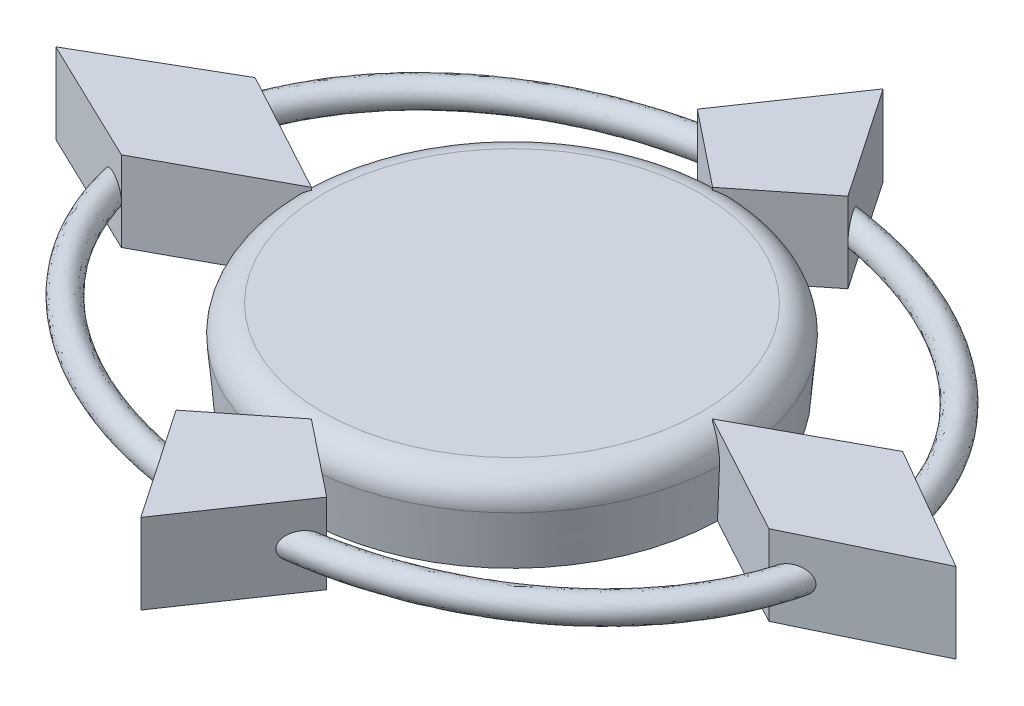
ISO-10303-21;
HEADER;
FILE_DESCRIPTION(('STEP AP214'),'2;1');
FILE_NAME('part.step','',(''),(''),'','','');
FILE_SCHEMA(('AUTOMOTIVE_DESIGN { 1 0 10303 214 1 1 1 1 }'));
ENDSEC;
DATA;
#1=APPLICATION_CONTEXT('core data for automotive mechanical design processes');
#2=APPLICATION_PROTOCOL_DEFINITION('international standard','automotive_design',2000,#1);
#3=PRODUCT_CONTEXT('',#1,'mechanical');
#4=PRODUCT('Part','Part','',(#3));
#5=PRODUCT_RELATED_PRODUCT_CATEGORY('part','',(#4));
#6=PRODUCT_DEFINITION_FORMATION('','',#4);
#7=PRODUCT_DEFINITION_CONTEXT('part definition',#1,'design');
#8=PRODUCT_DEFINITION('design','',#6,#7);
#9=PRODUCT_DEFINITION_SHAPE('','',#8);
#10=(LENGTH_UNIT() NAMED_UNIT(*) SI_UNIT(.MILLI.,.METRE.));
#11=(NAMED_UNIT(*) PLANE_ANGLE_UNIT() SI_UNIT($,.RADIAN.));
#12=(NAMED_UNIT(*) SI_UNIT($,.STERADIAN.) SOLID_ANGLE_UNIT());
#13=UNCERTAINTY_MEASURE_WITH_UNIT(LENGTH_MEASURE(1.E-05),#10,'distance_accuracy_value','');
#14=(GEOMETRIC_REPRESENTATION_CONTEXT(3) GLOBAL_UNCERTAINTY_ASSIGNED_CONTEXT((#13)) GLOBAL_UNIT_ASSIGNED_CONTEXT((#10,
#11,#12)) REPRESENTATION_CONTEXT('',''));
#15=CARTESIAN_POINT('',(0.,0.,0.));
#16=DIRECTION('',(0.,0.,1.));
#17=DIRECTION('',(1.,0.,0.));
#18=AXIS2_PLACEMENT_3D('',#15,#16,#17);
#19=CARTESIAN_POINT('',(37.5,15.,0.));
#20=DIRECTION('',(0.4772671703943,0.,0.878758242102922));
#21=DIRECTION('',(0.878758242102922,0.,-0.4772671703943));
#22=AXIS2_PLACEMENT_3D('',#19,#20,#21);
#23=PLANE('',#22);
#24=CARTESIAN_POINT('',(60.5153647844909,7.37367280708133,-12.5));
#25=CARTESIAN_POINT('',(60.513461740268,7.41578187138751,-12.4989664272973));
#26=CARTESIAN_POINT('',(60.5125102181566,7.4578909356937,-12.4984496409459));
#27=CARTESIAN_POINT('',(60.5125102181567,7.54210906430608,-12.4984496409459));
#28=CARTESIAN_POINT('',(60.5134617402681,7.58421812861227,-12.4989664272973));
#29=CARTESIAN_POINT('',(60.515364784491,7.62632719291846,-12.5000000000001));
#30=B_SPLINE_CURVE_WITH_KNOTS('',3,(#24,#25,#26,#27,#28,#29),.UNSPECIFIED.,.F.,.F.,(4,2,4),(0.,
0.126368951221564,0.252737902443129),.UNSPECIFIED.);
#31=CARTESIAN_POINT('',(60.5153647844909,7.37367280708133,-12.5));
#32=VERTEX_POINT('',#31);
#33=CARTESIAN_POINT('',(60.5153647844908,7.62632719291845,-12.5));
#34=VERTEX_POINT('',#33);
#35=EDGE_CURVE('E484',#32,#34,#30,.T.);
#36=ORIENTED_EDGE('',*,*,#35,.F.);
#37=DIRECTION('',(0.,-1.,0.));
#38=VECTOR('',#37,1.);
#39=CARTESIAN_POINT('',(60.5153647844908,15.,-12.5));
#40=LINE('',#39,#38);
#41=CARTESIAN_POINT('',(60.5153647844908,0.,-12.5));
#42=VERTEX_POINT('',#41);
#43=EDGE_CURVE('E506',#32,#42,#40,.T.);
#44=ORIENTED_EDGE('',*,*,#43,.T.);
#45=DIRECTION('',(-0.878758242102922,0.,0.4772671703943));
#46=VECTOR('',#45,1.);
#47=CARTESIAN_POINT('',(37.5,0.,0.));
#48=LINE('',#47,#46);
#49=CARTESIAN_POINT('',(39.485280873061,0.,-1.07823669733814));
#50=VERTEX_POINT('',#49);
#51=EDGE_CURVE('E824',#42,#50,#48,.T.);
#52=ORIENTED_EDGE('',*,*,#51,.T.);
#53=CARTESIAN_POINT('',(39.4852636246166,-0.0002,-1.07822732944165));
#54=CARTESIAN_POINT('',(39.6227344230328,1.59386364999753,-1.15288984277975));
#55=CARTESIAN_POINT('',(39.7600261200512,3.18794724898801,-1.22745508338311));
#56=CARTESIAN_POINT('',(40.0342513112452,6.37615434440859,-1.37639101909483));
#57=CARTESIAN_POINT('',(40.1711848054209,7.97027784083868,-1.45076171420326));
#58=CARTESIAN_POINT('',(40.3079391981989,9.56442128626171,-1.52503513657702));
#59=B_SPLINE_CURVE_WITH_KNOTS('',3,(#53,#54,#55,#56,#57,#58),.UNSPECIFIED.,.F.,.F.,(4,2,4),(0.,
4.80516425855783,9.61032851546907),.UNSPECIFIED.);
#60=CARTESIAN_POINT('',(40.3079220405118,9.56422128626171,-1.52502581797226));
#61=VERTEX_POINT('',#60);
#62=EDGE_CURVE('E562',#50,#61,#59,.T.);
#63=ORIENTED_EDGE('',*,*,#62,.T.);
#64=CARTESIAN_POINT('',(37.4998,14.5169912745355,0.000108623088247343));
#65=CARTESIAN_POINT('',(37.6247957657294,14.457672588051,-0.067778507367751));
#66=CARTESIAN_POINT('',(37.7477966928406,14.39283389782,-0.13458221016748));
#67=CARTESIAN_POINT('',(37.9889541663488,14.2522214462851,-0.265558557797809));
#68=CARTESIAN_POINT('',(38.1071080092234,14.1764416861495,-0.329729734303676));
#69=CARTESIAN_POINT('',(38.338137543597,14.0137228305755,-0.455205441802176));
#70=CARTESIAN_POINT('',(38.4509847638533,13.9267312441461,-0.516494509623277));
#71=CARTESIAN_POINT('',(38.669772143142,13.7421711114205,-0.63532131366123));
#72=CARTESIAN_POINT('',(38.7757134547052,13.6446043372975,-0.692859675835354));
#73=CARTESIAN_POINT('',(38.9800651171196,13.4389021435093,-0.803846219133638));
#74=CARTESIAN_POINT('',(39.0784463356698,13.3307291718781,-0.857278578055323));
#75=CARTESIAN_POINT('',(39.2661888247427,13.1046805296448,-0.959244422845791));
#76=CARTESIAN_POINT('',(39.3555507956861,12.9868056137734,-1.00777828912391));
#77=CARTESIAN_POINT('',(39.5240566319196,12.742312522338,-1.0992964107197));
#78=CARTESIAN_POINT('',(39.6032203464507,12.6157120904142,-1.14229144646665));
#79=CARTESIAN_POINT('',(39.7505318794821,12.3544725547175,-1.22229861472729));
#80=CARTESIAN_POINT('',(39.818681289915,12.2198346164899,-1.25931161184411));
#81=CARTESIAN_POINT('',(39.9374111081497,11.9561290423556,-1.3237956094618));
#82=CARTESIAN_POINT('',(39.9890240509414,11.8276625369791,-1.35182739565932));
#83=CARTESIAN_POINT('',(40.0817715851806,11.5659284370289,-1.40220001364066));
#84=CARTESIAN_POINT('',(40.1229074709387,11.432661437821,-1.42454154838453));
#85=CARTESIAN_POINT('',(40.1941726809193,11.1624412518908,-1.46324678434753));
#86=CARTESIAN_POINT('',(40.2243078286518,11.0254900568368,-1.4796136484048));
#87=CARTESIAN_POINT('',(40.2732054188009,10.7490379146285,-1.50617068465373));
#88=CARTESIAN_POINT('',(40.2919723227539,10.6095379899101,-1.51636327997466));
#89=CARTESIAN_POINT('',(40.318836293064,10.3189020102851,-1.5309535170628));
#90=CARTESIAN_POINT('',(40.326054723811,10.167659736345,-1.53487395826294));
#91=CARTESIAN_POINT('',(40.3270472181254,9.86536904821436,-1.53541299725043));
#92=CARTESIAN_POINT('',(40.3208434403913,9.71432072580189,-1.5320436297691));
#93=CARTESIAN_POINT('',(40.3079048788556,9.56402128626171,-1.52501649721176));
#94=B_SPLINE_CURVE_WITH_KNOTS('',3,(#64,#65,#66,#67,#68,#69,#70,#71,#72,#73,#74,#75,#76,#77,#78,
#79,#80,#81,#82,#83,#84,#85,#86,#87,#88,#89,#90,#91,#92,#93),.UNSPECIFIED.,.F.,.F.,(4,2,2,2,2,2,
2,2,2,2,2,2,2,2,4),(0.,0.462273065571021,0.924800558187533,1.38957799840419,1.85427767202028,
2.32068652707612,2.78705913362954,3.25250984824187,3.71789322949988,4.14109697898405,
4.56424842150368,4.98717553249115,5.40993655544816,5.86355057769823,6.31641630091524),.UNSPECIFIED.);
#95=CARTESIAN_POINT('',(37.5,14.5168963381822,0.));
#96=VERTEX_POINT('',#95);
#97=EDGE_CURVE('E48',#96,#61,#94,.T.);
#98=ORIENTED_EDGE('',*,*,#97,.F.);
#99=DIRECTION('',(0.,-1.,0.));
#100=VECTOR('',#99,1.);
#101=CARTESIAN_POINT('',(37.5,15.,0.));
#102=LINE('',#101,#100);
#103=CARTESIAN_POINT('',(37.5,15.,0.));
#104=VERTEX_POINT('',#103);
#105=EDGE_CURVE('E519',#104,#96,#102,.T.);
#106=ORIENTED_EDGE('',*,*,#105,.F.);
#107=DIRECTION('',(-0.878758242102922,0.,0.4772671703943));
#108=VECTOR('',#107,1.);
#109=CARTESIAN_POINT('',(37.5,15.,0.));
#110=LINE('',#109,#108);
#111=CARTESIAN_POINT('',(60.5153647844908,15.,-12.5));
#112=VERTEX_POINT('',#111);
#113=EDGE_CURVE('E1180',#112,#104,#110,.T.);
#114=ORIENTED_EDGE('',*,*,#113,.F.);
#115=EDGE_CURVE('E502',#112,#34,#40,.T.);
#116=ORIENTED_EDGE('',*,*,#115,.T.);
#117=EDGE_LOOP('',(#36,#44,#52,#63,#98,#106,#114,#116));
#118=FACE_BOUND('',#117,.T.);
#119=ADVANCED_FACE('F37',(#118),#23,.F.);
#120=CARTESIAN_POINT('',(60.5153647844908,15.,12.5));
#121=DIRECTION('',(0.4772671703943,0.,-0.878758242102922));
#122=DIRECTION('',(-0.878758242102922,0.,-0.4772671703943));
#123=AXIS2_PLACEMENT_3D('',#120,#121,#122);
#124=PLANE('',#123);
#125=CARTESIAN_POINT('',(60.5153647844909,7.62632719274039,12.5));
#126=CARTESIAN_POINT('',(60.5134617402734,7.58421812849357,12.4989664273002));
#127=CARTESIAN_POINT('',(60.5125102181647,7.54210906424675,12.4984496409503));
#128=CARTESIAN_POINT('',(60.5125102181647,7.45789093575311,12.4984496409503));
#129=CARTESIAN_POINT('',(60.5134617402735,7.41578187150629,12.4989664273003));
#130=CARTESIAN_POINT('',(60.515364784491,7.37367280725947,12.5000000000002));
#131=B_SPLINE_CURVE_WITH_KNOTS('',3,(#125,#126,#127,#128,#129,#130),.UNSPECIFIED.,.F.,.F.,(4,2,
4),(0.,0.12636895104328,0.252737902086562),.UNSPECIFIED.);
#132=CARTESIAN_POINT('',(60.5153647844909,7.62632719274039,12.5));
#133=VERTEX_POINT('',#132);
#134=CARTESIAN_POINT('',(60.5153647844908,7.37367280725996,12.5));
#135=VERTEX_POINT('',#134);
#136=EDGE_CURVE('E42',#133,#135,#131,.T.);
#137=ORIENTED_EDGE('',*,*,#136,.F.);
#138=DIRECTION('',(0.,-1.,0.));
#139=VECTOR('',#138,1.);
#140=CARTESIAN_POINT('',(60.5153647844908,15.,12.5));
#141=LINE('',#140,#139);
#142=CARTESIAN_POINT('',(60.5153647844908,15.,12.5));
#143=VERTEX_POINT('',#142);
#144=EDGE_CURVE('E525',#143,#133,#141,.T.);
#145=ORIENTED_EDGE('',*,*,#144,.F.);
#146=DIRECTION('',(0.878758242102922,0.,0.4772671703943));
#147=VECTOR('',#146,1.);
#148=CARTESIAN_POINT('',(60.5153647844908,15.,12.5));
#149=LINE('',#148,#147);
#150=EDGE_CURVE('E1179',#104,#143,#149,.T.);
#151=ORIENTED_EDGE('',*,*,#150,.F.);
#152=ORIENTED_EDGE('',*,*,#105,.T.);
#153=CARTESIAN_POINT('',(40.3079048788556,9.56402128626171,1.52501649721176));
#154=CARTESIAN_POINT('',(40.3188788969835,9.69165486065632,1.53097665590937));
#155=CARTESIAN_POINT('',(40.3250122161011,9.81982441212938,1.53430775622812));
#156=CARTESIAN_POINT('',(40.3276139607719,10.076272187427,1.53572080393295));
#157=CARTESIAN_POINT('',(40.3240837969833,10.2045503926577,1.53380351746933));
#158=CARTESIAN_POINT('',(40.3073976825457,10.4599928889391,1.5247410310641));
#159=CARTESIAN_POINT('',(40.2942641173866,10.5871590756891,1.51760798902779));
#160=CARTESIAN_POINT('',(40.2585476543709,10.839758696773,1.49820982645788));
#161=CARTESIAN_POINT('',(40.2359647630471,10.9651921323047,1.4859447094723));
#162=CARTESIAN_POINT('',(40.1815980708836,11.2134167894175,1.45641731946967));
#163=CARTESIAN_POINT('',(40.1498163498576,11.3362086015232,1.4391561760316));
#164=CARTESIAN_POINT('',(40.0773720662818,11.5783969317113,1.39981056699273));
#165=CARTESIAN_POINT('',(40.0367061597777,11.6977921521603,1.37772428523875));
#166=CARTESIAN_POINT('',(39.9469293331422,11.9323258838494,1.32896510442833));
#167=CARTESIAN_POINT('',(39.8978228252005,12.0474665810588,1.30229460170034));
#168=CARTESIAN_POINT('',(39.7916256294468,12.2728938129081,1.24461726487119));
#169=CARTESIAN_POINT('',(39.7345320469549,12.3831785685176,1.21360885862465));
#170=CARTESIAN_POINT('',(39.5489067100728,12.7113231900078,1.11279287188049));
#171=CARTESIAN_POINT('',(39.4083170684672,12.9205312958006,1.03643646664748));
#172=CARTESIAN_POINT('',(39.1003635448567,13.3119649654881,0.86918215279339));
#173=CARTESIAN_POINT('',(38.9329621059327,13.4941519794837,0.778263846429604));
#174=CARTESIAN_POINT('',(38.6603494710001,13.7500847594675,0.630203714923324));
#175=CARTESIAN_POINT('',(38.5627887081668,13.834618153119,0.577216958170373));
#176=CARTESIAN_POINT('',(38.3622931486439,13.9950680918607,0.468324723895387));
#177=CARTESIAN_POINT('',(38.259357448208,14.070983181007,0.412418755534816));
#178=CARTESIAN_POINT('',(38.0491819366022,14.2137577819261,0.298269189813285));
#179=CARTESIAN_POINT('',(37.9419559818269,14.2806438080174,0.240033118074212));
#180=CARTESIAN_POINT('',(37.7236278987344,14.4055083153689,0.121455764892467));
#181=CARTESIAN_POINT('',(37.6125275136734,14.4634907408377,0.0611154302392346));
#182=CARTESIAN_POINT('',(37.4998,14.5169912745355,-0.000108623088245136));
#183=B_SPLINE_CURVE_WITH_KNOTS('',3,(#153,#154,#155,#156,#157,#158,#159,#160,#161,#162,#163,
#164,#165,#166,#167,#168,#169,#170,#171,#172,#173,#174,#175,#176,#177,#178,#179,#180,#181,#182),
.UNSPECIFIED.,.F.,.F.,(4,2,2,2,2,2,2,2,2,2,2,2,2,2,4),(0.,0.384607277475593,0.769158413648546,
1.1528160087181,1.53647333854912,1.92004399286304,2.30375927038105,2.68727457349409,
3.07092923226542,3.85747288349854,4.64512808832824,5.06340731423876,5.48175709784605,
5.89885033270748,6.31575826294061),.UNSPECIFIED.);
#184=CARTESIAN_POINT('',(40.3079220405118,9.56422128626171,1.52502581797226));
#185=VERTEX_POINT('',#184);
#186=EDGE_CURVE('E548',#185,#96,#183,.T.);
#187=ORIENTED_EDGE('',*,*,#186,.F.);
#188=CARTESIAN_POINT('',(40.3079391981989,9.56442128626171,1.52503513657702));
#189=CARTESIAN_POINT('',(40.1711848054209,7.97027784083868,1.45076171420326));
#190=CARTESIAN_POINT('',(40.0342513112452,6.37615434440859,1.37639101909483));
#191=CARTESIAN_POINT('',(39.7600261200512,3.18794724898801,1.22745508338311));
#192=CARTESIAN_POINT('',(39.6227344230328,1.59386364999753,1.15288984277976));
#193=CARTESIAN_POINT('',(39.4852636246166,-0.000200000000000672,1.07822732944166));
#194=B_SPLINE_CURVE_WITH_KNOTS('',3,(#188,#189,#190,#191,#192,#193),.UNSPECIFIED.,.F.,.F.,(4,2,
4),(0.,4.80516425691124,9.61032851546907),.UNSPECIFIED.);
#195=CARTESIAN_POINT('',(39.485280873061,0.,1.07823669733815));
#196=VERTEX_POINT('',#195);
#197=EDGE_CURVE('E555',#185,#196,#194,.T.);
#198=ORIENTED_EDGE('',*,*,#197,.T.);
#199=DIRECTION('',(0.878758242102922,0.,0.4772671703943));
#200=VECTOR('',#199,1.);
#201=CARTESIAN_POINT('',(60.5153647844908,0.,12.5));
#202=LINE('',#201,#200);
#203=CARTESIAN_POINT('',(60.5153647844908,0.,12.5));
#204=VERTEX_POINT('',#203);
#205=EDGE_CURVE('E1169',#196,#204,#202,.T.);
#206=ORIENTED_EDGE('',*,*,#205,.T.);
#207=EDGE_CURVE('E516',#135,#204,#141,.T.);
#208=ORIENTED_EDGE('',*,*,#207,.F.);
#209=EDGE_LOOP('',(#137,#145,#151,#152,#187,#198,#206,#208));
#210=FACE_BOUND('',#209,.T.);
#211=ADVANCED_FACE('F532',(#210),#124,.F.);
#212=CARTESIAN_POINT('',(84.1167789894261,15.,1.14525369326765));
#213=DIRECTION('',(-0.433539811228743,0.,-0.901134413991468));
#214=DIRECTION('',(-0.901134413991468,0.,0.433539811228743));
#215=AXIS2_PLACEMENT_3D('',#212,#213,#214);
#216=PLANE('',#215);
#217=CARTESIAN_POINT('',(60.5153647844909,7.37367280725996,12.5));
#218=CARTESIAN_POINT('',(60.519040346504,7.31493535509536,12.498231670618));
#219=CARTESIAN_POINT('',(60.5253207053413,7.25641719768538,12.4952101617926));
#220=CARTESIAN_POINT('',(60.5428579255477,7.14036346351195,12.4867729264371));
#221=CARTESIAN_POINT('',(60.5541098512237,7.08282697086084,12.4813595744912));
#222=CARTESIAN_POINT('',(60.5812434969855,6.9696701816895,12.4683054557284));
#223=CARTESIAN_POINT('',(60.5970829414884,6.91403735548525,12.4606850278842));
#224=CARTESIAN_POINT('',(60.6331059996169,6.804538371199,12.4433541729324));
#225=CARTESIAN_POINT('',(60.6532905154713,6.75067258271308,12.4336433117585));
#226=CARTESIAN_POINT('',(60.7196702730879,6.59262807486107,12.4017077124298));
#227=CARTESIAN_POINT('',(60.7718246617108,6.49146823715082,12.3766160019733));
#228=CARTESIAN_POINT('',(60.8891491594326,6.29878624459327,12.3201706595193));
#229=CARTESIAN_POINT('',(60.9543521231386,6.20728932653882,12.288801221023));
#230=CARTESIAN_POINT('',(61.1259468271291,5.99674422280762,12.2062462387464));
#231=CARTESIAN_POINT('',(61.237858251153,5.88322194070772,12.1524051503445));
#232=CARTESIAN_POINT('',(61.4766111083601,5.67759473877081,12.0375400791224));
#233=CARTESIAN_POINT('',(61.6034795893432,5.5855295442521,11.9765030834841));
#234=CARTESIAN_POINT('',(61.9086351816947,5.39666330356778,11.8296913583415));
#235=CARTESIAN_POINT('',(62.0906498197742,5.30728031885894,11.7421232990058));
#236=CARTESIAN_POINT('',(62.4651713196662,5.16246168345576,11.561939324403));
#237=CARTESIAN_POINT('',(62.6576831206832,5.10704216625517,11.4693210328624));
#238=CARTESIAN_POINT('',(63.0507630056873,5.0287790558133,11.2802085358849));
#239=CARTESIAN_POINT('',(63.2514063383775,5.0064048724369,11.183678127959));
#240=CARTESIAN_POINT('',(63.6536916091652,4.99596528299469,10.9901368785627));
#241=CARTESIAN_POINT('',(63.8553342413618,5.00792854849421,10.8931257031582));
#242=CARTESIAN_POINT('',(64.1635074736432,5.05388495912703,10.7448621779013));
#243=CARTESIAN_POINT('',(64.2716237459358,5.07539823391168,10.692846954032));
#244=CARTESIAN_POINT('',(64.485628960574,5.12928235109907,10.5898880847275));
#245=CARTESIAN_POINT('',(64.5915171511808,5.16165679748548,10.5389448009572));
#246=CARTESIAN_POINT('',(64.9039229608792,5.27557615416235,10.3886449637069));
#247=CARTESIAN_POINT('',(65.1059578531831,5.37402498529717,10.2914450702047));
#248=CARTESIAN_POINT('',(65.3556587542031,5.53468400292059,10.171312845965));
#249=CARTESIAN_POINT('',(65.4147523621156,5.57591459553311,10.1428826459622));
#250=CARTESIAN_POINT('',(65.5299622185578,5.66320935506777,10.0874546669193));
#251=CARTESIAN_POINT('',(65.58607996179,5.70927106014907,10.060456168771));
#252=CARTESIAN_POINT('',(65.6947197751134,5.80615759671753,10.0081890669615));
#253=CARTESIAN_POINT('',(65.7472478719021,5.85697408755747,9.98291756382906));
#254=CARTESIAN_POINT('',(65.8482868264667,5.96343546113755,9.93430726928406));
#255=CARTESIAN_POINT('',(65.8967926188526,6.01908625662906,9.91097091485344));
#256=CARTESIAN_POINT('',(66.0195713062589,6.1733595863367,9.85190153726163));
#257=CARTESIAN_POINT('',(66.0897287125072,6.27610783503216,9.81814849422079));
#258=CARTESIAN_POINT('',(66.213748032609,6.49305824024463,9.75848224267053));
#259=CARTESIAN_POINT('',(66.2676316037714,6.60724490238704,9.73255861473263));
#260=CARTESIAN_POINT('',(66.3341237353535,6.78553649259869,9.70056895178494));
#261=CARTESIAN_POINT('',(66.3539519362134,6.84640816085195,9.69102951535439));
#262=CARTESIAN_POINT('',(66.3883784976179,6.96992795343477,9.67446674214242));
#263=CARTESIAN_POINT('',(66.4029798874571,7.03257502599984,9.66744194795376));
#264=CARTESIAN_POINT('',(66.4266826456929,7.15912276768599,9.65603844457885));
#265=CARTESIAN_POINT('',(66.4357856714,7.22302305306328,9.6516589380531));
#266=CARTESIAN_POINT('',(66.4483310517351,7.35149095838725,9.64562329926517));
#267=CARTESIAN_POINT('',(66.4517733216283,7.41605858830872,9.64396720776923));
#268=CARTESIAN_POINT('',(66.4533355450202,7.59477383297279,9.64321561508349));
#269=CARTESIAN_POINT('',(66.4453684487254,7.70905901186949,9.64704862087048));
#270=CARTESIAN_POINT('',(66.4119614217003,7.93434008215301,9.66312089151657));
#271=CARTESIAN_POINT('',(66.3865229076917,8.04533623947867,9.67535947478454));
#272=CARTESIAN_POINT('',(66.3201184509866,8.25971432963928,9.70730695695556));
#273=CARTESIAN_POINT('',(66.2793681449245,8.3631792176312,9.72691211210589));
#274=CARTESIAN_POINT('',(66.184296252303,8.56206307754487,9.77265162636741));
#275=CARTESIAN_POINT('',(66.1299716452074,8.65748025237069,9.79878743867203));
#276=CARTESIAN_POINT('',(66.0033706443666,8.84884633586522,9.85969574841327));
#277=CARTESIAN_POINT('',(65.929784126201,8.94372348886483,9.89509855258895));
#278=CARTESIAN_POINT('',(65.7712741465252,9.12125318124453,9.97135841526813));
#279=CARTESIAN_POINT('',(65.6863248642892,9.20387694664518,10.0122278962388));
#280=CARTESIAN_POINT('',(65.4659904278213,9.39204408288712,10.118231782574));
#281=CARTESIAN_POINT('',(65.325550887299,9.49032295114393,10.185797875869));
#282=CARTESIAN_POINT('',(65.0322780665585,9.66010945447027,10.3268927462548));
#283=CARTESIAN_POINT('',(64.8794416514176,9.73161029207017,10.400423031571));
#284=CARTESIAN_POINT('',(64.6432962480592,9.82014052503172,10.5140336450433));
#285=CARTESIAN_POINT('',(64.5627576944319,9.84666567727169,10.5527811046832));
#286=CARTESIAN_POINT('',(64.4002748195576,9.89325875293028,10.6309523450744));
#287=CARTESIAN_POINT('',(64.3183322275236,9.91333409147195,10.6703752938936));
#288=CARTESIAN_POINT('',(64.0709470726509,9.96414226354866,10.789393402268));
#289=CARTESIAN_POINT('',(63.9038843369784,9.98548029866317,10.8697680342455));
#290=CARTESIAN_POINT('',(63.5324185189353,10.0059479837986,11.0484819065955));
#291=CARTESIAN_POINT('',(63.3277610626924,9.99927007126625,11.1469435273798));
#292=CARTESIAN_POINT('',(62.9213372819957,9.95075743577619,11.3424758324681));
#293=CARTESIAN_POINT('',(62.7195777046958,9.90885104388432,11.439543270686));
#294=CARTESIAN_POINT('',(62.416201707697,9.81707007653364,11.5854988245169));
#295=CARTESIAN_POINT('',(62.311399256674,9.77982998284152,11.6359197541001));
#296=CARTESIAN_POINT('',(62.1053116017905,9.69486735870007,11.7350694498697));
#297=CARTESIAN_POINT('',(62.0040274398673,9.64714175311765,11.7837977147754));
#298=CARTESIAN_POINT('',(61.7076664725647,9.48802605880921,11.9263783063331));
#299=CARTESIAN_POINT('',(61.519114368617,9.36041602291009,12.0170915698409));
#300=CARTESIAN_POINT('',(61.24727009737,9.12400667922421,12.1478770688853));
#301=CARTESIAN_POINT('',(61.1532482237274,9.03017834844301,12.1931114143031));
#302=CARTESIAN_POINT('',(60.9793913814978,8.82742705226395,12.2767547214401));
#303=CARTESIAN_POINT('',(60.8995374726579,8.7185245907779,12.3151727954));
#304=CARTESIAN_POINT('',(60.7710550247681,8.50705771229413,12.3769862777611));
#305=CARTESIAN_POINT('',(60.7194034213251,8.40676104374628,12.4018360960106));
#306=CARTESIAN_POINT('',(60.6317969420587,8.19812866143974,12.4439839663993));
#307=CARTESIAN_POINT('',(60.5958059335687,8.08981213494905,12.4612994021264));
#308=CARTESIAN_POINT('',(60.5549415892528,7.92124995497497,12.4809594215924));
#309=CARTESIAN_POINT('',(60.5434261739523,7.86292002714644,12.4864995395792));
#310=CARTESIAN_POINT('',(60.5255036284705,7.74525288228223,12.495122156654));
#311=CARTESIAN_POINT('',(60.5191008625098,7.68591484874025,12.4982025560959));
#312=CARTESIAN_POINT('',(60.5153647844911,7.62632719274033,12.4999999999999));
#313=B_SPLINE_CURVE_WITH_KNOTS('',3,(#217,#218,#219,#220,#221,#222,#223,#224,#225,#226,#227,
#228,#229,#230,#231,#232,#233,#234,#235,#236,#237,#238,#239,#240,#241,#242,#243,#244,#245,#246,
#247,#248,#249,#250,#251,#252,#253,#254,#255,#256,#257,#258,#259,#260,#261,#262,#263,#264,#265,
#266,#267,#268,#269,#270,#271,#272,#273,#274,#275,#276,#277,#278,#279,#280,#281,#282,#283,#284,
#285,#286,#287,#288,#289,#290,#291,#292,#293,#294,#295,#296,#297,#298,#299,#300,#301,#302,#303,
#304,#305,#306,#307,#308,#309,#310,#311,#312),.UNSPECIFIED.,.F.,.F.,(4,2,2,2,2,2,2,2,2,2,2,2,2,
2,2,2,2,2,2,2,2,2,2,2,2,2,2,2,2,2,2,2,2,2,2,2,2,2,2,2,2,2,2,2,2,2,2,4),(0.,0.176538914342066,
0.352902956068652,0.527690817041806,0.702515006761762,1.05052313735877,1.39941878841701,
1.90139718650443,2.4042976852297,3.06346876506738,3.72295272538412,4.39171746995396,
5.06104079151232,5.42623731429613,5.79155513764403,6.51962291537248,6.75186624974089,
6.98399180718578,7.21571755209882,7.44773081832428,7.83282827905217,8.21741096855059,
8.41134991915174,8.60517628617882,8.79894420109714,8.99271501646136,9.33473835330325,
9.67673395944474,10.0140835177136,10.3515082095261,10.7256465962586,11.1006500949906,
11.6504245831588,12.2003385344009,12.4798190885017,12.758977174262,13.3170751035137,
13.9959885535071,14.6762865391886,15.0421628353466,15.408146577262,16.1368337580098,
16.5565127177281,16.9756263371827,17.3208466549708,17.6652661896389,17.8441575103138,
18.0232013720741),.UNSPECIFIED.);
#314=EDGE_CURVE('E56',#135,#133,#313,.T.);
#315=ORIENTED_EDGE('',*,*,#314,.F.);
#316=ORIENTED_EDGE('',*,*,#207,.T.);
#317=DIRECTION('',(0.901134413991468,0.,-0.433539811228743));
#318=VECTOR('',#317,1.);
#319=CARTESIAN_POINT('',(84.1167789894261,0.,1.14525369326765));
#320=LINE('',#319,#318);
#321=CARTESIAN_POINT('',(84.1167789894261,0.,1.14525369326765));
#322=VERTEX_POINT('',#321);
#323=EDGE_CURVE('E1171',#204,#322,#320,.T.);
#324=ORIENTED_EDGE('',*,*,#323,.T.);
#325=DIRECTION('',(0.,-1.,0.));
#326=VECTOR('',#325,1.);
#327=CARTESIAN_POINT('',(84.1167789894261,15.,1.14525369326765));
#328=LINE('',#327,#326);
#329=CARTESIAN_POINT('',(84.1167789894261,15.,1.14525369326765));
#330=VERTEX_POINT('',#329);
#331=EDGE_CURVE('E505',#330,#322,#328,.T.);
#332=ORIENTED_EDGE('',*,*,#331,.F.);
#333=DIRECTION('',(0.901134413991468,0.,-0.433539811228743));
#334=VECTOR('',#333,1.);
#335=CARTESIAN_POINT('',(84.1167789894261,15.,1.14525369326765));
#336=LINE('',#335,#334);
#337=EDGE_CURVE('E1177',#143,#330,#336,.T.);
#338=ORIENTED_EDGE('',*,*,#337,.F.);
#339=ORIENTED_EDGE('',*,*,#144,.T.);
#340=EDGE_LOOP('',(#315,#316,#324,#332,#338,#339));
#341=FACE_BOUND('',#340,.T.);
#342=ADVANCED_FACE('F540',(#341),#216,.F.);
#343=CARTESIAN_POINT('',(60.5153647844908,15.,-12.5));
#344=DIRECTION('',(-0.500521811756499,0.,0.865723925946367));
#345=DIRECTION('',(0.865723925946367,0.,0.5005218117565));
#346=AXIS2_PLACEMENT_3D('',#343,#344,#345);
#347=PLANE('',#346);
#348=CARTESIAN_POINT('',(60.5153647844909,7.62632719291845,-12.5));
#349=CARTESIAN_POINT('',(60.5190482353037,7.68304479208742,-12.4978703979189));
#350=CARTESIAN_POINT('',(60.5252565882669,7.73951995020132,-12.4942810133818));
#351=CARTESIAN_POINT('',(60.5424537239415,7.85141900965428,-12.4843384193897));
#352=CARTESIAN_POINT('',(60.5534363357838,7.90684417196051,-12.4779887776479));
#353=CARTESIAN_POINT('',(60.5797827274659,8.01564447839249,-12.4627565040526));
#354=CARTESIAN_POINT('',(60.5950987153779,8.06903514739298,-12.4539015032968));
#355=CARTESIAN_POINT('',(60.6298019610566,8.17401755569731,-12.4338376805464));
#356=CARTESIAN_POINT('',(60.6491903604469,8.22560878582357,-12.4226281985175));
#357=CARTESIAN_POINT('',(60.7126787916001,8.37671165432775,-12.3859221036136));
#358=CARTESIAN_POINT('',(60.7622662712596,8.47320113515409,-12.3572529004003));
#359=CARTESIAN_POINT('',(60.8731497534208,8.65692380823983,-12.2931451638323));
#360=CARTESIAN_POINT('',(60.934481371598,8.74412755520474,-12.2576860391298));
#361=CARTESIAN_POINT('',(61.101435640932,8.95297928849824,-12.161160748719));
#362=CARTESIAN_POINT('',(61.2131954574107,9.06808430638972,-12.0965463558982));
#363=CARTESIAN_POINT('',(61.4509932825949,9.27653575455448,-11.9590625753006));
#364=CARTESIAN_POINT('',(61.5770602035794,9.36983691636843,-11.886176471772));
#365=CARTESIAN_POINT('',(61.7997673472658,9.51130321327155,-11.7574174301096));
#366=CARTESIAN_POINT('',(61.8940014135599,9.56463792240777,-11.7029356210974));
#367=CARTESIAN_POINT('',(62.0861319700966,9.66174063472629,-11.5918545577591));
#368=CARTESIAN_POINT('',(62.1840298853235,9.70550486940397,-11.5352544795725));
#369=CARTESIAN_POINT('',(62.382603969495,9.78381091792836,-11.4204480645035));
#370=CARTESIAN_POINT('',(62.4832816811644,9.81834749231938,-11.3622408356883));
#371=CARTESIAN_POINT('',(62.686583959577,9.87839341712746,-11.2447007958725));
#372=CARTESIAN_POINT('',(62.7892083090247,9.90390376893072,-11.185368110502));
#373=CARTESIAN_POINT('',(63.1039691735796,9.96810673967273,-11.0033878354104));
#374=CARTESIAN_POINT('',(63.3184412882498,9.99270302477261,-10.8793899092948));
#375=CARTESIAN_POINT('',(63.6404313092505,10.0015573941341,-10.6932300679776));
#376=CARTESIAN_POINT('',(63.7478340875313,9.99983172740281,-10.6311347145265));
#377=CARTESIAN_POINT('',(63.9622084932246,9.9868475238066,-10.5071932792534));
#378=CARTESIAN_POINT('',(64.0691801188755,9.97558894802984,-10.4453471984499));
#379=CARTESIAN_POINT('',(64.3693518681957,9.92998386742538,-10.2718016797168));
#380=CARTESIAN_POINT('',(64.5614311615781,9.88428070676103,-10.1607502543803));
#381=CARTESIAN_POINT('',(64.8426490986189,9.78968248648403,-9.99816295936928));
#382=CARTESIAN_POINT('',(64.935195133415,9.75383279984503,-9.94465709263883));
#383=CARTESIAN_POINT('',(65.1174210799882,9.67300367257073,-9.83930241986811));
#384=CARTESIAN_POINT('',(65.2070969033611,9.62801182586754,-9.78745597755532));
#385=CARTESIAN_POINT('',(65.423754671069,9.50510945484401,-9.66219440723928));
#386=CARTESIAN_POINT('',(65.5484427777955,9.42166951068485,-9.59010547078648));
#387=CARTESIAN_POINT('',(65.7848340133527,9.23329409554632,-9.45343491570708));
#388=CARTESIAN_POINT('',(65.8965661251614,9.12840811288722,-9.38883654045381));
#389=CARTESIAN_POINT('',(66.0798467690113,8.92153352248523,-9.28287209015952));
#390=CARTESIAN_POINT('',(66.154885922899,8.82368243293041,-9.23948789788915));
#391=CARTESIAN_POINT('',(66.2902940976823,8.61502628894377,-9.16120111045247));
#392=CARTESIAN_POINT('',(66.3506683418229,8.50422586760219,-9.12629549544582));
#393=CARTESIAN_POINT('',(66.4276550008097,8.32942751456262,-9.08178534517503));
#394=CARTESIAN_POINT('',(66.451142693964,8.26938617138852,-9.06820583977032));
#395=CARTESIAN_POINT('',(66.4929896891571,8.14697769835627,-9.04401182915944));
#396=CARTESIAN_POINT('',(66.5113518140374,8.08461187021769,-9.03339569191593));
#397=CARTESIAN_POINT('',(66.5425504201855,7.95809867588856,-9.01535809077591));
#398=CARTESIAN_POINT('',(66.5553905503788,7.8939525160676,-9.00793451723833));
#399=CARTESIAN_POINT('',(66.5752735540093,7.76449701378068,-8.99643907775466));
#400=CARTESIAN_POINT('',(66.5823174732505,7.69918788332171,-8.99236660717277));
#401=CARTESIAN_POINT('',(66.5932307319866,7.52244074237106,-8.98605706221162));
#402=CARTESIAN_POINT('',(66.5914968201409,7.41047027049,-8.9870595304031));
#403=CARTESIAN_POINT('',(66.5709015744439,7.18874465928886,-8.99896675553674));
#404=CARTESIAN_POINT('',(66.5520427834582,7.07898919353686,-9.00987004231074));
#405=CARTESIAN_POINT('',(66.4997335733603,6.86970566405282,-9.04011282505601));
#406=CARTESIAN_POINT('',(66.4669877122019,6.76993945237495,-9.05904497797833));
#407=CARTESIAN_POINT('',(66.3888480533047,6.5773065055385,-9.10422173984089));
#408=CARTESIAN_POINT('',(66.3434518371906,6.48444109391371,-9.13046774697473));
#409=CARTESIAN_POINT('',(66.2365026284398,6.29728416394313,-9.19230086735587));
#410=CARTESIAN_POINT('',(66.173732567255,6.20392662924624,-9.22859163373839));
#411=CARTESIAN_POINT('',(66.0376291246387,6.02799915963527,-9.30728039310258));
#412=CARTESIAN_POINT('',(65.9642805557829,5.94544506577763,-9.34968716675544));
#413=CARTESIAN_POINT('',(65.8271579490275,5.80911244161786,-9.42896516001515));
#414=CARTESIAN_POINT('',(65.765042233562,5.75307518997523,-9.46487761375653));
#415=CARTESIAN_POINT('',(65.6368720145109,5.64755142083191,-9.53897974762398));
#416=CARTESIAN_POINT('',(65.5708208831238,5.59805940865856,-9.57716747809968));
#417=CARTESIAN_POINT('',(65.3675151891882,5.4588947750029,-9.69470949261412));
#418=CARTESIAN_POINT('',(65.2253282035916,5.37874568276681,-9.7769154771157));
#419=CARTESIAN_POINT('',(64.8855832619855,5.22039241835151,-9.9733403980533));
#420=CARTESIAN_POINT('',(64.6849439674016,5.15113296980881,-10.0893408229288));
#421=CARTESIAN_POINT('',(64.2767338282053,5.05090677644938,-10.325349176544));
#422=CARTESIAN_POINT('',(64.0691580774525,5.01996775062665,-10.4453599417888));
#423=CARTESIAN_POINT('',(63.6486521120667,4.99382675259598,-10.6884771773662));
#424=CARTESIAN_POINT('',(63.4356926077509,4.99927519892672,-10.8116005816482));
#425=CARTESIAN_POINT('',(63.0127939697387,5.04638327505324,-11.0561011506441));
#426=CARTESIAN_POINT('',(62.8028550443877,5.08804539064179,-11.1774781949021));
#427=CARTESIAN_POINT('',(62.4072611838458,5.20342994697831,-11.4061923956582));
#428=CARTESIAN_POINT('',(62.2210045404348,5.27433180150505,-11.5138774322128));
#429=CARTESIAN_POINT('',(61.950765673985,5.40534626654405,-11.670117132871));
#430=CARTESIAN_POINT('',(61.8622263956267,5.45311658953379,-11.7213064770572));
#431=CARTESIAN_POINT('',(61.6890415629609,5.5572533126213,-11.8214339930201));
#432=CARTESIAN_POINT('',(61.6043943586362,5.61361602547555,-11.870373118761));
#433=CARTESIAN_POINT('',(61.4115075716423,5.75651845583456,-11.9818913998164));
#434=CARTESIAN_POINT('',(61.3052752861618,5.84674261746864,-12.0433100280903));
#435=CARTESIAN_POINT('',(61.1056400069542,6.04457814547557,-12.1587299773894));
#436=CARTESIAN_POINT('',(61.01222229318,6.15216924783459,-12.2127398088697));
#437=CARTESIAN_POINT('',(60.8633269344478,6.35786384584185,-12.2988242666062));
#438=CARTESIAN_POINT('',(60.8040847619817,6.45230847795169,-12.3330753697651));
#439=CARTESIAN_POINT('',(60.6996102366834,6.65082810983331,-12.3934777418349));
#440=CARTESIAN_POINT('',(60.6543339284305,6.75487152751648,-12.4196544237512));
#441=CARTESIAN_POINT('',(60.5900480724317,6.94427235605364,-12.4568215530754));
#442=CARTESIAN_POINT('',(60.5673174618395,7.02793526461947,-12.4699633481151));
#443=CARTESIAN_POINT('',(60.5414605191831,7.15588203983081,-12.4849126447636));
#444=CARTESIAN_POINT('',(60.5342047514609,7.19908315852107,-12.4891075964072));
#445=CARTESIAN_POINT('',(60.5225866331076,7.28603072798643,-12.4958246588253));
#446=CARTESIAN_POINT('',(60.5182262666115,7.32977753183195,-12.4983456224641));
#447=CARTESIAN_POINT('',(60.5153647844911,7.37367280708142,-12.4999999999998));
#448=B_SPLINE_CURVE_WITH_KNOTS('',3,(#348,#349,#350,#351,#352,#353,#354,#355,#356,#357,#358,
#359,#360,#361,#362,#363,#364,#365,#366,#367,#368,#369,#370,#371,#372,#373,#374,#375,#376,#377,
#378,#379,#380,#381,#382,#383,#384,#385,#386,#387,#388,#389,#390,#391,#392,#393,#394,#395,#396,
#397,#398,#399,#400,#401,#402,#403,#404,#405,#406,#407,#408,#409,#410,#411,#412,#413,#414,#415,
#416,#417,#418,#419,#420,#421,#422,#423,#424,#425,#426,#427,#428,#429,#430,#431,#432,#433,#434,
#435,#436,#437,#438,#439,#440,#441,#442,#443,#444,#445,#446,#447),.UNSPECIFIED.,.F.,.F.,(4,2,2,
2,2,2,2,2,2,2,2,2,2,2,2,2,2,2,2,2,2,2,2,2,2,2,2,2,2,2,2,2,2,2,2,2,2,2,2,2,2,2,2,2,2,2,2,2,2,4),
(0.,0.170522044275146,0.34082433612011,0.509317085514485,0.677857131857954,1.01293673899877,
1.34904909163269,1.86504288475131,2.38209863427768,2.74529753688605,3.10863919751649,
3.47218672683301,3.83569391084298,4.57919161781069,4.95111894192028,5.32304778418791,
5.99954277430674,6.33746343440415,6.67584575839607,7.17339964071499,7.66981808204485,
8.06054589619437,8.45113433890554,8.64853720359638,8.84583113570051,9.04299449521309,
9.2401222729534,9.57417066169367,9.90816945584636,10.2269386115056,10.5457687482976,
10.8991149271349,11.2529735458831,11.5257334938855,11.7982629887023,12.3443021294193,
13.0662502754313,13.7887203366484,14.5241385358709,15.2596072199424,15.9364450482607,
16.2747351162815,16.6128804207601,17.0683772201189,17.52334633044,17.8719896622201,
18.2195242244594,18.481619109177,18.6135208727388,18.7455129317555),.UNSPECIFIED.);
#449=EDGE_CURVE('E64',#34,#32,#448,.T.);
#450=ORIENTED_EDGE('',*,*,#449,.F.);
#451=ORIENTED_EDGE('',*,*,#115,.F.);
#452=DIRECTION('',(-0.865723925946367,0.,-0.5005218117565));
#453=VECTOR('',#452,1.);
#454=CARTESIAN_POINT('',(60.5153647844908,15.,-12.5));
#455=LINE('',#454,#453);
#456=EDGE_CURVE('E1175',#330,#112,#455,.T.);
#457=ORIENTED_EDGE('',*,*,#456,.F.);
#458=ORIENTED_EDGE('',*,*,#331,.T.);
#459=DIRECTION('',(-0.865723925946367,0.,-0.5005218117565));
#460=VECTOR('',#459,1.);
#461=CARTESIAN_POINT('',(60.5153647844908,0.,-12.5));
#462=LINE('',#461,#460);
#463=EDGE_CURVE('E511',#322,#42,#462,.T.);
#464=ORIENTED_EDGE('',*,*,#463,.T.);
#465=ORIENTED_EDGE('',*,*,#43,.F.);
#466=EDGE_LOOP('',(#450,#451,#457,#458,#464,#465));
#467=FACE_BOUND('',#466,.T.);
#468=ADVANCED_FACE('F809',(#467),#347,.F.);
#469=CARTESIAN_POINT('',(0.,15.,-37.5));
#470=DIRECTION('',(-0.623045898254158,0.,-0.782185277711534));
#471=DIRECTION('',(-0.782185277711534,0.,0.623045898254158));
#472=AXIS2_PLACEMENT_3D('',#469,#470,#471);
#473=PLANE('',#472);
#474=CARTESIAN_POINT('',(14.0793349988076,7.62169704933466,-48.714826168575));
#475=CARTESIAN_POINT('',(14.0772872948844,7.5811313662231,-48.7131950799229));
#476=CARTESIAN_POINT('',(14.0762634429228,7.54056568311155,-48.7123795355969));
#477=CARTESIAN_POINT('',(14.0762634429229,7.45943431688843,-48.712379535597));
#478=CARTESIAN_POINT('',(14.0772872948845,7.41886863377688,-48.713195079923));
#479=CARTESIAN_POINT('',(14.0793349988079,7.37830295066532,-48.7148261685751));
#480=B_SPLINE_CURVE_WITH_KNOTS('',3,(#474,#475,#476,#477,#478,#479),.UNSPECIFIED.,.F.,.F.,(4,2,
4),(0.,0.12176038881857,0.243520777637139),.UNSPECIFIED.);
#481=CARTESIAN_POINT('',(14.0793349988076,7.62169704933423,-48.714826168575));
#482=VERTEX_POINT('',#481);
#483=CARTESIAN_POINT('',(14.0793349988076,7.3783029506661,-48.7148261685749));
#484=VERTEX_POINT('',#483);
#485=EDGE_CURVE('E490',#482,#484,#480,.T.);
#486=ORIENTED_EDGE('',*,*,#485,.F.);
#487=DIRECTION('',(0.,-1.,0.));
#488=VECTOR('',#487,1.);
#489=CARTESIAN_POINT('',(14.0793349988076,15.,-48.7148261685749));
#490=LINE('',#489,#488);
#491=CARTESIAN_POINT('',(14.0793349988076,15.,-48.7148261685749));
#492=VERTEX_POINT('',#491);
#493=EDGE_CURVE('E789',#492,#482,#490,.T.);
#494=ORIENTED_EDGE('',*,*,#493,.F.);
#495=DIRECTION('',(0.782185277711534,0.,-0.623045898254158));
#496=VECTOR('',#495,1.);
#497=CARTESIAN_POINT('',(0.,15.,-37.5));
#498=LINE('',#497,#496);
#499=CARTESIAN_POINT('',(0.,15.,-37.5));
#500=VERTEX_POINT('',#499);
#501=EDGE_CURVE('E1114',#500,#492,#498,.T.);
#502=ORIENTED_EDGE('',*,*,#501,.F.);
#503=DIRECTION('',(0.,-1.,0.));
#504=VECTOR('',#503,1.);
#505=CARTESIAN_POINT('',(0.,15.,-37.5));
#506=LINE('',#505,#504);
#507=CARTESIAN_POINT('',(0.,14.5168963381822,-37.5));
#508=VERTEX_POINT('',#507);
#509=EDGE_CURVE('E1107',#500,#508,#506,.T.);
#510=ORIENTED_EDGE('',*,*,#509,.T.);
#511=CARTESIAN_POINT('',(3.38290517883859,9.56402128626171,-40.1946367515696));
#512=CARTESIAN_POINT('',(3.39323842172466,9.66736230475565,-40.2028676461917));
#513=CARTESIAN_POINT('',(3.39988321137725,9.77130543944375,-40.2081605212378));
#514=CARTESIAN_POINT('',(3.40577893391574,9.97950022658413,-40.2128567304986));
#515=CARTESIAN_POINT('',(3.4050322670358,10.0837517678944,-40.2122619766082));
#516=CARTESIAN_POINT('',(3.39616355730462,10.2910649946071,-40.2051976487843));
#517=CARTESIAN_POINT('',(3.38808912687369,10.3941300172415,-40.1987660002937));
#518=CARTESIAN_POINT('',(3.36479614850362,10.5989267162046,-40.1802120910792));
#519=CARTESIAN_POINT('',(3.3495774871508,10.7006583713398,-40.1680897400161));
#520=CARTESIAN_POINT('',(3.31229052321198,10.9019343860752,-40.1383889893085));
#521=CARTESIAN_POINT('',(3.29022946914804,11.0014809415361,-40.1208163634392));
#522=CARTESIAN_POINT('',(3.23963983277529,11.1978580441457,-40.0805194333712));
#523=CARTESIAN_POINT('',(3.21110870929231,11.2946875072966,-40.0577931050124));
#524=CARTESIAN_POINT('',(3.11639156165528,11.5804378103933,-39.9823466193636));
#525=CARTESIAN_POINT('',(3.04109346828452,11.764559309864,-39.9223682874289));
#526=CARTESIAN_POINT('',(2.9004175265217,12.0546926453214,-39.8103135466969));
#527=CARTESIAN_POINT('',(2.84082152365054,12.1654524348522,-39.762842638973));
#528=CARTESIAN_POINT('',(2.71422737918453,12.3798792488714,-39.6620046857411));
#529=CARTESIAN_POINT('',(2.647227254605,12.4835443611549,-39.6086360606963));
#530=CARTESIAN_POINT('',(2.43652002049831,12.7837541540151,-39.4407982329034));
#531=CARTESIAN_POINT('',(2.28320062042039,12.9693244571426,-39.3186724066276));
#532=CARTESIAN_POINT('',(1.89055047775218,13.3825737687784,-39.0059088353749));
#533=CARTESIAN_POINT('',(1.64194186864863,13.5957371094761,-38.8078808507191));
#534=CARTESIAN_POINT('',(1.25228379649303,13.875956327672,-38.4975005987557));
#535=CARTESIAN_POINT('',(1.11946616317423,13.9628419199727,-38.3917053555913));
#536=CARTESIAN_POINT('',(0.849342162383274,14.1243292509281,-38.176539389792));
#537=CARTESIAN_POINT('',(0.712037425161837,14.1989353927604,-38.0671699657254));
#538=CARTESIAN_POINT('',(0.478714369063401,14.3145146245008,-37.8813176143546));
#539=CARTESIAN_POINT('',(0.383616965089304,14.3585885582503,-37.8055682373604));
#540=CARTESIAN_POINT('',(0.192459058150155,14.4415421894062,-37.6533023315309));
#541=CARTESIAN_POINT('',(0.0964037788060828,14.4804415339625,-37.5767899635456));
#542=CARTESIAN_POINT('',(-0.000199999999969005,14.5169719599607,-37.4998406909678));
#543=B_SPLINE_CURVE_WITH_KNOTS('',3,(#511,#512,#513,#514,#515,#516,#517,#518,#519,#520,#521,
#522,#523,#524,#525,#526,#527,#528,#529,#530,#531,#532,#533,#534,#535,#536,#537,#538,#539,#540,
#541,#542),.UNSPECIFIED.,.F.,.F.,(4,2,2,2,2,2,2,2,2,2,2,2,2,2,2,4),(0.,0.312438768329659,
0.624776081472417,0.935098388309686,1.24542562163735,1.55542522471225,1.86554679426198,
2.48597685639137,2.88882316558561,3.29177762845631,4.09835040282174,5.23987372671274,
5.81177649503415,6.38347374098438,6.7713414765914,7.1576917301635),.UNSPECIFIED.);
#544=CARTESIAN_POINT('',(3.38292512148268,9.56422128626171,-40.1946526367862));
#545=VERTEX_POINT('',#544);
#546=EDGE_CURVE('E815',#545,#508,#543,.T.);
#547=ORIENTED_EDGE('',*,*,#546,.F.);
#548=CARTESIAN_POINT('',(3.38294505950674,9.56442128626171,-40.1946685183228));
#549=CARTESIAN_POINT('',(3.30347114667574,8.76721288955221,-40.1313639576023));
#550=CARTESIAN_POINT('',(3.22376987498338,7.97004152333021,-40.0678782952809));
#551=CARTESIAN_POINT('',(3.06389684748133,6.37577640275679,-39.9405322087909));
#552=CARTESIAN_POINT('',(2.98372509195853,5.57868264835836,-39.8766717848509));
#553=CARTESIAN_POINT('',(2.82289523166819,3.98457531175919,-39.7485635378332));
#554=CARTESIAN_POINT('',(2.7422371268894,3.18756172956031,-39.6843157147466));
#555=CARTESIAN_POINT('',(2.58041744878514,1.5936176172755,-39.5554190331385));
#556=CARTESIAN_POINT('',(2.49925587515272,0.796687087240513,-39.4907701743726));
#557=CARTESIAN_POINT('',(2.41783405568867,-0.000200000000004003,-39.4259140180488));
#558=B_SPLINE_CURVE_WITH_KNOTS('',3,(#548,#549,#550,#551,#552,#553,#554,#555,#556,#557),
.UNSPECIFIED.,.F.,.F.,(4,2,2,2,4),(0.,2.4109713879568,4.82194130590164,7.23291127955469,
9.6438827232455),.UNSPECIFIED.);
#559=CARTESIAN_POINT('',(2.41785449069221,0.,-39.425930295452));
#560=VERTEX_POINT('',#559);
#561=EDGE_CURVE('E593',#545,#560,#558,.T.);
#562=ORIENTED_EDGE('',*,*,#561,.T.);
#563=DIRECTION('',(0.782185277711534,0.,-0.623045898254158));
#564=VECTOR('',#563,1.);
#565=CARTESIAN_POINT('',(0.,0.,-37.5));
#566=LINE('',#565,#564);
#567=CARTESIAN_POINT('',(14.0793349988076,0.,-48.7148261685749));
#568=VERTEX_POINT('',#567);
#569=EDGE_CURVE('E1097',#560,#568,#566,.T.);
#570=ORIENTED_EDGE('',*,*,#569,.T.);
#571=EDGE_CURVE('E794',#484,#568,#490,.T.);
#572=ORIENTED_EDGE('',*,*,#571,.F.);
#573=EDGE_LOOP('',(#486,#494,#502,#510,#547,#562,#570,#572));
#574=FACE_BOUND('',#573,.T.);
#575=ADVANCED_FACE('F775',(#574),#473,.F.);
#576=CARTESIAN_POINT('',(-14.0793349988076,15.,-48.7148261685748));
#577=DIRECTION('',(0.623045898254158,0.,-0.782185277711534));
#578=DIRECTION('',(-0.782185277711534,0.,-0.623045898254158));
#579=AXIS2_PLACEMENT_3D('',#576,#577,#578);
#580=PLANE('',#579);
#581=CARTESIAN_POINT('',(-14.0793349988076,7.37830295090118,-48.714826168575));
#582=CARTESIAN_POINT('',(-14.0772872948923,7.41886863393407,-48.7131950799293));
#583=CARTESIAN_POINT('',(-14.0762634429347,7.45943431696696,-48.7123795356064));
#584=CARTESIAN_POINT('',(-14.0762634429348,7.54056568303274,-48.7123795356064));
#585=CARTESIAN_POINT('',(-14.0772872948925,7.58113136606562,-48.7131950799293));
#586=CARTESIAN_POINT('',(-14.0793349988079,7.62169704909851,-48.714826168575));
#587=B_SPLINE_CURVE_WITH_KNOTS('',3,(#581,#582,#583,#584,#585,#586),.UNSPECIFIED.,.F.,.F.,(4,2,
4),(0.,0.121760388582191,0.243520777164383),.UNSPECIFIED.);
#588=CARTESIAN_POINT('',(-14.0793349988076,7.37830295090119,-48.714826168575));
#589=VERTEX_POINT('',#588);
#590=CARTESIAN_POINT('',(-14.0793349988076,7.62169704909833,-48.7148261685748));
#591=VERTEX_POINT('',#590);
#592=EDGE_CURVE('E496',#589,#591,#587,.T.);
#593=ORIENTED_EDGE('',*,*,#592,.F.);
#594=DIRECTION('',(0.,-1.,0.));
#595=VECTOR('',#594,1.);
#596=CARTESIAN_POINT('',(-14.0793349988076,15.,-48.7148261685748));
#597=LINE('',#596,#595);
#598=CARTESIAN_POINT('',(-14.0793349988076,0.,-48.7148261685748));
#599=VERTEX_POINT('',#598);
#600=EDGE_CURVE('E763',#589,#599,#597,.T.);
#601=ORIENTED_EDGE('',*,*,#600,.T.);
#602=DIRECTION('',(0.782185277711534,0.,0.623045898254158));
#603=VECTOR('',#602,1.);
#604=CARTESIAN_POINT('',(-14.0793349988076,0.,-48.7148261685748));
#605=LINE('',#604,#603);
#606=CARTESIAN_POINT('',(-2.41785449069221,0.,-39.425930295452));
#607=VERTEX_POINT('',#606);
#608=EDGE_CURVE('E830',#599,#607,#605,.T.);
#609=ORIENTED_EDGE('',*,*,#608,.T.);
#610=CARTESIAN_POINT('',(-2.41783405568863,-0.0002,-39.4259140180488));
#611=CARTESIAN_POINT('',(-2.49925587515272,0.796687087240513,-39.4907701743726));
#612=CARTESIAN_POINT('',(-2.58041744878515,1.5936176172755,-39.5554190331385));
#613=CARTESIAN_POINT('',(-2.74223712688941,3.1875617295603,-39.6843157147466));
#614=CARTESIAN_POINT('',(-2.82289523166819,3.98457531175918,-39.7485635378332));
#615=CARTESIAN_POINT('',(-2.98372509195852,5.57868264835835,-39.8766717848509));
#616=CARTESIAN_POINT('',(-3.06389684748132,6.37577640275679,-39.9405322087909));
#617=CARTESIAN_POINT('',(-3.22376987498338,7.97004152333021,-40.0678782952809));
#618=CARTESIAN_POINT('',(-3.30347114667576,8.76721288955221,-40.1313639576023));
#619=CARTESIAN_POINT('',(-3.38294505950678,9.5644212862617,-40.1946685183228));
#620=B_SPLINE_CURVE_WITH_KNOTS('',3,(#610,#611,#612,#613,#614,#615,#616,#617,#618,#619),
.UNSPECIFIED.,.F.,.F.,(4,2,2,2,4),(0.,2.41097144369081,4.82194141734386,7.2329113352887,
9.6438827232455),.UNSPECIFIED.);
#621=CARTESIAN_POINT('',(-3.38292512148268,9.56422128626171,-40.1946526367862));
#622=VERTEX_POINT('',#621);
#623=EDGE_CURVE('E584',#607,#622,#620,.T.);
#624=ORIENTED_EDGE('',*,*,#623,.T.);
#625=CARTESIAN_POINT('',(0.000199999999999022,14.5169719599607,-37.4998406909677));
#626=CARTESIAN_POINT('',(-0.157079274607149,14.4574750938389,-37.6251207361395));
#627=CARTESIAN_POINT('',(-0.312994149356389,14.3916944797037,-37.7493139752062));
#628=CARTESIAN_POINT('',(-0.621260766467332,14.2462972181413,-37.9948622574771));
#629=CARTESIAN_POINT('',(-0.773602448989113,14.1666458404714,-38.1162092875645));
#630=CARTESIAN_POINT('',(-1.07497656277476,13.9914250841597,-38.3562673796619));
#631=CARTESIAN_POINT('',(-1.2239424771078,13.895666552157,-38.4749254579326));
#632=CARTESIAN_POINT('',(-1.514599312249,13.6879275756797,-38.7064467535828));
#633=CARTESIAN_POINT('',(-1.65629797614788,13.5759649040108,-38.8193161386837));
#634=CARTESIAN_POINT('',(-1.96955840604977,13.3001706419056,-39.06884221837));
#635=CARTESIAN_POINT('',(-2.13811945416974,13.1306511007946,-39.203108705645));
#636=CARTESIAN_POINT('',(-2.45312186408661,12.7619440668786,-39.4540223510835));
#637=CARTESIAN_POINT('',(-2.59965372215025,12.5628850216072,-39.5707415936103));
#638=CARTESIAN_POINT('',(-2.84112029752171,12.171081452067,-39.7630806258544));
#639=CARTESIAN_POINT('',(-2.94059051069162,11.9829755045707,-39.8423131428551));
#640=CARTESIAN_POINT('',(-3.07067815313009,11.6870643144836,-39.9459338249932));
#641=CARTESIAN_POINT('',(-3.11087948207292,11.5860468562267,-39.9779559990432));
#642=CARTESIAN_POINT('',(-3.18423940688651,11.3799356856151,-40.0363904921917));
#643=CARTESIAN_POINT('',(-3.2174012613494,11.2748438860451,-40.0628054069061));
#644=CARTESIAN_POINT('',(-3.27634924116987,11.0602379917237,-40.1097601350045));
#645=CARTESIAN_POINT('',(-3.30206491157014,10.9506921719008,-40.1302438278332));
#646=CARTESIAN_POINT('',(-3.34516678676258,10.7290017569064,-40.1645764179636));
#647=CARTESIAN_POINT('',(-3.36255742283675,10.6168585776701,-40.1784288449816));
#648=CARTESIAN_POINT('',(-3.38861477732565,10.3911463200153,-40.1991847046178));
#649=CARTESIAN_POINT('',(-3.39729809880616,10.2775803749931,-40.2061013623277));
#650=CARTESIAN_POINT('',(-3.40578950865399,10.049968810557,-40.2128651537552));
#651=CARTESIAN_POINT('',(-3.40560454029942,9.93592363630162,-40.2127178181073));
#652=CARTESIAN_POINT('',(-3.39924902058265,9.77902753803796,-40.2076553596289));
#653=CARTESIAN_POINT('',(-3.39686143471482,9.73588420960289,-40.2057535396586));
#654=CARTESIAN_POINT('',(-3.3908250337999,9.64980269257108,-40.2009452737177));
#655=CARTESIAN_POINT('',(-3.38717798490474,9.60686430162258,-40.198040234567));
#656=CARTESIAN_POINT('',(-3.38290517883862,9.56402128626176,-40.1946367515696));
#657=B_SPLINE_CURVE_WITH_KNOTS('',3,(#625,#626,#627,#628,#629,#630,#631,#632,#633,#634,#635,
#636,#637,#638,#639,#640,#641,#642,#643,#644,#645,#646,#647,#648,#649,#650,#651,#652,#653,#654,
#655,#656),.UNSPECIFIED.,.F.,.F.,(4,2,2,2,2,2,2,2,2,2,2,2,2,2,2,4),(0.,0.629144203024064,
1.25988694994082,1.89863294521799,2.5366835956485,3.35660660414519,4.17306347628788,
4.85126617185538,5.190924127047,5.53042450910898,5.87303942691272,6.21547177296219,
6.55724992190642,6.89876048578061,7.0284904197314,7.15803916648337),.UNSPECIFIED.);
#658=EDGE_CURVE('E781',#508,#622,#657,.T.);
#659=ORIENTED_EDGE('',*,*,#658,.F.);
#660=ORIENTED_EDGE('',*,*,#509,.F.);
#661=DIRECTION('',(0.782185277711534,0.,0.623045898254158));
#662=VECTOR('',#661,1.);
#663=CARTESIAN_POINT('',(-14.0793349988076,15.,-48.7148261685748));
#664=LINE('',#663,#662);
#665=CARTESIAN_POINT('',(-14.0793349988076,15.,-48.7148261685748));
#666=VERTEX_POINT('',#665);
#667=EDGE_CURVE('E1112',#666,#500,#664,.T.);
#668=ORIENTED_EDGE('',*,*,#667,.F.);
#669=EDGE_CURVE('E1100',#666,#591,#597,.T.);
#670=ORIENTED_EDGE('',*,*,#669,.T.);
#671=EDGE_LOOP('',(#593,#601,#609,#624,#659,#660,#668,#670));
#672=FACE_BOUND('',#671,.T.);
#673=ADVANCED_FACE('F766',(#672),#580,.F.);
#674=CARTESIAN_POINT('',(14.0793349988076,15.,-48.7148261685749));
#675=DIRECTION('',(-0.82633874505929,0.,0.563173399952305));
#676=DIRECTION('',(0.563173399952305,0.,0.82633874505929));
#677=AXIS2_PLACEMENT_3D('',#674,#675,#676);
#678=PLANE('',#677);
#679=CARTESIAN_POINT('',(14.0793349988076,7.3783029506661,-48.714826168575));
#680=CARTESIAN_POINT('',(14.0771066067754,7.32034182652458,-48.718095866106));
#681=CARTESIAN_POINT('',(14.0732595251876,7.26259587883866,-48.7237406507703));
#682=CARTESIAN_POINT('',(14.0624753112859,7.14807945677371,-48.7395642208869));
#683=CARTESIAN_POINT('',(14.055541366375,7.09130803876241,-48.7497383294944));
#684=CARTESIAN_POINT('',(14.038803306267,6.97968275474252,-48.7742979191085));
#685=CARTESIAN_POINT('',(14.0290263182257,6.92481601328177,-48.7886435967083));
#686=CARTESIAN_POINT('',(14.0067826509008,6.81683581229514,-48.8212815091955));
#687=CARTESIAN_POINT('',(13.9943153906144,6.76372273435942,-48.8395745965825));
#688=CARTESIAN_POINT('',(13.9533174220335,6.60792124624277,-48.8997305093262));
#689=CARTESIAN_POINT('',(13.9211055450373,6.50822539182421,-48.9469946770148));
#690=CARTESIAN_POINT('',(13.8486747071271,6.31833902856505,-49.0532717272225));
#691=CARTESIAN_POINT('',(13.8084350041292,6.22817408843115,-49.1123150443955));
#692=CARTESIAN_POINT('',(13.7017397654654,6.0189393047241,-49.268867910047));
#693=CARTESIAN_POINT('',(13.6317251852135,5.90557946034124,-49.3715996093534));
#694=CARTESIAN_POINT('',(13.4824245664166,5.70018684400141,-49.5906669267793));
#695=CARTESIAN_POINT('',(13.4031207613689,5.60819597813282,-49.7070286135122));
#696=CARTESIAN_POINT('',(13.2089659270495,5.41555044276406,-49.991910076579));
#697=CARTESIAN_POINT('',(13.0914609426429,5.32333401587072,-50.1643239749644));
#698=CARTESIAN_POINT('',(12.8497596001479,5.17365742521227,-50.5189699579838));
#699=CARTESIAN_POINT('',(12.7255594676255,5.11621709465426,-50.7012075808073));
#700=CARTESIAN_POINT('',(12.4712740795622,5.03378412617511,-51.0743180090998));
#701=CARTESIAN_POINT('',(12.3411210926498,5.00945283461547,-51.2652901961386));
#702=CARTESIAN_POINT('',(12.0801281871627,4.99504961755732,-51.648242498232));
#703=CARTESIAN_POINT('',(11.9492876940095,5.00501342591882,-51.84022345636));
#704=CARTESIAN_POINT('',(11.6728557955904,5.06388719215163,-52.2458292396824));
#705=CARTESIAN_POINT('',(11.5275619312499,5.11769921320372,-52.4590174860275));
#706=CARTESIAN_POINT('',(11.3162358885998,5.2343296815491,-52.7690940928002));
#707=CARTESIAN_POINT('',(11.2469519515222,5.27913905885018,-52.8707537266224));
#708=CARTESIAN_POINT('',(11.1112607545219,5.38132883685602,-53.0698520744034));
#709=CARTESIAN_POINT('',(11.0448567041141,5.43872285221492,-53.1672860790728));
#710=CARTESIAN_POINT('',(10.9031056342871,5.57950468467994,-53.3752760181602));
#711=CARTESIAN_POINT('',(10.8286599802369,5.66580107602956,-53.4845093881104));
#712=CARTESIAN_POINT('',(10.6883123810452,5.85782448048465,-53.690440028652));
#713=CARTESIAN_POINT('',(10.6223902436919,5.96350408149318,-53.7871669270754));
#714=CARTESIAN_POINT('',(10.5137088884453,6.17214420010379,-53.9466340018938));
#715=CARTESIAN_POINT('',(10.4689299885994,6.27177758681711,-54.0123376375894));
#716=CARTESIAN_POINT('',(10.3891063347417,6.48287956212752,-54.1294620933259));
#717=CARTESIAN_POINT('',(10.3540582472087,6.59434407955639,-54.1808878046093));
#718=CARTESIAN_POINT('',(10.3103428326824,6.76905309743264,-54.2450309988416));
#719=CARTESIAN_POINT('',(10.2972048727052,6.82885352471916,-54.2643081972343));
#720=CARTESIAN_POINT('',(10.2742196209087,6.95040413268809,-54.298034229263));
#721=CARTESIAN_POINT('',(10.2643705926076,7.01215326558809,-54.3124856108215));
#722=CARTESIAN_POINT('',(10.2481763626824,7.13705553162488,-54.3362472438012));
#723=CARTESIAN_POINT('',(10.241829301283,7.2002079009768,-54.345560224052));
#724=CARTESIAN_POINT('',(10.2327700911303,7.32730643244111,-54.3588527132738));
#725=CARTESIAN_POINT('',(10.2300573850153,7.39125247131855,-54.3628330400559));
#726=CARTESIAN_POINT('',(10.2277342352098,7.56513020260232,-54.3662417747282));
#727=CARTESIAN_POINT('',(10.2317241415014,7.67528056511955,-54.3603874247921));
#728=CARTESIAN_POINT('',(10.2503669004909,7.89259840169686,-54.3330330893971));
#729=CARTESIAN_POINT('',(10.2650187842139,7.99976614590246,-54.3115345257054));
#730=CARTESIAN_POINT('',(10.3035502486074,8.20577988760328,-54.2549976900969));
#731=CARTESIAN_POINT('',(10.3271964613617,8.30476497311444,-54.2203018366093));
#732=CARTESIAN_POINT('',(10.3824896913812,8.49536688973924,-54.1391706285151));
#733=CARTESIAN_POINT('',(10.4141401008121,8.58698057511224,-54.0927302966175));
#734=CARTESIAN_POINT('',(10.4975599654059,8.79523642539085,-53.9703291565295));
#735=CARTESIAN_POINT('',(10.5523916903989,8.90801967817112,-53.8898751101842));
#736=CARTESIAN_POINT('',(10.6716598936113,9.11624782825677,-53.7148740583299));
#737=CARTESIAN_POINT('',(10.7361145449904,9.2116591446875,-53.6203003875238));
#738=CARTESIAN_POINT('',(10.8937701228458,9.41297064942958,-53.3889739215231));
#739=CARTESIAN_POINT('',(10.9895675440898,9.51244843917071,-53.2484113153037));
#740=CARTESIAN_POINT('',(11.1888632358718,9.68274575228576,-52.9559867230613));
#741=CARTESIAN_POINT('',(11.2923714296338,9.75352756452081,-52.8041101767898));
#742=CARTESIAN_POINT('',(11.5321308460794,9.88338574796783,-52.4523135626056));
#743=CARTESIAN_POINT('',(11.6697750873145,9.93435616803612,-52.2503495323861));
#744=CARTESIAN_POINT('',(11.9479067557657,9.99571298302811,-51.8422496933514));
#745=CARTESIAN_POINT('',(12.0883968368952,10.0060595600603,-51.6361099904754));
#746=CARTESIAN_POINT('',(12.3698154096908,9.98717150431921,-51.2231873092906));
#747=CARTESIAN_POINT('',(12.5107361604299,9.95757402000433,-51.016415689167));
#748=CARTESIAN_POINT('',(12.7879181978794,9.85761196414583,-50.609709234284));
#749=CARTESIAN_POINT('',(12.9241841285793,9.78728936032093,-50.4097675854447));
#750=CARTESIAN_POINT('',(13.1534203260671,9.62731741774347,-50.0734115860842));
#751=CARTESIAN_POINT('',(13.2485223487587,9.54726941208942,-49.9338693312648));
#752=CARTESIAN_POINT('',(13.4306308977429,9.3619644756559,-49.6666632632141));
#753=CARTESIAN_POINT('',(13.5176497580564,9.25674685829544,-49.5389813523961));
#754=CARTESIAN_POINT('',(13.6584355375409,9.05053804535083,-49.3324077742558));
#755=CARTESIAN_POINT('',(13.7149737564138,8.95552576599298,-49.2494498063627));
#756=CARTESIAN_POINT('',(13.8189425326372,8.75078749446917,-49.0968974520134));
#757=CARTESIAN_POINT('',(13.8663831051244,8.64107791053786,-49.0272883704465));
#758=CARTESIAN_POINT('',(13.9411617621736,8.43063452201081,-48.9175663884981));
#759=CARTESIAN_POINT('',(13.9706135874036,8.33227535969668,-48.8743520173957));
#760=CARTESIAN_POINT('',(14.0199212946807,8.12832711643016,-48.8020033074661));
#761=CARTESIAN_POINT('',(14.0398004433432,8.02275628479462,-48.7728348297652));
#762=CARTESIAN_POINT('',(14.0606170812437,7.86680898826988,-48.7422907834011));
#763=CARTESIAN_POINT('',(14.0659500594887,7.81819507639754,-48.7344657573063));
#764=CARTESIAN_POINT('',(14.0743555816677,7.72034369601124,-48.7221324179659));
#765=CARTESIAN_POINT('',(14.0774275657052,7.67110607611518,-48.7176249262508));
#766=CARTESIAN_POINT('',(14.0793349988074,7.62169704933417,-48.7148261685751));
#767=B_SPLINE_CURVE_WITH_KNOTS('',3,(#679,#680,#681,#682,#683,#684,#685,#686,#687,#688,#689,
#690,#691,#692,#693,#694,#695,#696,#697,#698,#699,#700,#701,#702,#703,#704,#705,#706,#707,#708,
#709,#710,#711,#712,#713,#714,#715,#716,#717,#718,#719,#720,#721,#722,#723,#724,#725,#726,#727,
#728,#729,#730,#731,#732,#733,#734,#735,#736,#737,#738,#739,#740,#741,#742,#743,#744,#745,#746,
#747,#748,#749,#750,#751,#752,#753,#754,#755,#756,#757,#758,#759,#760,#761,#762,#763,#764,#765,
#766),.UNSPECIFIED.,.F.,.F.,(4,2,2,2,2,2,2,2,2,2,2,2,2,2,2,2,2,2,2,2,2,2,2,2,2,2,2,2,2,2,2,2,2,
2,2,2,2,2,2,2,2,2,2,4),(0.,0.174189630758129,0.348199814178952,0.520601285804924,
0.693040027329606,1.03624276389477,1.3803440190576,1.88226828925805,2.38516871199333,
3.06589359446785,3.74700633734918,4.44153375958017,5.13678506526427,5.92256156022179,
6.31478917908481,6.70744324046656,7.17937595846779,7.65016934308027,8.03115157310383,
8.41200312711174,8.6043246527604,8.79654447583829,8.98866211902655,9.18075029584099,
9.51005572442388,9.83933122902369,10.1605893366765,10.4819838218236,10.9265158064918,
11.3718981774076,11.9598796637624,12.5486313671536,13.2938008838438,14.0397006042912,
14.7924218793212,15.5443688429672,16.1032061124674,16.6611761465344,17.0744605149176,
17.4872872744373,17.8201866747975,18.1522728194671,18.3007124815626,18.4491888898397),.UNSPECIFIED.);
#768=EDGE_CURVE('E495',#484,#482,#767,.T.);
#769=ORIENTED_EDGE('',*,*,#768,.F.);
#770=ORIENTED_EDGE('',*,*,#571,.T.);
#771=DIRECTION('',(-0.563173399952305,0.,-0.82633874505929));
#772=VECTOR('',#771,1.);
#773=CARTESIAN_POINT('',(14.0793349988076,0.,-48.7148261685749));
#774=LINE('',#773,#772);
#775=CARTESIAN_POINT('',(0.,0.,-69.3732947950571));
#776=VERTEX_POINT('',#775);
#777=EDGE_CURVE('E1117',#568,#776,#774,.T.);
#778=ORIENTED_EDGE('',*,*,#777,.T.);
#779=DIRECTION('',(0.,-1.,0.));
#780=VECTOR('',#779,1.);
#781=CARTESIAN_POINT('',(0.,15.,-69.3732947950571));
#782=LINE('',#781,#780);
#783=CARTESIAN_POINT('',(0.,15.,-69.3732947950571));
#784=VERTEX_POINT('',#783);
#785=EDGE_CURVE('E792',#784,#776,#782,.T.);
#786=ORIENTED_EDGE('',*,*,#785,.F.);
#787=DIRECTION('',(-0.563173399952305,0.,-0.82633874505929));
#788=VECTOR('',#787,1.);
#789=CARTESIAN_POINT('',(14.0793349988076,15.,-48.7148261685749));
#790=LINE('',#789,#788);
#791=EDGE_CURVE('E1123',#492,#784,#790,.T.);
#792=ORIENTED_EDGE('',*,*,#791,.F.);
#793=ORIENTED_EDGE('',*,*,#493,.T.);
#794=EDGE_LOOP('',(#769,#770,#778,#786,#792,#793));
#795=FACE_BOUND('',#794,.T.);
#796=ADVANCED_FACE('F774',(#795),#678,.F.);
#797=CARTESIAN_POINT('',(0.,15.,-69.3732947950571));
#798=DIRECTION('',(0.82633874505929,0.,0.563173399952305));
#799=DIRECTION('',(0.563173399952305,0.,-0.82633874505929));
#800=AXIS2_PLACEMENT_3D('',#797,#798,#799);
#801=PLANE('',#800);
#802=CARTESIAN_POINT('',(-14.0793349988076,7.62169704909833,-48.714826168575));
#803=CARTESIAN_POINT('',(-14.0771066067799,7.67965817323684,-48.7180958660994));
#804=CARTESIAN_POINT('',(-14.0732595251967,7.73740412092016,-48.7237406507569));
#805=CARTESIAN_POINT('',(-14.0624753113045,7.85192054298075,-48.7395642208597));
#806=CARTESIAN_POINT('',(-14.0555413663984,7.9086919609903,-48.7497383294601));
#807=CARTESIAN_POINT('',(-14.0388033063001,8.02031724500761,-48.77429791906));
#808=CARTESIAN_POINT('',(-14.0290263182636,8.0751839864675,-48.7886435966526));
#809=CARTESIAN_POINT('',(-14.0067826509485,8.18316418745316,-48.8212815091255));
#810=CARTESIAN_POINT('',(-13.994315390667,8.23627726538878,-48.8395745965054));
#811=CARTESIAN_POINT('',(-13.9533174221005,8.39207875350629,-48.899730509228));
#812=CARTESIAN_POINT('',(-13.9211055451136,8.4917746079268,-48.9469946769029));
#813=CARTESIAN_POINT('',(-13.8486747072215,8.68166097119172,-49.0532717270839));
#814=CARTESIAN_POINT('',(-13.8084350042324,8.77182591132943,-49.1123150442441));
#815=CARTESIAN_POINT('',(-13.7017397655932,8.98106069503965,-49.2688679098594));
#816=CARTESIAN_POINT('',(-13.6317251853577,9.09442053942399,-49.3715996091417));
#817=CARTESIAN_POINT('',(-13.4824245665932,9.29981315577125,-49.5906669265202));
#818=CARTESIAN_POINT('',(-13.4031207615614,9.39180402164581,-49.7070286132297));
#819=CARTESIAN_POINT('',(-13.2089659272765,9.58444955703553,-49.9919100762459));
#820=CARTESIAN_POINT('',(-13.091460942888,9.6766659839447,-50.1643239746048));
#821=CARTESIAN_POINT('',(-12.8497596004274,9.82634257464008,-50.5189699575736));
#822=CARTESIAN_POINT('',(-12.7255594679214,9.88378290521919,-50.7012075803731));
#823=CARTESIAN_POINT('',(-12.4712740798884,9.96621587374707,-51.0743180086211));
#824=CARTESIAN_POINT('',(-12.3411210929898,9.99054716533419,-51.2652901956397));
#825=CARTESIAN_POINT('',(-12.080128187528,10.0049503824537,-51.648242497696));
#826=CARTESIAN_POINT('',(-11.9492876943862,9.99498657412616,-51.8402234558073));
#827=CARTESIAN_POINT('',(-11.672855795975,9.93611280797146,-52.2458292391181));
#828=CARTESIAN_POINT('',(-11.5275619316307,9.88230078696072,-52.4590174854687));
#829=CARTESIAN_POINT('',(-11.3162358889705,9.76567031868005,-52.7690940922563));
#830=CARTESIAN_POINT('',(-11.2469519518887,9.72086094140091,-52.8707537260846));
#831=CARTESIAN_POINT('',(-11.1112607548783,9.61867116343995,-53.0698520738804));
#832=CARTESIAN_POINT('',(-11.0448567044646,9.56127714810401,-53.1672860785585));
#833=CARTESIAN_POINT('',(-10.9031056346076,9.42049531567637,-53.3752760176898));
#834=CARTESIAN_POINT('',(-10.8286599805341,9.3341989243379,-53.4845093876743));
#835=CARTESIAN_POINT('',(-10.688312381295,9.14217551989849,-53.6904400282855));
#836=CARTESIAN_POINT('',(-10.6223902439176,9.0364959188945,-53.7871669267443));
#837=CARTESIAN_POINT('',(-10.5137088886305,8.82785580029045,-53.9466340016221));
#838=CARTESIAN_POINT('',(-10.4689299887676,8.72822241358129,-54.0123376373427));
#839=CARTESIAN_POINT('',(-10.3891063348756,8.51712043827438,-54.1294620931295));
#840=CARTESIAN_POINT('',(-10.3540582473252,8.40565592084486,-54.1808878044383));
#841=CARTESIAN_POINT('',(-10.310342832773,8.2309469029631,-54.2450309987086));
#842=CARTESIAN_POINT('',(-10.2972048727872,8.17114647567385,-54.264308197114));
#843=CARTESIAN_POINT('',(-10.2742196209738,8.0495958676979,-54.2980342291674));
#844=CARTESIAN_POINT('',(-10.2643705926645,7.98784673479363,-54.3124856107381));
#845=CARTESIAN_POINT('',(-10.2481763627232,7.86294446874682,-54.3362472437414));
#846=CARTESIAN_POINT('',(-10.241829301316,7.79979209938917,-54.3455602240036));
#847=CARTESIAN_POINT('',(-10.2327700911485,7.67269356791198,-54.3588527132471));
#848=CARTESIAN_POINT('',(-10.2300573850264,7.60874752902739,-54.3628330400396));
#849=CARTESIAN_POINT('',(-10.227734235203,7.43486979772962,-54.366241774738));
#850=CARTESIAN_POINT('',(-10.2317241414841,7.32471943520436,-54.3603874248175));
#851=CARTESIAN_POINT('',(-10.2503669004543,7.10740159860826,-54.333033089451));
#852=CARTESIAN_POINT('',(-10.2650187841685,7.00023385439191,-54.311534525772));
#853=CARTESIAN_POINT('',(-10.3035502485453,6.79422011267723,-54.2549976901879));
#854=CARTESIAN_POINT('',(-10.3271964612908,6.69523502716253,-54.2203018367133));
#855=CARTESIAN_POINT('',(-10.3824896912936,6.50463311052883,-54.1391706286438));
#856=CARTESIAN_POINT('',(-10.4141401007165,6.41301942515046,-54.0927302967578));
#857=CARTESIAN_POINT('',(-10.4975599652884,6.20476357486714,-53.9703291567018));
#858=CARTESIAN_POINT('',(-10.5523916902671,6.09198032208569,-53.8898751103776));
#859=CARTESIAN_POINT('',(-10.6716598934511,5.88375217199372,-53.7148740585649));
#860=CARTESIAN_POINT('',(-10.7361145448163,5.78834085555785,-53.6203003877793));
#861=CARTESIAN_POINT('',(-10.8937701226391,5.5870293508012,-53.3889739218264));
#862=CARTESIAN_POINT('',(-10.9895675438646,5.48755156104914,-53.2484113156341));
#863=CARTESIAN_POINT('',(-11.1888632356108,5.31725424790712,-52.9559867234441));
#864=CARTESIAN_POINT('',(-11.2923714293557,5.24647243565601,-52.8041101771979));
#865=CARTESIAN_POINT('',(-11.5321308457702,5.1166142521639,-52.4523135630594));
#866=CARTESIAN_POINT('',(-11.6697750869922,5.06564383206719,-52.250349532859));
#867=CARTESIAN_POINT('',(-11.9479067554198,5.00428701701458,-51.8422496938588));
#868=CARTESIAN_POINT('',(-12.0883968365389,4.99394043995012,-51.6361099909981));
#869=CARTESIAN_POINT('',(-12.3698154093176,5.01282849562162,-51.223187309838));
#870=CARTESIAN_POINT('',(-12.5107361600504,5.04242597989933,-51.0164156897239));
#871=CARTESIAN_POINT('',(-12.7879181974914,5.14238803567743,-50.6097092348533));
#872=CARTESIAN_POINT('',(-12.9241841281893,5.21271063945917,-50.4097675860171));
#873=CARTESIAN_POINT('',(-13.1534203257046,5.37268258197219,-50.0734115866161));
#874=CARTESIAN_POINT('',(-13.248522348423,5.45273058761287,-49.9338693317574));
#875=CARTESIAN_POINT('',(-13.4306308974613,5.63803552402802,-49.6666632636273));
#876=CARTESIAN_POINT('',(-13.5176497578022,5.74325314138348,-49.5389813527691));
#877=CARTESIAN_POINT('',(-13.6584355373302,5.94946195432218,-49.332407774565));
#878=CARTESIAN_POINT('',(-13.7149737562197,6.044474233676,-49.2494498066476));
#879=CARTESIAN_POINT('',(-13.8189425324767,6.24921250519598,-49.0968974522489));
#880=CARTESIAN_POINT('',(-13.8663831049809,6.35892208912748,-49.0272883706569));
#881=CARTESIAN_POINT('',(-13.9411617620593,6.56936547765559,-48.9175663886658));
#882=CARTESIAN_POINT('',(-13.9706135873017,6.66772463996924,-48.8743520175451));
#883=CARTESIAN_POINT('',(-14.0199212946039,6.87167288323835,-48.8020033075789));
#884=CARTESIAN_POINT('',(-14.0398004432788,6.97724371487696,-48.7728348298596));
#885=CARTESIAN_POINT('',(-14.0606170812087,7.13319101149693,-48.7422907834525));
#886=CARTESIAN_POINT('',(-14.0659500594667,7.18180492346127,-48.7344657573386));
#887=CARTESIAN_POINT('',(-14.0743555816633,7.2796563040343,-48.7221324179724));
#888=CARTESIAN_POINT('',(-14.0774275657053,7.32889392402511,-48.7176249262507));
#889=CARTESIAN_POINT('',(-14.0793349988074,7.37830295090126,-48.7148261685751));
#890=B_SPLINE_CURVE_WITH_KNOTS('',3,(#802,#803,#804,#805,#806,#807,#808,#809,#810,#811,#812,
#813,#814,#815,#816,#817,#818,#819,#820,#821,#822,#823,#824,#825,#826,#827,#828,#829,#830,#831,
#832,#833,#834,#835,#836,#837,#838,#839,#840,#841,#842,#843,#844,#845,#846,#847,#848,#849,#850,
#851,#852,#853,#854,#855,#856,#857,#858,#859,#860,#861,#862,#863,#864,#865,#866,#867,#868,#869,
#870,#871,#872,#873,#874,#875,#876,#877,#878,#879,#880,#881,#882,#883,#884,#885,#886,#887,#888,
#889),.UNSPECIFIED.,.F.,.F.,(4,2,2,2,2,2,2,2,2,2,2,2,2,2,2,2,2,2,2,2,2,2,2,2,2,2,2,2,2,2,2,2,2,
2,2,2,2,2,2,2,2,2,2,4),(0.,0.174189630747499,0.348199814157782,0.520601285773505,
0.693040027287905,1.03624276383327,1.38034401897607,1.88226828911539,2.38516871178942,
3.06589359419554,3.74700633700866,4.44153375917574,5.13678506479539,5.92256155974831,
6.31478917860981,6.70744323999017,7.17937595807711,7.65016934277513,8.03115157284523,
8.41200312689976,8.60432465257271,8.79654447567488,8.98866211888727,9.1807502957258,
9.51005572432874,9.83933122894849,10.1605893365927,10.4819838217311,10.9265158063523,
11.3718981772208,11.9598796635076,12.5486313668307,13.2938008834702,14.0397006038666,
14.7924218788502,15.5443688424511,16.1032061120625,16.6611761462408,17.0744605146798,
17.4872872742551,17.8201866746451,18.1522728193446,18.3007124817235,18.4491888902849),.UNSPECIFIED.);
#891=EDGE_CURVE('E291',#591,#589,#890,.T.);
#892=ORIENTED_EDGE('',*,*,#891,.F.);
#893=ORIENTED_EDGE('',*,*,#669,.F.);
#894=DIRECTION('',(-0.563173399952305,0.,0.82633874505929));
#895=VECTOR('',#894,1.);
#896=CARTESIAN_POINT('',(0.,15.,-69.3732947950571));
#897=LINE('',#896,#895);
#898=EDGE_CURVE('E1121',#784,#666,#897,.T.);
#899=ORIENTED_EDGE('',*,*,#898,.F.);
#900=ORIENTED_EDGE('',*,*,#785,.T.);
#901=DIRECTION('',(-0.563173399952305,0.,0.82633874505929));
#902=VECTOR('',#901,1.);
#903=CARTESIAN_POINT('',(0.,0.,-69.3732947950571));
#904=LINE('',#903,#902);
#905=EDGE_CURVE('E1115',#776,#599,#904,.T.);
#906=ORIENTED_EDGE('',*,*,#905,.T.);
#907=ORIENTED_EDGE('',*,*,#600,.F.);
#908=EDGE_LOOP('',(#892,#893,#899,#900,#906,#907));
#909=FACE_BOUND('',#908,.T.);
#910=ADVANCED_FACE('F777',(#909),#801,.F.);
#911=CARTESIAN_POINT('',(0.,15.,37.5));
#912=DIRECTION('',(-0.623045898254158,0.,0.782185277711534));
#913=DIRECTION('',(0.782185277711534,0.,0.623045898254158));
#914=AXIS2_PLACEMENT_3D('',#911,#912,#913);
#915=PLANE('',#914);
#916=CARTESIAN_POINT('',(14.0793349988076,7.37830310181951,48.714826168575));
#917=CARTESIAN_POINT('',(14.0772872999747,7.41886873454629,48.7131950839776));
#918=CARTESIAN_POINT('',(14.0762634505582,7.45943436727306,48.7123795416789));
#919=CARTESIAN_POINT('',(14.0762634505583,7.54056563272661,48.7123795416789));
#920=CARTESIAN_POINT('',(14.0772872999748,7.58113126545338,48.7131950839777));
#921=CARTESIAN_POINT('',(14.0793349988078,7.62169689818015,48.7148261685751));
#922=B_SPLINE_CURVE_WITH_KNOTS('',3,(#916,#917,#918,#919,#920,#921),.UNSPECIFIED.,.F.,.F.,(4,2,
4),(0.,0.121760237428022,0.243520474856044),.UNSPECIFIED.);
#923=CARTESIAN_POINT('',(14.0793349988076,7.37830310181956,48.714826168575));
#924=VERTEX_POINT('',#923);
#925=CARTESIAN_POINT('',(14.0793349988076,7.6216968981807,48.7148261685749));
#926=VERTEX_POINT('',#925);
#927=EDGE_CURVE('E289',#924,#926,#922,.T.);
#928=ORIENTED_EDGE('',*,*,#927,.F.);
#929=DIRECTION('',(0.,-1.,0.));
#930=VECTOR('',#929,1.);
#931=CARTESIAN_POINT('',(14.0793349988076,15.,48.7148261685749));
#932=LINE('',#931,#930);
#933=CARTESIAN_POINT('',(14.0793349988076,0.,48.7148261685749));
#934=VERTEX_POINT('',#933);
#935=EDGE_CURVE('E750',#924,#934,#932,.T.);
#936=ORIENTED_EDGE('',*,*,#935,.T.);
#937=DIRECTION('',(-0.782185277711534,0.,-0.623045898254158));
#938=VECTOR('',#937,1.);
#939=CARTESIAN_POINT('',(0.,0.,37.5));
#940=LINE('',#939,#938);
#941=CARTESIAN_POINT('',(2.41785449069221,0.,39.425930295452));
#942=VERTEX_POINT('',#941);
#943=EDGE_CURVE('E707',#934,#942,#940,.T.);
#944=ORIENTED_EDGE('',*,*,#943,.T.);
#945=CARTESIAN_POINT('',(2.41783405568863,-0.00019999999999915,39.4259140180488));
#946=CARTESIAN_POINT('',(2.49925587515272,0.796687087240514,39.4907701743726));
#947=CARTESIAN_POINT('',(2.58041744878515,1.5936176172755,39.5554190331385));
#948=CARTESIAN_POINT('',(2.74223712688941,3.1875617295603,39.6843157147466));
#949=CARTESIAN_POINT('',(2.82289523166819,3.98457531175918,39.7485635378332));
#950=CARTESIAN_POINT('',(2.98372509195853,5.57868264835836,39.8766717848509));
#951=CARTESIAN_POINT('',(3.06389684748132,6.37577640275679,39.9405322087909));
#952=CARTESIAN_POINT('',(3.22376987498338,7.97004152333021,40.0678782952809));
#953=CARTESIAN_POINT('',(3.30347114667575,8.76721288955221,40.1313639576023));
#954=CARTESIAN_POINT('',(3.38294505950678,9.5644212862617,40.1946685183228));
#955=B_SPLINE_CURVE_WITH_KNOTS('',3,(#945,#946,#947,#948,#949,#950,#951,#952,#953,#954),
.UNSPECIFIED.,.F.,.F.,(4,2,2,2,4),(0.,2.41097144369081,4.82194141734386,7.2329113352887,
9.6438827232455),.UNSPECIFIED.);
#956=CARTESIAN_POINT('',(3.38292512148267,9.56422128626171,40.1946526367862));
#957=VERTEX_POINT('',#956);
#958=EDGE_CURVE('E609',#942,#957,#955,.T.);
#959=ORIENTED_EDGE('',*,*,#958,.T.);
#960=CARTESIAN_POINT('',(-0.00019999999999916,14.5169719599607,37.4998406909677));
#961=CARTESIAN_POINT('',(0.157079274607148,14.457475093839,37.6251207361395));
#962=CARTESIAN_POINT('',(0.312994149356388,14.3916944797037,37.7493139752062));
#963=CARTESIAN_POINT('',(0.62126076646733,14.2462972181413,37.9948622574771));
#964=CARTESIAN_POINT('',(0.773602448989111,14.1666458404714,38.1162092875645));
#965=CARTESIAN_POINT('',(1.07497656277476,13.9914250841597,38.3562673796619));
#966=CARTESIAN_POINT('',(1.2239424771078,13.895666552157,38.4749254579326));
#967=CARTESIAN_POINT('',(1.514599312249,13.6879275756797,38.7064467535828));
#968=CARTESIAN_POINT('',(1.65629797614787,13.5759649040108,38.8193161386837));
#969=CARTESIAN_POINT('',(1.96955840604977,13.3001706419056,39.06884221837));
#970=CARTESIAN_POINT('',(2.13811945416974,13.1306511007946,39.203108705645));
#971=CARTESIAN_POINT('',(2.45312186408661,12.7619440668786,39.4540223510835));
#972=CARTESIAN_POINT('',(2.59965372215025,12.5628850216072,39.5707415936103));
#973=CARTESIAN_POINT('',(2.8411202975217,12.171081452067,39.7630806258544));
#974=CARTESIAN_POINT('',(2.94059051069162,11.9829755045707,39.8423131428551));
#975=CARTESIAN_POINT('',(3.07067815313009,11.6870643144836,39.9459338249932));
#976=CARTESIAN_POINT('',(3.11087948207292,11.5860468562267,39.9779559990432));
#977=CARTESIAN_POINT('',(3.18423940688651,11.3799356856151,40.0363904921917));
#978=CARTESIAN_POINT('',(3.2174012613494,11.2748438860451,40.0628054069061));
#979=CARTESIAN_POINT('',(3.27634924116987,11.0602379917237,40.1097601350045));
#980=CARTESIAN_POINT('',(3.30206491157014,10.9506921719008,40.1302438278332));
#981=CARTESIAN_POINT('',(3.34516678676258,10.7290017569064,40.1645764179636));
#982=CARTESIAN_POINT('',(3.36255742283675,10.6168585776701,40.1784288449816));
#983=CARTESIAN_POINT('',(3.38861477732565,10.3911463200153,40.1991847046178));
#984=CARTESIAN_POINT('',(3.39729809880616,10.2775803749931,40.2061013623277));
#985=CARTESIAN_POINT('',(3.40578950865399,10.0499688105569,40.2128651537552));
#986=CARTESIAN_POINT('',(3.40560454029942,9.93592363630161,40.2127178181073));
#987=CARTESIAN_POINT('',(3.39924902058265,9.77902753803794,40.2076553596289));
#988=CARTESIAN_POINT('',(3.39686143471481,9.73588420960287,40.2057535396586));
#989=CARTESIAN_POINT('',(3.39082503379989,9.64980269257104,40.2009452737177));
#990=CARTESIAN_POINT('',(3.38717798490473,9.60686430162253,40.198040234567));
#991=CARTESIAN_POINT('',(3.38290517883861,9.5640212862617,40.1946367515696));
#992=B_SPLINE_CURVE_WITH_KNOTS('',3,(#960,#961,#962,#963,#964,#965,#966,#967,#968,#969,#970,
#971,#972,#973,#974,#975,#976,#977,#978,#979,#980,#981,#982,#983,#984,#985,#986,#987,#988,#989,
#990,#991),.UNSPECIFIED.,.F.,.F.,(4,2,2,2,2,2,2,2,2,2,2,2,2,2,2,4),(0.,0.629144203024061,
1.25988694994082,1.89863294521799,2.5366835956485,3.35660660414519,4.17306347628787,
4.85126617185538,5.19092412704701,5.53042450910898,5.87303942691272,6.21547177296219,
6.55724992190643,6.89876048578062,7.02849041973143,7.15803916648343),.UNSPECIFIED.);
#993=CARTESIAN_POINT('',(1.99839581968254E-11,14.5168963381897,37.4999999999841));
#994=VERTEX_POINT('',#993);
#995=EDGE_CURVE('E1156',#994,#957,#992,.T.);
#996=ORIENTED_EDGE('',*,*,#995,.F.);
#997=DIRECTION('',(0.,-1.,0.));
#998=VECTOR('',#997,1.);
#999=CARTESIAN_POINT('',(0.,15.,37.5));
#1000=LINE('',#999,#998);
#1001=CARTESIAN_POINT('',(0.,15.,37.5));
#1002=VERTEX_POINT('',#1001);
#1003=EDGE_CURVE('E713',#1002,#994,#1000,.T.);
#1004=ORIENTED_EDGE('',*,*,#1003,.F.);
#1005=DIRECTION('',(-0.782185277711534,0.,-0.623045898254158));
#1006=VECTOR('',#1005,1.);
#1007=CARTESIAN_POINT('',(0.,15.,37.5));
#1008=LINE('',#1007,#1006);
#1009=CARTESIAN_POINT('',(14.0793349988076,15.,48.7148261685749));
#1010=VERTEX_POINT('',#1009);
#1011=EDGE_CURVE('E697',#1010,#1002,#1008,.T.);
#1012=ORIENTED_EDGE('',*,*,#1011,.F.);
#1013=EDGE_CURVE('E746',#1010,#926,#932,.T.);
#1014=ORIENTED_EDGE('',*,*,#1013,.T.);
#1015=EDGE_LOOP('',(#928,#936,#944,#959,#996,#1004,#1012,#1014));
#1016=FACE_BOUND('',#1015,.T.);
#1017=ADVANCED_FACE('F731',(#1016),#915,.F.);
#1018=CARTESIAN_POINT('',(-14.0793349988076,15.,48.7148261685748));
#1019=DIRECTION('',(0.623045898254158,0.,0.782185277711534));
#1020=DIRECTION('',(0.782185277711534,0.,-0.623045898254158));
#1021=AXIS2_PLACEMENT_3D('',#1018,#1019,#1020);
#1022=PLANE('',#1021);
#1023=CARTESIAN_POINT('',(-14.0793349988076,7.62169689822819,48.714826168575));
#1024=CARTESIAN_POINT('',(-14.0772872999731,7.58113126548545,48.7131950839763));
#1025=CARTESIAN_POINT('',(-14.0762634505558,7.5405656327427,48.712379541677));
#1026=CARTESIAN_POINT('',(-14.0762634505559,7.45943436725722,48.712379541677));
#1027=CARTESIAN_POINT('',(-14.0772872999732,7.41886873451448,48.7131950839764));
#1028=CARTESIAN_POINT('',(-14.0793349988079,7.37830310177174,48.714826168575));
#1029=B_SPLINE_CURVE_WITH_KNOTS('',3,(#1023,#1024,#1025,#1026,#1027,#1028),.UNSPECIFIED.,.F.,
.F.,(4,2,4),(0.,0.121760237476,0.243520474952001),.UNSPECIFIED.);
#1030=CARTESIAN_POINT('',(-14.0793349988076,7.62169689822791,48.714826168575));
#1031=VERTEX_POINT('',#1030);
#1032=CARTESIAN_POINT('',(-14.0793349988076,7.37830310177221,48.7148261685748));
#1033=VERTEX_POINT('',#1032);
#1034=EDGE_CURVE('E285',#1031,#1033,#1029,.T.);
#1035=ORIENTED_EDGE('',*,*,#1034,.F.);
#1036=DIRECTION('',(0.,-1.,0.));
#1037=VECTOR('',#1036,1.);
#1038=CARTESIAN_POINT('',(-14.0793349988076,15.,48.7148261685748));
#1039=LINE('',#1038,#1037);
#1040=CARTESIAN_POINT('',(-14.0793349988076,15.,48.7148261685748));
#1041=VERTEX_POINT('',#1040);
#1042=EDGE_CURVE('E719',#1041,#1031,#1039,.T.);
#1043=ORIENTED_EDGE('',*,*,#1042,.F.);
#1044=DIRECTION('',(-0.782185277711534,0.,0.623045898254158));
#1045=VECTOR('',#1044,1.);
#1046=CARTESIAN_POINT('',(-14.0793349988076,15.,48.7148261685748));
#1047=LINE('',#1046,#1045);
#1048=EDGE_CURVE('E699',#1002,#1041,#1047,.T.);
#1049=ORIENTED_EDGE('',*,*,#1048,.F.);
#1050=ORIENTED_EDGE('',*,*,#1003,.T.);
#1051=CARTESIAN_POINT('',(-3.38290517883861,9.56402128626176,40.1946367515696));
#1052=CARTESIAN_POINT('',(-3.39323842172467,9.6673623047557,40.2028676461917));
#1053=CARTESIAN_POINT('',(-3.39988321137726,9.77130543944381,40.2081605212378));
#1054=CARTESIAN_POINT('',(-3.40577893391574,9.97950022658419,40.2128567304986));
#1055=CARTESIAN_POINT('',(-3.4050322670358,10.0837517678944,40.2122619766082));
#1056=CARTESIAN_POINT('',(-3.39616355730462,10.2910649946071,40.2051976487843));
#1057=CARTESIAN_POINT('',(-3.38808912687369,10.3941300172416,40.1987660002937));
#1058=CARTESIAN_POINT('',(-3.36479614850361,10.5989267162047,40.1802120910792));
#1059=CARTESIAN_POINT('',(-3.34957748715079,10.7006583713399,40.1680897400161));
#1060=CARTESIAN_POINT('',(-3.31229052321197,10.9019343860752,40.1383889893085));
#1061=CARTESIAN_POINT('',(-3.29022946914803,11.0014809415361,40.1208163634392));
#1062=CARTESIAN_POINT('',(-3.23963983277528,11.1978580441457,40.0805194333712));
#1063=CARTESIAN_POINT('',(-3.21110870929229,11.2946875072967,40.0577931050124));
#1064=CARTESIAN_POINT('',(-3.11639156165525,11.5804378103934,39.9823466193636));
#1065=CARTESIAN_POINT('',(-3.0410934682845,11.7645593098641,39.9223682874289));
#1066=CARTESIAN_POINT('',(-2.90041752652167,12.0546926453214,39.8103135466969));
#1067=CARTESIAN_POINT('',(-2.84082152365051,12.1654524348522,39.762842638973));
#1068=CARTESIAN_POINT('',(-2.7142273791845,12.3798792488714,39.6620046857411));
#1069=CARTESIAN_POINT('',(-2.64722725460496,12.4835443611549,39.6086360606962));
#1070=CARTESIAN_POINT('',(-2.43652002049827,12.7837541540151,39.4407982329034));
#1071=CARTESIAN_POINT('',(-2.28320062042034,12.9693244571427,39.3186724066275));
#1072=CARTESIAN_POINT('',(-1.89055047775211,13.3825737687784,39.0059088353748));
#1073=CARTESIAN_POINT('',(-1.64194186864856,13.5957371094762,38.807880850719));
#1074=CARTESIAN_POINT('',(-1.25228379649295,13.875956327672,38.4975005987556));
#1075=CARTESIAN_POINT('',(-1.11946616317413,13.9628419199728,38.3917053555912));
#1076=CARTESIAN_POINT('',(-0.849342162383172,14.1243292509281,38.1765393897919));
#1077=CARTESIAN_POINT('',(-0.712037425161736,14.1989353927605,38.0671699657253));
#1078=CARTESIAN_POINT('',(-0.478714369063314,14.3145146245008,37.8813176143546));
#1079=CARTESIAN_POINT('',(-0.383616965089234,14.3585885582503,37.8055682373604));
#1080=CARTESIAN_POINT('',(-0.192459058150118,14.4415421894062,37.6533023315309));
#1081=CARTESIAN_POINT('',(-0.0964037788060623,14.4804415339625,37.5767899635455));
#1082=CARTESIAN_POINT('',(0.000199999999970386,14.5169719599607,37.4998406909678));
#1083=B_SPLINE_CURVE_WITH_KNOTS('',3,(#1051,#1052,#1053,#1054,#1055,#1056,#1057,#1058,#1059,
#1060,#1061,#1062,#1063,#1064,#1065,#1066,#1067,#1068,#1069,#1070,#1071,#1072,#1073,#1074,#1075,
#1076,#1077,#1078,#1079,#1080,#1081,#1082),.UNSPECIFIED.,.F.,.F.,(4,2,2,2,2,2,2,2,2,2,2,2,2,2,2,
4),(0.,0.312438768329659,0.624776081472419,0.93509838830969,1.24542562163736,1.55542522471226,
1.86554679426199,2.48597685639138,2.88882316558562,3.29177762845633,4.09835040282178,
5.23987372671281,5.81177649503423,6.38347374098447,6.77134147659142,7.15769173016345),.UNSPECIFIED.);
#1084=CARTESIAN_POINT('',(-3.38292512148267,9.56422128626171,40.1946526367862));
#1085=VERTEX_POINT('',#1084);
#1086=EDGE_CURVE('E736',#1085,#994,#1083,.T.);
#1087=ORIENTED_EDGE('',*,*,#1086,.F.);
#1088=CARTESIAN_POINT('',(-3.38294505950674,9.56442128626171,40.1946685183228));
#1089=CARTESIAN_POINT('',(-3.30347114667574,8.76721288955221,40.1313639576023));
#1090=CARTESIAN_POINT('',(-3.22376987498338,7.97004152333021,40.0678782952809));
#1091=CARTESIAN_POINT('',(-3.06389684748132,6.37577640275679,39.9405322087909));
#1092=CARTESIAN_POINT('',(-2.98372509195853,5.57868264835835,39.8766717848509));
#1093=CARTESIAN_POINT('',(-2.82289523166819,3.98457531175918,39.7485635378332));
#1094=CARTESIAN_POINT('',(-2.74223712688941,3.1875617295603,39.6843157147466));
#1095=CARTESIAN_POINT('',(-2.58041744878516,1.5936176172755,39.5554190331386));
#1096=CARTESIAN_POINT('',(-2.49925587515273,0.796687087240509,39.4907701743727));
#1097=CARTESIAN_POINT('',(-2.41783405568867,-0.00020000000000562,39.4259140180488));
#1098=B_SPLINE_CURVE_WITH_KNOTS('',3,(#1088,#1089,#1090,#1091,#1092,#1093,#1094,#1095,#1096,
#1097),.UNSPECIFIED.,.F.,.F.,(4,2,2,2,4),(0.,2.4109713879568,4.82194130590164,7.23291127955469,
9.6438827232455),.UNSPECIFIED.);
#1099=CARTESIAN_POINT('',(-2.41785449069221,0.,39.425930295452));
#1100=VERTEX_POINT('',#1099);
#1101=EDGE_CURVE('E601',#1085,#1100,#1098,.T.);
#1102=ORIENTED_EDGE('',*,*,#1101,.T.);
#1103=DIRECTION('',(-0.782185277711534,0.,0.623045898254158));
#1104=VECTOR('',#1103,1.);
#1105=CARTESIAN_POINT('',(-14.0793349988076,0.,48.7148261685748));
#1106=LINE('',#1105,#1104);
#1107=CARTESIAN_POINT('',(-14.0793349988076,0.,48.7148261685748));
#1108=VERTEX_POINT('',#1107);
#1109=EDGE_CURVE('E695',#1100,#1108,#1106,.T.);
#1110=ORIENTED_EDGE('',*,*,#1109,.T.);
#1111=EDGE_CURVE('E701',#1033,#1108,#1039,.T.);
#1112=ORIENTED_EDGE('',*,*,#1111,.F.);
#1113=EDGE_LOOP('',(#1035,#1043,#1049,#1050,#1087,#1102,#1110,#1112));
#1114=FACE_BOUND('',#1113,.T.);
#1115=ADVANCED_FACE('F723',(#1114),#1022,.F.);
#1116=CARTESIAN_POINT('',(0.,15.,69.3732947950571));
#1117=DIRECTION('',(0.82633874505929,0.,-0.563173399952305));
#1118=DIRECTION('',(-0.563173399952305,0.,-0.82633874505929));
#1119=AXIS2_PLACEMENT_3D('',#1116,#1117,#1118);
#1120=PLANE('',#1119);
#1121=CARTESIAN_POINT('',(-14.0793349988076,7.37830310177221,48.714826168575));
#1122=CARTESIAN_POINT('',(-14.0771066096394,7.32034197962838,48.7180958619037));
#1123=CARTESIAN_POINT('',(-14.0732595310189,7.26259603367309,48.7237406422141));
#1124=CARTESIAN_POINT('',(-14.0624753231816,7.14807961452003,48.7395642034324));
#1125=CARTESIAN_POINT('',(-14.055541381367,7.09130819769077,48.7497383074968));
#1126=CARTESIAN_POINT('',(-14.0388033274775,6.97968291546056,48.7742978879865));
#1127=CARTESIAN_POINT('',(-14.0290263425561,6.92481617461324,48.7886435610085));
#1128=CARTESIAN_POINT('',(-14.0067826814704,6.8168359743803,48.8212814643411));
#1129=CARTESIAN_POINT('',(-13.9943154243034,6.76372289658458,48.8395745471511));
#1130=CARTESIAN_POINT('',(-13.9533174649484,6.60792140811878,48.8997304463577));
#1131=CARTESIAN_POINT('',(-13.9211055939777,6.50822555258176,48.946994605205));
#1132=CARTESIAN_POINT('',(-13.8486747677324,6.31833918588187,49.0532716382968));
#1133=CARTESIAN_POINT('',(-13.8084350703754,6.2281742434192,49.1123149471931));
#1134=CARTESIAN_POINT('',(-13.7017398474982,6.01893945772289,49.2688677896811));
#1135=CARTESIAN_POINT('',(-13.631725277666,5.90557961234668,49.3715994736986));
#1136=CARTESIAN_POINT('',(-13.482424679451,5.70018699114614,49.590666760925));
#1137=CARTESIAN_POINT('',(-13.4031208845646,5.60819612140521,49.7070284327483));
#1138=CARTESIAN_POINT('',(-13.2089660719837,5.4155505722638,49.9919098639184));
#1139=CARTESIAN_POINT('',(-13.091461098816,5.32333413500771,50.1643237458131));
#1140=CARTESIAN_POINT('',(-12.8497597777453,5.1736575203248,50.5189696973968));
#1141=CARTESIAN_POINT('',(-12.7255596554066,5.11621717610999,50.7012073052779));
#1142=CARTESIAN_POINT('',(-12.4712742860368,5.03378417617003,51.0743177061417));
#1143=CARTESIAN_POINT('',(-12.3411213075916,5.00945286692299,51.2652898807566));
#1144=CARTESIAN_POINT('',(-12.0801284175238,4.99504961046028,51.6482421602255));
#1145=CARTESIAN_POINT('',(-11.9492879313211,5.00501339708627,51.8402231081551));
#1146=CARTESIAN_POINT('',(-11.6728560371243,5.06388711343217,52.2458288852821));
#1147=CARTESIAN_POINT('',(-11.5275621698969,5.11769910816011,52.4590171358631));
#1148=CARTESIAN_POINT('',(-11.3162361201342,5.23432953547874,52.7690937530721));
#1149=CARTESIAN_POINT('',(-11.2469521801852,5.27913889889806,52.8707533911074));
#1150=CARTESIAN_POINT('',(-11.1112609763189,5.38132864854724,53.0698517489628));
#1151=CARTESIAN_POINT('',(-11.044856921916,5.43872264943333,53.1672857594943));
#1152=CARTESIAN_POINT('',(-10.9031058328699,5.57950445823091,53.3752757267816));
#1153=CARTESIAN_POINT('',(-10.8286601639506,5.66580084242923,53.4845091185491));
#1154=CARTESIAN_POINT('',(-10.6883125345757,5.85782423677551,53.6904398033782));
#1155=CARTESIAN_POINT('',(-10.6223903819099,5.96350383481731,53.7871667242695));
#1156=CARTESIAN_POINT('',(-10.5137090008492,6.1721439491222,53.9466338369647));
#1157=CARTESIAN_POINT('',(-10.4689300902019,6.27177733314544,54.0123374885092));
#1158=CARTESIAN_POINT('',(-10.389106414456,6.48287930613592,54.1294619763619));
#1159=CARTESIAN_POINT('',(-10.3540583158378,6.59434382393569,54.1808877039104));
#1160=CARTESIAN_POINT('',(-10.3103428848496,6.76905284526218,54.245030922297));
#1161=CARTESIAN_POINT('',(-10.2972049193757,6.82885327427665,54.2643081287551));
#1162=CARTESIAN_POINT('',(-10.2742196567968,6.95040388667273,54.2980341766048));
#1163=CARTESIAN_POINT('',(-10.2643706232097,7.01215302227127,54.3124855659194));
#1164=CARTESIAN_POINT('',(-10.2481763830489,7.13705529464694,54.3362472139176));
#1165=CARTESIAN_POINT('',(-10.2418293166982,7.20020766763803,54.3455602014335));
#1166=CARTESIAN_POINT('',(-10.2327700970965,7.32730620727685,54.3588527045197));
#1167=CARTESIAN_POINT('',(-10.2300573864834,7.39125225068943,54.3628330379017));
#1168=CARTESIAN_POINT('',(-10.2277342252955,7.56512999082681,54.3662417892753));
#1169=CARTESIAN_POINT('',(-10.2317241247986,7.67528035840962,54.3603874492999));
#1170=CARTESIAN_POINT('',(-10.2503668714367,7.89259820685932,54.3330331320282));
#1171=CARTESIAN_POINT('',(-10.2650187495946,7.99976595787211,54.3115345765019));
#1172=CARTESIAN_POINT('',(-10.3035502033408,8.20577970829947,54.254997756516));
#1173=CARTESIAN_POINT('',(-10.3271964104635,8.30476479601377,54.2203019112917));
#1174=CARTESIAN_POINT('',(-10.3824896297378,8.49536671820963,54.139170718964));
#1175=CARTESIAN_POINT('',(-10.4141400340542,8.58698040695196,54.0927303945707));
#1176=CARTESIAN_POINT('',(-10.497559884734,8.79523626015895,53.9703292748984));
#1177=CARTESIAN_POINT('',(-10.5523916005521,8.90801951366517,53.8898752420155));
#1178=CARTESIAN_POINT('',(-10.6716597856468,9.11624766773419,53.7148742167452));
#1179=CARTESIAN_POINT('',(-10.7361144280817,9.21165898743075,53.6203005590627));
#1180=CARTESIAN_POINT('',(-10.8937699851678,9.41297050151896,53.3889741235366));
#1181=CARTESIAN_POINT('',(-10.9895673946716,9.51244829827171,53.2484115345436));
#1182=CARTESIAN_POINT('',(-11.1888630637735,9.68274562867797,52.9559869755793));
#1183=CARTESIAN_POINT('',(-11.2923712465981,9.75352745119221,52.8041104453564));
#1184=CARTESIAN_POINT('',(-11.5321306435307,9.88338566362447,52.4523138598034));
#1185=CARTESIAN_POINT('',(-11.6697748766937,9.93435610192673,52.2503498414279));
#1186=CARTESIAN_POINT('',(-11.9479065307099,9.99571295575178,51.8422500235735));
#1187=CARTESIAN_POINT('',(-12.0883966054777,10.0060595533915,51.636110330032));
#1188=CARTESIAN_POINT('',(-12.3698151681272,9.98717154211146,51.2231876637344));
#1189=CARTESIAN_POINT('',(-12.5107359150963,9.95757408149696,51.0164160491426));
#1190=CARTESIAN_POINT('',(-12.7879179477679,9.85761207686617,50.6097096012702));
#1191=CARTESIAN_POINT('',(-12.924183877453,9.7872895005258,50.40976795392));
#1192=CARTESIAN_POINT('',(-13.153420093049,9.62731759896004,50.0734119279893));
#1193=CARTESIAN_POINT('',(-13.2485221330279,9.54726960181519,49.9338696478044));
#1194=CARTESIAN_POINT('',(-13.4306307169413,9.36196467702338,49.6666635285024));
#1195=CARTESIAN_POINT('',(-13.5176495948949,9.25674706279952,49.5389815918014));
#1196=CARTESIAN_POINT('',(-13.658435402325,9.05053825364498,49.3324079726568));
#1197=CARTESIAN_POINT('',(-13.7149736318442,8.95552597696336,49.2494499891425));
#1198=CARTESIAN_POINT('',(-13.8189424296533,8.75078770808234,49.0968976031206));
#1199=CARTESIAN_POINT('',(-13.8663830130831,8.64107812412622,49.0272885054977));
#1200=CARTESIAN_POINT('',(-13.9411616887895,8.43063473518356,48.9175664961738));
#1201=CARTESIAN_POINT('',(-13.9706135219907,8.33227557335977,48.8743521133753));
#1202=CARTESIAN_POINT('',(-14.0199212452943,8.12832732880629,48.8020033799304));
#1203=CARTESIAN_POINT('',(-14.0398004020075,8.02275649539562,48.7728348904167));
#1204=CARTESIAN_POINT('',(-14.060617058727,7.86680913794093,48.7422908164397));
#1205=CARTESIAN_POINT('',(-14.065950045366,7.81819516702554,48.7344657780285));
#1206=CARTESIAN_POINT('',(-14.0743555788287,7.72034366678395,48.7221324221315));
#1207=CARTESIAN_POINT('',(-14.0774275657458,7.67110598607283,48.7176249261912));
#1208=CARTESIAN_POINT('',(-14.0793349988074,7.62169689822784,48.7148261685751));
#1209=B_SPLINE_CURVE_WITH_KNOTS('',3,(#1121,#1122,#1123,#1124,#1125,#1126,#1127,#1128,#1129,
#1130,#1131,#1132,#1133,#1134,#1135,#1136,#1137,#1138,#1139,#1140,#1141,#1142,#1143,#1144,#1145,
#1146,#1147,#1148,#1149,#1150,#1151,#1152,#1153,#1154,#1155,#1156,#1157,#1158,#1159,#1160,#1161,
#1162,#1163,#1164,#1165,#1166,#1167,#1168,#1169,#1170,#1171,#1172,#1173,#1174,#1175,#1176,#1177,
#1178,#1179,#1180,#1181,#1182,#1183,#1184,#1185,#1186,#1187,#1188,#1189,#1190,#1191,#1192,#1193,
#1194,#1195,#1196,#1197,#1198,#1199,#1200,#1201,#1202,#1203,#1204,#1205,#1206,#1207,#1208),
.UNSPECIFIED.,.F.,.F.,(4,2,2,2,2,2,2,2,2,2,2,2,2,2,2,2,2,2,2,2,2,2,2,2,2,2,2,2,2,2,2,2,2,2,2,2,
2,2,2,2,2,2,2,4),(0.,0.17418962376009,0.348199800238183,0.52060126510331,0.693039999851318,
1.03624272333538,1.38034396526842,1.882268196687,2.38516858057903,3.06589342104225,
3.74700612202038,4.4415335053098,5.13678477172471,5.92256126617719,6.31478888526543,
6.70744294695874,7.17937571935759,7.65016915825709,8.03115141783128,8.41200300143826,
8.6043245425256,8.79654438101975,8.98866203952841,9.18075023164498,9.51005567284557,
9.83933119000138,10.160589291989,10.4819837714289,10.9265157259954,11.3718980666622,
11.9598795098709,12.5486311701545,13.2938006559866,14.0397003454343,14.7924215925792,
15.5443685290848,16.1032058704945,16.6611759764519,17.0744603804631,17.4872871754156,
17.8201865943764,18.1522727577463,18.3007126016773,18.4491891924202),.UNSPECIFIED.);
#1210=EDGE_CURVE('E283',#1033,#1031,#1209,.T.);
#1211=ORIENTED_EDGE('',*,*,#1210,.F.);
#1212=ORIENTED_EDGE('',*,*,#1111,.T.);
#1213=DIRECTION('',(0.563173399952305,0.,0.82633874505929));
#1214=VECTOR('',#1213,1.);
#1215=CARTESIAN_POINT('',(0.,0.,69.3732947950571));
#1216=LINE('',#1215,#1214);
#1217=CARTESIAN_POINT('',(0.,0.,69.3732947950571));
#1218=VERTEX_POINT('',#1217);
#1219=EDGE_CURVE('E690',#1108,#1218,#1216,.T.);
#1220=ORIENTED_EDGE('',*,*,#1219,.T.);
#1221=DIRECTION('',(0.,-1.,0.));
#1222=VECTOR('',#1221,1.);
#1223=CARTESIAN_POINT('',(0.,15.,69.3732947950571));
#1224=LINE('',#1223,#1222);
#1225=CARTESIAN_POINT('',(0.,15.,69.3732947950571));
#1226=VERTEX_POINT('',#1225);
#1227=EDGE_CURVE('E744',#1226,#1218,#1224,.T.);
#1228=ORIENTED_EDGE('',*,*,#1227,.F.);
#1229=DIRECTION('',(0.563173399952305,0.,0.82633874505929));
#1230=VECTOR('',#1229,1.);
#1231=CARTESIAN_POINT('',(0.,15.,69.3732947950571));
#1232=LINE('',#1231,#1230);
#1233=EDGE_CURVE('E691',#1041,#1226,#1232,.T.);
#1234=ORIENTED_EDGE('',*,*,#1233,.F.);
#1235=ORIENTED_EDGE('',*,*,#1042,.T.);
#1236=EDGE_LOOP('',(#1211,#1212,#1220,#1228,#1234,#1235));
#1237=FACE_BOUND('',#1236,.T.);
#1238=ADVANCED_FACE('F330',(#1237),#1120,.F.);
#1239=CARTESIAN_POINT('',(14.0793349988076,15.,48.7148261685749));
#1240=DIRECTION('',(-0.82633874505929,0.,-0.563173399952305));
#1241=DIRECTION('',(-0.563173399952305,0.,0.82633874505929));
#1242=AXIS2_PLACEMENT_3D('',#1239,#1240,#1241);
#1243=PLANE('',#1242);
#1244=CARTESIAN_POINT('',(14.0793349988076,7.6216968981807,48.714826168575));
#1245=CARTESIAN_POINT('',(14.0771066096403,7.67965802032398,48.7180958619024));
#1246=CARTESIAN_POINT('',(14.0732595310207,7.7374039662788,48.7237406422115));
#1247=CARTESIAN_POINT('',(14.0624753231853,7.85192038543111,48.739564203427));
#1248=CARTESIAN_POINT('',(14.0555413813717,7.90869180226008,48.74973830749));
#1249=CARTESIAN_POINT('',(14.0388033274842,8.02031708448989,48.7742978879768));
#1250=CARTESIAN_POINT('',(14.0290263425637,8.07518382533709,48.7886435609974));
#1251=CARTESIAN_POINT('',(14.0067826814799,8.18316402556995,48.8212814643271));
#1252=CARTESIAN_POINT('',(13.9943154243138,8.23627710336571,48.8395745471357));
#1253=CARTESIAN_POINT('',(13.9533174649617,8.39207859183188,48.8997304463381));
#1254=CARTESIAN_POINT('',(13.921105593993,8.49177444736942,48.9469946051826));
#1255=CARTESIAN_POINT('',(13.8486747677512,8.68166081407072,49.0532716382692));
#1256=CARTESIAN_POINT('',(13.8084350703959,8.77182575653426,49.1123149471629));
#1257=CARTESIAN_POINT('',(13.7017398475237,8.98106054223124,49.2688677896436));
#1258=CARTESIAN_POINT('',(13.6317252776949,9.09442038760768,49.3715994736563));
#1259=CARTESIAN_POINT('',(13.4824246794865,9.29981300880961,49.5906667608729));
#1260=CARTESIAN_POINT('',(13.4031208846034,9.3918038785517,49.7070284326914));
#1261=CARTESIAN_POINT('',(13.2089660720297,9.58444942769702,49.9919098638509));
#1262=CARTESIAN_POINT('',(13.0914610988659,9.67666586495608,50.1643237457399));
#1263=CARTESIAN_POINT('',(12.8497597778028,9.82634247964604,50.5189696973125));
#1264=CARTESIAN_POINT('',(12.7255596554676,9.88378282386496,50.7012073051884));
#1265=CARTESIAN_POINT('',(12.4712742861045,9.96621582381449,51.0743177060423));
#1266=CARTESIAN_POINT('',(12.3411213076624,9.99054713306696,51.2652898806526));
#1267=CARTESIAN_POINT('',(12.0801284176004,10.0049503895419,51.6482421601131));
#1268=CARTESIAN_POINT('',(11.9492879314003,9.99498660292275,51.8402231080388));
#1269=CARTESIAN_POINT('',(11.6728560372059,9.93611288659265,52.2458288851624));
#1270=CARTESIAN_POINT('',(11.5275621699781,9.88230089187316,52.4590171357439));
#1271=CARTESIAN_POINT('',(11.316236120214,9.7656704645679,52.7690937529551));
#1272=CARTESIAN_POINT('',(11.2469521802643,9.72086110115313,52.8707533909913));
#1273=CARTESIAN_POINT('',(11.1112609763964,9.61867135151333,53.0698517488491));
#1274=CARTESIAN_POINT('',(11.0448569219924,9.56127735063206,53.1672857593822));
#1275=CARTESIAN_POINT('',(10.9031058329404,9.42049554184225,53.3752757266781));
#1276=CARTESIAN_POINT('',(10.8286601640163,9.33419915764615,53.4845091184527));
#1277=CARTESIAN_POINT('',(10.6883125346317,9.14217576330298,53.690439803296));
#1278=CARTESIAN_POINT('',(10.622390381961,9.03649616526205,53.7871667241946));
#1279=CARTESIAN_POINT('',(10.5137090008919,8.8278560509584,53.946633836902));
#1280=CARTESIAN_POINT('',(10.4689300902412,8.72822266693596,54.0123374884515));
#1281=CARTESIAN_POINT('',(10.3891064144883,8.51712069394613,54.1294619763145));
#1282=CARTESIAN_POINT('',(10.3540583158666,8.40565617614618,54.1808877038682));
#1283=CARTESIAN_POINT('',(10.3103428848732,8.23094715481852,54.2450309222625));
#1284=CARTESIAN_POINT('',(10.2972049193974,8.17114672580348,54.2643081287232));
#1285=CARTESIAN_POINT('',(10.2742196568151,8.04959611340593,54.2980341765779));
#1286=CARTESIAN_POINT('',(10.2643706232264,7.98784697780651,54.312485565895));
#1287=CARTESIAN_POINT('',(10.2481763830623,7.86294470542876,54.336247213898));
#1288=CARTESIAN_POINT('',(10.24182931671,7.79979233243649,54.3455602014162));
#1289=CARTESIAN_POINT('',(10.2327700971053,7.67269379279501,54.3588527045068));
#1290=CARTESIAN_POINT('',(10.2300573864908,7.60874774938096,54.3628330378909));
#1291=CARTESIAN_POINT('',(10.2277342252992,7.43487000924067,54.3662417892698));
#1292=CARTESIAN_POINT('',(10.2317241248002,7.32471964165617,54.3603874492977));
#1293=CARTESIAN_POINT('',(10.2503668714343,7.10740179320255,54.3330331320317));
#1294=CARTESIAN_POINT('',(10.2650187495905,7.00023404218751,54.311534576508));
#1295=CARTESIAN_POINT('',(10.3035502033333,6.79422029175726,54.2549977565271));
#1296=CARTESIAN_POINT('',(10.3271964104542,6.69523520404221,54.2203019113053));
#1297=CARTESIAN_POINT('',(10.3824896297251,6.50463328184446,54.1391707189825));
#1298=CARTESIAN_POINT('',(10.4141400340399,6.41301959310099,54.0927303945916));
#1299=CARTESIAN_POINT('',(10.4975598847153,6.20476373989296,53.9703292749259));
#1300=CARTESIAN_POINT('',(10.5523916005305,6.09198048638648,53.8898752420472));
#1301=CARTESIAN_POINT('',(10.6716597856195,5.88375233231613,53.7148742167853));
#1302=CARTESIAN_POINT('',(10.7361144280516,5.78834101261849,53.620300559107));
#1303=CARTESIAN_POINT('',(10.893769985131,5.58702949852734,53.3889741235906));
#1304=CARTESIAN_POINT('',(10.9895673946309,5.48755170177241,53.2484115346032));
#1305=CARTESIAN_POINT('',(11.1888630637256,5.31725437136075,52.9559869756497));
#1306=CARTESIAN_POINT('',(11.2923712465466,5.24647254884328,52.8041104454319));
#1307=CARTESIAN_POINT('',(11.5321306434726,5.11661433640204,52.4523138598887));
#1308=CARTESIAN_POINT('',(11.6697748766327,5.0656438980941,52.2503498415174));
#1309=CARTESIAN_POINT('',(11.9479065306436,5.00428704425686,51.8422500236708));
#1310=CARTESIAN_POINT('',(12.0883966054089,4.99394044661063,51.6361103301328));
#1311=CARTESIAN_POINT('',(12.3698151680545,5.01282845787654,51.223187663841));
#1312=CARTESIAN_POINT('',(12.510735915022,5.04242591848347,51.0164160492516));
#1313=CARTESIAN_POINT('',(12.7879179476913,5.14238792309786,50.6097096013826));
#1314=CARTESIAN_POINT('',(12.9241838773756,5.2127104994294,50.4097679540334));
#1315=CARTESIAN_POINT('',(13.1534200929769,5.37268240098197,50.0734119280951));
#1316=CARTESIAN_POINT('',(13.2485221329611,5.45273039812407,49.9338696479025));
#1317=CARTESIAN_POINT('',(13.4306307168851,5.63803532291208,49.6666635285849));
#1318=CARTESIAN_POINT('',(13.5176495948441,5.74325293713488,49.5389815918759));
#1319=CARTESIAN_POINT('',(13.6584354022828,5.94946174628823,49.3324079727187));
#1320=CARTESIAN_POINT('',(13.7149736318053,6.04447402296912,49.2494499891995));
#1321=CARTESIAN_POINT('',(13.8189424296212,6.24921229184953,49.0968976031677));
#1322=CARTESIAN_POINT('',(13.8663830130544,6.35892187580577,49.0272885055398));
#1323=CARTESIAN_POINT('',(13.9411616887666,6.56936526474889,48.9175664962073));
#1324=CARTESIAN_POINT('',(13.9706135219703,6.66772442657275,48.8743521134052));
#1325=CARTESIAN_POINT('',(14.0199212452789,6.87167267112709,48.802003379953));
#1326=CARTESIAN_POINT('',(14.0398004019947,6.97724350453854,48.7728348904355));
#1327=CARTESIAN_POINT('',(14.06061705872,7.1331908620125,48.74229081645));
#1328=CARTESIAN_POINT('',(14.0659500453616,7.18180483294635,48.7344657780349));
#1329=CARTESIAN_POINT('',(14.0743555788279,7.27965633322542,48.7221324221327));
#1330=CARTESIAN_POINT('',(14.0774275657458,7.32889401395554,48.7176249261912));
#1331=CARTESIAN_POINT('',(14.0793349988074,7.37830310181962,48.7148261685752));
#1332=B_SPLINE_CURVE_WITH_KNOTS('',3,(#1244,#1245,#1246,#1247,#1248,#1249,#1250,#1251,#1252,
#1253,#1254,#1255,#1256,#1257,#1258,#1259,#1260,#1261,#1262,#1263,#1264,#1265,#1266,#1267,#1268,
#1269,#1270,#1271,#1272,#1273,#1274,#1275,#1276,#1277,#1278,#1279,#1280,#1281,#1282,#1283,#1284,
#1285,#1286,#1287,#1288,#1289,#1290,#1291,#1292,#1293,#1294,#1295,#1296,#1297,#1298,#1299,#1300,
#1301,#1302,#1303,#1304,#1305,#1306,#1307,#1308,#1309,#1310,#1311,#1312,#1313,#1314,#1315,#1316,
#1317,#1318,#1319,#1320,#1321,#1322,#1323,#1324,#1325,#1326,#1327,#1328,#1329,#1330,#1331),
.UNSPECIFIED.,.F.,.F.,(4,2,2,2,2,2,2,2,2,2,2,2,2,2,2,2,2,2,2,2,2,2,2,2,2,2,2,2,2,2,2,2,2,2,2,2,
2,2,2,2,2,2,2,4),(0.,0.174189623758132,0.348199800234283,0.520601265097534,0.693039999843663,
1.03624272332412,1.38034396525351,1.88226819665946,2.38516858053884,3.0658934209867,
3.74700612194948,4.44153350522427,5.13678477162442,5.92256126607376,6.3147888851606,
6.70744294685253,7.17937571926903,7.65016915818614,8.03115141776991,8.41200300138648,
8.60432454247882,8.79654438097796,8.98866203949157,9.1807502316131,9.51005567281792,
9.83933118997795,10.160589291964,10.4819837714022,10.9265157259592,11.3718980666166,
11.9598795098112,12.5486311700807,13.2938006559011,14.039700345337,14.792421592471,
15.5443685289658,16.1032058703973,16.6611759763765,17.0744603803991,17.4872871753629,
17.8201865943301,18.1522727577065,18.3007126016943,18.4491891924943),.UNSPECIFIED.);
#1333=EDGE_CURVE('E294',#926,#924,#1332,.T.);
#1334=ORIENTED_EDGE('',*,*,#1333,.F.);
#1335=ORIENTED_EDGE('',*,*,#1013,.F.);
#1336=DIRECTION('',(0.563173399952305,0.,-0.82633874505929));
#1337=VECTOR('',#1336,1.);
#1338=CARTESIAN_POINT('',(14.0793349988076,15.,48.7148261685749));
#1339=LINE('',#1338,#1337);
#1340=EDGE_CURVE('E694',#1226,#1010,#1339,.T.);
#1341=ORIENTED_EDGE('',*,*,#1340,.F.);
#1342=ORIENTED_EDGE('',*,*,#1227,.T.);
#1343=DIRECTION('',(0.563173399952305,0.,-0.82633874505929));
#1344=VECTOR('',#1343,1.);
#1345=CARTESIAN_POINT('',(14.0793349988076,0.,48.7148261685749));
#1346=LINE('',#1345,#1344);
#1347=EDGE_CURVE('E704',#1218,#934,#1346,.T.);
#1348=ORIENTED_EDGE('',*,*,#1347,.T.);
#1349=ORIENTED_EDGE('',*,*,#935,.F.);
#1350=EDGE_LOOP('',(#1334,#1335,#1341,#1342,#1348,#1349));
#1351=FACE_BOUND('',#1350,.T.);
#1352=ADVANCED_FACE('F677',(#1351),#1243,.F.);
#1353=CARTESIAN_POINT('',(-37.5,15.,0.));
#1354=DIRECTION('',(-0.4772671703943,0.,0.878758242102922));
#1355=DIRECTION('',(0.878758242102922,0.,0.4772671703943));
#1356=AXIS2_PLACEMENT_3D('',#1353,#1354,#1355);
#1357=PLANE('',#1356);
#1358=CARTESIAN_POINT('',(-60.5153647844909,7.62632719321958,-12.5));
#1359=CARTESIAN_POINT('',(-60.513461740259,7.58421812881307,-12.4989664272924));
#1360=CARTESIAN_POINT('',(-60.512510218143,7.54210906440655,-12.4984496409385));
#1361=CARTESIAN_POINT('',(-60.5125102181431,7.45789093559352,-12.4984496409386));
#1362=CARTESIAN_POINT('',(-60.513461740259,7.41578187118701,-12.4989664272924));
#1363=CARTESIAN_POINT('',(-60.515364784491,7.3736728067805,-12.5000000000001));
#1364=B_SPLINE_CURVE_WITH_KNOTS('',3,(#1358,#1359,#1360,#1361,#1362,#1363),.UNSPECIFIED.,.F.,
.F.,(4,2,4),(0.,0.126368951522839,0.252737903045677),.UNSPECIFIED.);
#1365=CARTESIAN_POINT('',(-60.5153647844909,7.62632719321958,-12.5));
#1366=VERTEX_POINT('',#1365);
#1367=CARTESIAN_POINT('',(-60.5153647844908,7.3736728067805,-12.5));
#1368=VERTEX_POINT('',#1367);
#1369=EDGE_CURVE('E499',#1366,#1368,#1364,.T.);
#1370=ORIENTED_EDGE('',*,*,#1369,.F.);
#1371=DIRECTION('',(0.,-1.,0.));
#1372=VECTOR('',#1371,1.);
#1373=CARTESIAN_POINT('',(-60.5153647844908,15.,-12.5));
#1374=LINE('',#1373,#1372);
#1375=CARTESIAN_POINT('',(-60.5153647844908,15.,-12.5));
#1376=VERTEX_POINT('',#1375);
#1377=EDGE_CURVE('E664',#1376,#1366,#1374,.T.);
#1378=ORIENTED_EDGE('',*,*,#1377,.F.);
#1379=DIRECTION('',(-0.878758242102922,0.,-0.4772671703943));
#1380=VECTOR('',#1379,1.);
#1381=CARTESIAN_POINT('',(-37.5,15.,0.));
#1382=LINE('',#1381,#1380);
#1383=CARTESIAN_POINT('',(-37.5,15.,0.));
#1384=VERTEX_POINT('',#1383);
#1385=EDGE_CURVE('E1140',#1384,#1376,#1382,.T.);
#1386=ORIENTED_EDGE('',*,*,#1385,.F.);
#1387=DIRECTION('',(0.,-1.,0.));
#1388=VECTOR('',#1387,1.);
#1389=CARTESIAN_POINT('',(-37.5,15.,0.));
#1390=LINE('',#1389,#1388);
#1391=CARTESIAN_POINT('',(-37.5,14.5168963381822,0.));
#1392=VERTEX_POINT('',#1391);
#1393=EDGE_CURVE('E261',#1384,#1392,#1390,.T.);
#1394=ORIENTED_EDGE('',*,*,#1393,.T.);
#1395=CARTESIAN_POINT('',(-40.3079048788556,9.56402128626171,-1.52501649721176));
#1396=CARTESIAN_POINT('',(-40.3188788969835,9.69165486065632,-1.53097665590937));
#1397=CARTESIAN_POINT('',(-40.3250122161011,9.81982441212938,-1.53430775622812));
#1398=CARTESIAN_POINT('',(-40.3276139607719,10.076272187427,-1.53572080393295));
#1399=CARTESIAN_POINT('',(-40.3240837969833,10.2045503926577,-1.53380351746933));
#1400=CARTESIAN_POINT('',(-40.3073976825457,10.4599928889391,-1.5247410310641));
#1401=CARTESIAN_POINT('',(-40.2942641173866,10.5871590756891,-1.51760798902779));
#1402=CARTESIAN_POINT('',(-40.2585476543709,10.839758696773,-1.49820982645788));
#1403=CARTESIAN_POINT('',(-40.2359647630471,10.9651921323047,-1.4859447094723));
#1404=CARTESIAN_POINT('',(-40.1815980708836,11.2134167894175,-1.45641731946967));
#1405=CARTESIAN_POINT('',(-40.1498163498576,11.3362086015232,-1.4391561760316));
#1406=CARTESIAN_POINT('',(-40.0773720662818,11.5783969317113,-1.39981056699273));
#1407=CARTESIAN_POINT('',(-40.0367061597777,11.6977921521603,-1.37772428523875));
#1408=CARTESIAN_POINT('',(-39.9469293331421,11.9323258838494,-1.32896510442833));
#1409=CARTESIAN_POINT('',(-39.8978228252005,12.0474665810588,-1.30229460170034));
#1410=CARTESIAN_POINT('',(-39.7916256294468,12.2728938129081,-1.24461726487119));
#1411=CARTESIAN_POINT('',(-39.7345320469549,12.3831785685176,-1.21360885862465));
#1412=CARTESIAN_POINT('',(-39.5489067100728,12.7113231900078,-1.11279287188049));
#1413=CARTESIAN_POINT('',(-39.4083170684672,12.9205312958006,-1.03643646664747));
#1414=CARTESIAN_POINT('',(-39.1003635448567,13.3119649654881,-0.869182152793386));
#1415=CARTESIAN_POINT('',(-38.9329621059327,13.4941519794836,-0.778263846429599));
#1416=CARTESIAN_POINT('',(-38.6603494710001,13.7500847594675,-0.630203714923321));
#1417=CARTESIAN_POINT('',(-38.5627887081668,13.834618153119,-0.577216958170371));
#1418=CARTESIAN_POINT('',(-38.3622931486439,13.9950680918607,-0.468324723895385));
#1419=CARTESIAN_POINT('',(-38.259357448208,14.070983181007,-0.412418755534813));
#1420=CARTESIAN_POINT('',(-38.0491819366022,14.2137577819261,-0.298269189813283));
#1421=CARTESIAN_POINT('',(-37.9419559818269,14.2806438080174,-0.240033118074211));
#1422=CARTESIAN_POINT('',(-37.7236278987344,14.4055083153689,-0.121455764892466));
#1423=CARTESIAN_POINT('',(-37.6125275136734,14.4634907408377,-0.0611154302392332));
#1424=CARTESIAN_POINT('',(-37.4998,14.5169912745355,0.000108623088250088));
#1425=B_SPLINE_CURVE_WITH_KNOTS('',3,(#1395,#1396,#1397,#1398,#1399,#1400,#1401,#1402,#1403,
#1404,#1405,#1406,#1407,#1408,#1409,#1410,#1411,#1412,#1413,#1414,#1415,#1416,#1417,#1418,#1419,
#1420,#1421,#1422,#1423,#1424),.UNSPECIFIED.,.F.,.F.,(4,2,2,2,2,2,2,2,2,2,2,2,2,2,4),(0.,
0.384607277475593,0.769158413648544,1.1528160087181,1.53647333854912,1.92004399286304,
2.30375927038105,2.68727457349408,3.07092923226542,3.85747288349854,4.64512808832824,
5.06340731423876,5.48175709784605,5.89885033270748,6.31575826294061),.UNSPECIFIED.);
#1426=CARTESIAN_POINT('',(-40.3079220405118,9.56422128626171,-1.52502581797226));
#1427=VERTEX_POINT('',#1426);
#1428=EDGE_CURVE('E623',#1427,#1392,#1425,.T.);
#1429=ORIENTED_EDGE('',*,*,#1428,.F.);
#1430=CARTESIAN_POINT('',(-40.3079391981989,9.56442128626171,-1.52503513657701));
#1431=CARTESIAN_POINT('',(-40.1711848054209,7.97027784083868,-1.45076171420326));
#1432=CARTESIAN_POINT('',(-40.0342513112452,6.37615434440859,-1.37639101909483));
#1433=CARTESIAN_POINT('',(-39.7600261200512,3.18794724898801,-1.22745508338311));
#1434=CARTESIAN_POINT('',(-39.6227344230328,1.59386364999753,-1.15288984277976));
#1435=CARTESIAN_POINT('',(-39.4852636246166,-0.000200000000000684,-1.07822732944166));
#1436=B_SPLINE_CURVE_WITH_KNOTS('',3,(#1430,#1431,#1432,#1433,#1434,#1435),.UNSPECIFIED.,.F.,
.F.,(4,2,4),(0.,4.80516425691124,9.61032851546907),.UNSPECIFIED.);
#1437=CARTESIAN_POINT('',(-39.485280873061,0.,-1.07823669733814));
#1438=VERTEX_POINT('',#1437);
#1439=EDGE_CURVE('E684',#1427,#1438,#1436,.T.);
#1440=ORIENTED_EDGE('',*,*,#1439,.T.);
#1441=DIRECTION('',(-0.878758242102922,0.,-0.4772671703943));
#1442=VECTOR('',#1441,1.);
#1443=CARTESIAN_POINT('',(-37.5,0.,0.));
#1444=LINE('',#1443,#1442);
#1445=CARTESIAN_POINT('',(-60.5153647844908,0.,-12.5));
#1446=VERTEX_POINT('',#1445);
#1447=EDGE_CURVE('E486',#1438,#1446,#1444,.T.);
#1448=ORIENTED_EDGE('',*,*,#1447,.T.);
#1449=EDGE_CURVE('E658',#1368,#1446,#1374,.T.);
#1450=ORIENTED_EDGE('',*,*,#1449,.F.);
#1451=EDGE_LOOP('',(#1370,#1378,#1386,#1394,#1429,#1440,#1448,#1450));
#1452=FACE_BOUND('',#1451,.T.);
#1453=ADVANCED_FACE('F637',(#1452),#1357,.F.);
#1454=CARTESIAN_POINT('',(-60.5153647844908,15.,12.5));
#1455=DIRECTION('',(-0.4772671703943,0.,-0.878758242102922));
#1456=DIRECTION('',(-0.878758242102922,0.,0.4772671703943));
#1457=AXIS2_PLACEMENT_3D('',#1454,#1455,#1456);
#1458=PLANE('',#1457);
#1459=CARTESIAN_POINT('',(-60.5153647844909,7.37367280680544,12.5));
#1460=CARTESIAN_POINT('',(-60.5134617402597,7.41578187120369,12.4989664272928));
#1461=CARTESIAN_POINT('',(-60.5125102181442,7.45789093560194,12.4984496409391));
#1462=CARTESIAN_POINT('',(-60.5125102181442,7.54210906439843,12.4984496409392));
#1463=CARTESIAN_POINT('',(-60.5134617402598,7.58421812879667,12.4989664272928));
#1464=CARTESIAN_POINT('',(-60.515364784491,7.62632719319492,12.5000000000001));
#1465=B_SPLINE_CURVE_WITH_KNOTS('',3,(#1459,#1460,#1461,#1462,#1463,#1464),.UNSPECIFIED.,.F.,
.F.,(4,2,4),(0.,0.126368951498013,0.252737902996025),.UNSPECIFIED.);
#1466=CARTESIAN_POINT('',(-60.5153647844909,7.37367280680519,12.5));
#1467=VERTEX_POINT('',#1466);
#1468=CARTESIAN_POINT('',(-60.5153647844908,7.62632719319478,12.5));
#1469=VERTEX_POINT('',#1468);
#1470=EDGE_CURVE('E264',#1467,#1469,#1465,.T.);
#1471=ORIENTED_EDGE('',*,*,#1470,.F.);
#1472=DIRECTION('',(0.,-1.,0.));
#1473=VECTOR('',#1472,1.);
#1474=CARTESIAN_POINT('',(-60.5153647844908,15.,12.5));
#1475=LINE('',#1474,#1473);
#1476=CARTESIAN_POINT('',(-60.5153647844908,0.,12.5));
#1477=VERTEX_POINT('',#1476);
#1478=EDGE_CURVE('E250',#1467,#1477,#1475,.T.);
#1479=ORIENTED_EDGE('',*,*,#1478,.T.);
#1480=DIRECTION('',(0.878758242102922,0.,-0.4772671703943));
#1481=VECTOR('',#1480,1.);
#1482=CARTESIAN_POINT('',(-60.5153647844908,0.,12.5));
#1483=LINE('',#1482,#1481);
#1484=CARTESIAN_POINT('',(-39.485280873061,0.,1.07823669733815));
#1485=VERTEX_POINT('',#1484);
#1486=EDGE_CURVE('E1139',#1477,#1485,#1483,.T.);
#1487=ORIENTED_EDGE('',*,*,#1486,.T.);
#1488=CARTESIAN_POINT('',(-39.4852636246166,-0.0002,1.07822732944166));
#1489=CARTESIAN_POINT('',(-39.6227344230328,1.59386364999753,1.15288984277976));
#1490=CARTESIAN_POINT('',(-39.7600261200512,3.18794724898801,1.22745508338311));
#1491=CARTESIAN_POINT('',(-40.0342513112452,6.37615434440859,1.37639101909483));
#1492=CARTESIAN_POINT('',(-40.1711848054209,7.97027784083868,1.45076171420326));
#1493=CARTESIAN_POINT('',(-40.3079391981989,9.56442128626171,1.52503513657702));
#1494=B_SPLINE_CURVE_WITH_KNOTS('',3,(#1488,#1489,#1490,#1491,#1492,#1493),.UNSPECIFIED.,.F.,
.F.,(4,2,4),(0.,4.80516425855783,9.61032851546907),.UNSPECIFIED.);
#1495=CARTESIAN_POINT('',(-40.3079220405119,9.56422128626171,1.52502581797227));
#1496=VERTEX_POINT('',#1495);
#1497=EDGE_CURVE('E616',#1485,#1496,#1494,.T.);
#1498=ORIENTED_EDGE('',*,*,#1497,.T.);
#1499=CARTESIAN_POINT('',(-37.4998,14.5169912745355,-0.000108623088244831));
#1500=CARTESIAN_POINT('',(-37.6247957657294,14.457672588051,0.0677785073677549));
#1501=CARTESIAN_POINT('',(-37.7477966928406,14.39283389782,0.134582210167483));
#1502=CARTESIAN_POINT('',(-37.9889541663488,14.2522214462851,0.265558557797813));
#1503=CARTESIAN_POINT('',(-38.1071080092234,14.1764416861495,0.329729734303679));
#1504=CARTESIAN_POINT('',(-38.338137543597,14.0137228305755,0.455205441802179));
#1505=CARTESIAN_POINT('',(-38.4509847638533,13.9267312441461,0.516494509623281));
#1506=CARTESIAN_POINT('',(-38.669772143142,13.7421711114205,0.635321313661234));
#1507=CARTESIAN_POINT('',(-38.7757134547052,13.6446043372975,0.692859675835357));
#1508=CARTESIAN_POINT('',(-38.9800651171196,13.4389021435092,0.80384621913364));
#1509=CARTESIAN_POINT('',(-39.0784463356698,13.3307291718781,0.857278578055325));
#1510=CARTESIAN_POINT('',(-39.2661888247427,13.1046805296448,0.959244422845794));
#1511=CARTESIAN_POINT('',(-39.3555507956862,12.9868056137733,1.00777828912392));
#1512=CARTESIAN_POINT('',(-39.5240566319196,12.742312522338,1.0992964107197));
#1513=CARTESIAN_POINT('',(-39.6032203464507,12.6157120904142,1.14229144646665));
#1514=CARTESIAN_POINT('',(-39.7505318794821,12.3544725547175,1.22229861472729));
#1515=CARTESIAN_POINT('',(-39.818681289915,12.2198346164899,1.25931161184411));
#1516=CARTESIAN_POINT('',(-39.9374111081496,11.9561290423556,1.3237956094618));
#1517=CARTESIAN_POINT('',(-39.9890240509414,11.8276625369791,1.35182739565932));
#1518=CARTESIAN_POINT('',(-40.0817715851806,11.5659284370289,1.40220001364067));
#1519=CARTESIAN_POINT('',(-40.1229074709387,11.4326614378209,1.42454154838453));
#1520=CARTESIAN_POINT('',(-40.1941726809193,11.1624412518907,1.46324678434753));
#1521=CARTESIAN_POINT('',(-40.2243078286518,11.0254900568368,1.47961364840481));
#1522=CARTESIAN_POINT('',(-40.2732054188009,10.7490379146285,1.50617068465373));
#1523=CARTESIAN_POINT('',(-40.2919723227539,10.6095379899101,1.51636327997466));
#1524=CARTESIAN_POINT('',(-40.318836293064,10.3189020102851,1.5309535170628));
#1525=CARTESIAN_POINT('',(-40.326054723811,10.167659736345,1.53487395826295));
#1526=CARTESIAN_POINT('',(-40.3270472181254,9.86536904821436,1.53541299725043));
#1527=CARTESIAN_POINT('',(-40.3208434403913,9.71432072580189,1.5320436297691));
#1528=CARTESIAN_POINT('',(-40.3079048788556,9.56402128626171,1.52501649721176));
#1529=B_SPLINE_CURVE_WITH_KNOTS('',3,(#1499,#1500,#1501,#1502,#1503,#1504,#1505,#1506,#1507,
#1508,#1509,#1510,#1511,#1512,#1513,#1514,#1515,#1516,#1517,#1518,#1519,#1520,#1521,#1522,#1523,
#1524,#1525,#1526,#1527,#1528),.UNSPECIFIED.,.F.,.F.,(4,2,2,2,2,2,2,2,2,2,2,2,2,2,4),(0.,
0.462273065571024,0.924800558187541,1.38957799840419,1.85427767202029,2.32068652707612,
2.78705913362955,3.25250984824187,3.71789322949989,4.14109697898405,4.56424842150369,
4.98717553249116,5.40993655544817,5.86355057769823,6.31641630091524),.UNSPECIFIED.);
#1530=EDGE_CURVE('E624',#1392,#1496,#1529,.T.);
#1531=ORIENTED_EDGE('',*,*,#1530,.F.);
#1532=ORIENTED_EDGE('',*,*,#1393,.F.);
#1533=DIRECTION('',(0.878758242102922,0.,-0.4772671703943));
#1534=VECTOR('',#1533,1.);
#1535=CARTESIAN_POINT('',(-60.5153647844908,15.,12.5));
#1536=LINE('',#1535,#1534);
#1537=CARTESIAN_POINT('',(-60.5153647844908,15.,12.5));
#1538=VERTEX_POINT('',#1537);
#1539=EDGE_CURVE('E1136',#1538,#1384,#1536,.T.);
#1540=ORIENTED_EDGE('',*,*,#1539,.F.);
#1541=EDGE_CURVE('E260',#1538,#1469,#1475,.T.);
#1542=ORIENTED_EDGE('',*,*,#1541,.T.);
#1543=EDGE_LOOP('',(#1471,#1479,#1487,#1498,#1531,#1532,#1540,#1542));
#1544=FACE_BOUND('',#1543,.T.);
#1545=ADVANCED_FACE('F266',(#1544),#1458,.F.);
#1546=CARTESIAN_POINT('',(-60.5153647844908,15.,-12.5));
#1547=DIRECTION('',(0.500521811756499,0.,0.865723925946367));
#1548=DIRECTION('',(0.865723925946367,0.,-0.5005218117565));
#1549=AXIS2_PLACEMENT_3D('',#1546,#1547,#1548);
#1550=PLANE('',#1549);
#1551=CARTESIAN_POINT('',(-60.5153647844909,7.3736728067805,-12.5));
#1552=CARTESIAN_POINT('',(-60.5190482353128,7.31695520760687,-12.4978703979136));
#1553=CARTESIAN_POINT('',(-60.5252565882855,7.26048004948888,-12.494281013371));
#1554=CARTESIAN_POINT('',(-60.5424537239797,7.14858099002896,-12.4843384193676));
#1555=CARTESIAN_POINT('',(-60.553436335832,7.09315582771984,-12.47798877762));
#1556=CARTESIAN_POINT('',(-60.5797827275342,6.98435552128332,-12.4627565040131));
#1557=CARTESIAN_POINT('',(-60.5950987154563,6.93096485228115,-12.4539015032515));
#1558=CARTESIAN_POINT('',(-60.6298019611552,6.82598244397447,-12.4338376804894));
#1559=CARTESIAN_POINT('',(-60.6491903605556,6.77439121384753,-12.4226281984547));
#1560=CARTESIAN_POINT('',(-60.7126787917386,6.62328834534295,-12.3859221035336));
#1561=CARTESIAN_POINT('',(-60.7622662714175,6.52679886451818,-12.357252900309));
#1562=CARTESIAN_POINT('',(-60.8731497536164,6.34307619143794,-12.2931451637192));
#1563=CARTESIAN_POINT('',(-60.9344813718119,6.25587244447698,-12.2576860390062));
#1564=CARTESIAN_POINT('',(-61.1014356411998,6.04702071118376,-12.1611607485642));
#1565=CARTESIAN_POINT('',(-61.2131954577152,5.93191569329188,-12.0965463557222));
#1566=CARTESIAN_POINT('',(-61.4509932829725,5.7234642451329,-11.9590625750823));
#1567=CARTESIAN_POINT('',(-61.5770602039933,5.63016308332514,-11.8861764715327));
#1568=CARTESIAN_POINT('',(-61.7997673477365,5.48869678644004,-11.7574174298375));
#1569=CARTESIAN_POINT('',(-61.8940014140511,5.43536207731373,-11.7029356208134));
#1570=CARTESIAN_POINT('',(-62.0861319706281,5.33825936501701,-11.5918545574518));
#1571=CARTESIAN_POINT('',(-62.1840298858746,5.29449513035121,-11.5352544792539));
#1572=CARTESIAN_POINT('',(-62.3826039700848,5.21618908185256,-11.4204480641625));
#1573=CARTESIAN_POINT('',(-62.4832816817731,5.18165250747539,-11.3622408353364));
#1574=CARTESIAN_POINT('',(-62.6865839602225,5.12160658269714,-11.2447007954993));
#1575=CARTESIAN_POINT('',(-62.7892083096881,5.09609623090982,-11.1853681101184));
#1576=CARTESIAN_POINT('',(-63.1039691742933,5.03189326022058,-11.0033878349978));
#1577=CARTESIAN_POINT('',(-63.318441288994,5.00729697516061,-10.8793899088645));
#1578=CARTESIAN_POINT('',(-63.6404313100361,4.99844260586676,-10.6932300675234));
#1579=CARTESIAN_POINT('',(-63.74783408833,5.00016827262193,-10.6311347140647));
#1580=CARTESIAN_POINT('',(-63.9622084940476,5.01315247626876,-10.5071932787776));
#1581=CARTESIAN_POINT('',(-64.0691801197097,5.0244110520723,-10.4453471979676));
#1582=CARTESIAN_POINT('',(-64.3693518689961,5.07001613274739,-10.2718016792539));
#1583=CARTESIAN_POINT('',(-64.561431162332,5.11571929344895,-10.1607502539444));
#1584=CARTESIAN_POINT('',(-64.8426490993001,5.21031751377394,-9.99816295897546));
#1585=CARTESIAN_POINT('',(-64.9351951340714,5.24616720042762,-9.94465709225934));
#1586=CARTESIAN_POINT('',(-65.117421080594,5.32699632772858,-9.83930241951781));
#1587=CARTESIAN_POINT('',(-65.2070969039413,5.37198817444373,-9.78745597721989));
#1588=CARTESIAN_POINT('',(-65.4237546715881,5.49489054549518,-9.6621944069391));
#1589=CARTESIAN_POINT('',(-65.5484427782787,5.57833048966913,-9.59010547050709));
#1590=CARTESIAN_POINT('',(-65.7848340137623,5.76670590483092,-9.45343491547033));
#1591=CARTESIAN_POINT('',(-65.8965661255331,5.87159188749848,-9.3888365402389));
#1592=CARTESIAN_POINT('',(-66.0798467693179,6.07846647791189,-9.28287208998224));
#1593=CARTESIAN_POINT('',(-66.1548859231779,6.17631756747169,-9.23948789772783));
#1594=CARTESIAN_POINT('',(-66.2902940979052,6.38497371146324,-9.16120111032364));
#1595=CARTESIAN_POINT('',(-66.3506683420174,6.49577413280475,-9.12629549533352));
#1596=CARTESIAN_POINT('',(-66.4276550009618,6.67057248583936,-9.08178534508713));
#1597=CARTESIAN_POINT('',(-66.451142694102,6.73061382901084,-9.06820583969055));
#1598=CARTESIAN_POINT('',(-66.4929896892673,6.85302230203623,-9.04401182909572));
#1599=CARTESIAN_POINT('',(-66.5113518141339,6.91538813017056,-9.03339569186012));
#1600=CARTESIAN_POINT('',(-66.5425504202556,7.04190132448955,-9.01535809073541));
#1601=CARTESIAN_POINT('',(-66.555390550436,7.10604748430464,-9.00793451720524));
#1602=CARTESIAN_POINT('',(-66.5752735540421,7.23550298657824,-8.9964390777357));
#1603=CARTESIAN_POINT('',(-66.5823174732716,7.30081211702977,-8.99236660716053));
#1604=CARTESIAN_POINT('',(-66.5932307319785,7.47755925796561,-8.98605706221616));
#1605=CARTESIAN_POINT('',(-66.5914968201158,7.58952972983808,-8.98705953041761));
#1606=CARTESIAN_POINT('',(-66.5709015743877,7.81125534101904,-8.99896675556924));
#1607=CARTESIAN_POINT('',(-66.5520427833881,7.92101080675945,-9.00987004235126));
#1608=CARTESIAN_POINT('',(-66.4997335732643,8.13029433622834,-9.04011282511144));
#1609=CARTESIAN_POINT('',(-66.4669877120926,8.2300605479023,-9.05904497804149));
#1610=CARTESIAN_POINT('',(-66.3888480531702,8.42269349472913,-9.10422173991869));
#1611=CARTESIAN_POINT('',(-66.3434518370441,8.51555890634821,-9.13046774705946));
#1612=CARTESIAN_POINT('',(-66.2365026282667,8.70271583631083,-9.19230086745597));
#1613=CARTESIAN_POINT('',(-66.1737325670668,8.79607337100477,-9.22859163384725));
#1614=CARTESIAN_POINT('',(-66.0376291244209,8.9720008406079,-9.30728039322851));
#1615=CARTESIAN_POINT('',(-65.9642805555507,9.05455493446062,-9.34968716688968));
#1616=CARTESIAN_POINT('',(-65.8271579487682,9.19088755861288,-9.42896516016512));
#1617=CARTESIAN_POINT('',(-65.7650422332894,9.24692481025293,-9.46487761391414));
#1618=CARTESIAN_POINT('',(-65.6368720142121,9.35244857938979,-9.53897974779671));
#1619=CARTESIAN_POINT('',(-65.5708208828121,9.40194059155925,-9.57716747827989));
#1620=CARTESIAN_POINT('',(-65.3675151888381,9.54110522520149,-9.69470949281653));
#1621=CARTESIAN_POINT('',(-65.2253282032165,9.62125431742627,-9.77691547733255));
#1622=CARTESIAN_POINT('',(-64.885583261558,9.77960758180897,-9.97334039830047));
#1623=CARTESIAN_POINT('',(-64.6849439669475,9.84886703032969,-10.0893408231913));
#1624=CARTESIAN_POINT('',(-64.2767338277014,9.94909322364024,-10.3253491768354));
#1625=CARTESIAN_POINT('',(-64.0691580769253,9.98003224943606,-10.4453599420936));
#1626=CARTESIAN_POINT('',(-63.6486521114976,10.006173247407,-10.6884771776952));
#1627=CARTESIAN_POINT('',(-63.4356926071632,10.0007248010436,-10.811600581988));
#1628=CARTESIAN_POINT('',(-63.0127939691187,9.95361672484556,-11.0561011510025));
#1629=CARTESIAN_POINT('',(-62.802855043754,9.91195460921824,-11.1774781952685));
#1630=CARTESIAN_POINT('',(-62.4072611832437,9.79657005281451,-11.4061923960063));
#1631=CARTESIAN_POINT('',(-62.2210045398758,9.72566819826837,-11.5138774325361));
#1632=CARTESIAN_POINT('',(-61.9507656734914,9.59465373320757,-11.6701171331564));
#1633=CARTESIAN_POINT('',(-61.862226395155,9.5468834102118,-11.7213064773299));
#1634=CARTESIAN_POINT('',(-61.6890415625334,9.44274668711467,-11.8214339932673));
#1635=CARTESIAN_POINT('',(-61.604394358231,9.38638397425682,-11.8703731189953));
#1636=CARTESIAN_POINT('',(-61.4115075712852,9.24348154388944,-11.9818914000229));
#1637=CARTESIAN_POINT('',(-61.305275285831,9.15325738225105,-12.0433100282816));
#1638=CARTESIAN_POINT('',(-61.1056400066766,8.95542185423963,-12.1587299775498));
#1639=CARTESIAN_POINT('',(-61.0122222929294,8.84783075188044,-12.2127398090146));
#1640=CARTESIAN_POINT('',(-60.8633269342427,8.6421361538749,-12.2988242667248));
#1641=CARTESIAN_POINT('',(-60.8040847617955,8.54769152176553,-12.3330753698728));
#1642=CARTESIAN_POINT('',(-60.699610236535,8.3491718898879,-12.3934777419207));
#1643=CARTESIAN_POINT('',(-60.654333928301,8.24512847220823,-12.419654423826));
#1644=CARTESIAN_POINT('',(-60.5900480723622,8.05572764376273,-12.4568215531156));
#1645=CARTESIAN_POINT('',(-60.5673174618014,7.97206473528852,-12.4699633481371));
#1646=CARTESIAN_POINT('',(-60.5414605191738,7.84411796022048,-12.484912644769));
#1647=CARTESIAN_POINT('',(-60.5342047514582,7.80091684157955,-12.4891075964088));
#1648=CARTESIAN_POINT('',(-60.5225866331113,7.71396927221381,-12.4958246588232));
#1649=CARTESIAN_POINT('',(-60.5182262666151,7.6702224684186,-12.498345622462));
#1650=CARTESIAN_POINT('',(-60.5153647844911,7.62632719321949,-12.4999999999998));
#1651=B_SPLINE_CURVE_WITH_KNOTS('',3,(#1551,#1552,#1553,#1554,#1555,#1556,#1557,#1558,#1559,
#1560,#1561,#1562,#1563,#1564,#1565,#1566,#1567,#1568,#1569,#1570,#1571,#1572,#1573,#1574,#1575,
#1576,#1577,#1578,#1579,#1580,#1581,#1582,#1583,#1584,#1585,#1586,#1587,#1588,#1589,#1590,#1591,
#1592,#1593,#1594,#1595,#1596,#1597,#1598,#1599,#1600,#1601,#1602,#1603,#1604,#1605,#1606,#1607,
#1608,#1609,#1610,#1611,#1612,#1613,#1614,#1615,#1616,#1617,#1618,#1619,#1620,#1621,#1622,#1623,
#1624,#1625,#1626,#1627,#1628,#1629,#1630,#1631,#1632,#1633,#1634,#1635,#1636,#1637,#1638,#1639,
#1640,#1641,#1642,#1643,#1644,#1645,#1646,#1647,#1648,#1649,#1650),.UNSPECIFIED.,.F.,.F.,(4,2,2,
2,2,2,2,2,2,2,2,2,2,2,2,2,2,2,2,2,2,2,2,2,2,2,2,2,2,2,2,2,2,2,2,2,2,2,2,2,2,2,2,2,2,2,2,2,2,4),
(0.,0.170522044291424,0.340824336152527,0.509317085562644,0.6778571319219,1.01293673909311,
1.34904909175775,1.86504288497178,2.38209863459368,2.74529753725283,3.10863919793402,
3.47218672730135,3.83569391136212,4.57919161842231,4.95111894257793,5.32304778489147,
5.99954277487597,6.33746343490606,6.6758457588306,7.17339964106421,7.66981808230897,
8.0605458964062,8.45113433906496,8.64853720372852,8.84583113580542,9.04299449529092,
9.24012227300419,9.57417066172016,9.90816945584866,10.2269386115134,10.545768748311,
10.8991149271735,11.2529735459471,11.5257334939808,11.7982629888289,12.3443021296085,
13.0662502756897,13.7887203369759,14.5241385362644,15.2596072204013,15.9364450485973,
16.2747351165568,16.6128804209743,17.0683772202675,17.5233463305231,17.8719896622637,
18.2195242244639,18.48161910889,18.6135208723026,18.7455129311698),.UNSPECIFIED.);
#1652=EDGE_CURVE('E270',#1368,#1366,#1651,.T.);
#1653=ORIENTED_EDGE('',*,*,#1652,.F.);
#1654=ORIENTED_EDGE('',*,*,#1449,.T.);
#1655=DIRECTION('',(-0.865723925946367,0.,0.5005218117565));
#1656=VECTOR('',#1655,1.);
#1657=CARTESIAN_POINT('',(-60.5153647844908,0.,-12.5));
#1658=LINE('',#1657,#1656);
#1659=CARTESIAN_POINT('',(-84.1167789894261,0.,1.14525369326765));
#1660=VERTEX_POINT('',#1659);
#1661=EDGE_CURVE('E1131',#1446,#1660,#1658,.T.);
#1662=ORIENTED_EDGE('',*,*,#1661,.T.);
#1663=DIRECTION('',(0.,-1.,0.));
#1664=VECTOR('',#1663,1.);
#1665=CARTESIAN_POINT('',(-84.1167789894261,15.,1.14525369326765));
#1666=LINE('',#1665,#1664);
#1667=CARTESIAN_POINT('',(-84.1167789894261,15.,1.14525369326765));
#1668=VERTEX_POINT('',#1667);
#1669=EDGE_CURVE('E656',#1668,#1660,#1666,.T.);
#1670=ORIENTED_EDGE('',*,*,#1669,.F.);
#1671=DIRECTION('',(-0.865723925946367,0.,0.5005218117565));
#1672=VECTOR('',#1671,1.);
#1673=CARTESIAN_POINT('',(-60.5153647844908,15.,-12.5));
#1674=LINE('',#1673,#1672);
#1675=EDGE_CURVE('E1143',#1376,#1668,#1674,.T.);
#1676=ORIENTED_EDGE('',*,*,#1675,.F.);
#1677=ORIENTED_EDGE('',*,*,#1377,.T.);
#1678=EDGE_LOOP('',(#1653,#1654,#1662,#1670,#1676,#1677));
#1679=FACE_BOUND('',#1678,.T.);
#1680=ADVANCED_FACE('F636',(#1679),#1550,.F.);
#1681=CARTESIAN_POINT('',(-84.1167789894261,15.,1.14525369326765));
#1682=DIRECTION('',(0.433539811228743,0.,-0.901134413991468));
#1683=DIRECTION('',(-0.901134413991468,0.,-0.433539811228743));
#1684=AXIS2_PLACEMENT_3D('',#1681,#1682,#1683);
#1685=PLANE('',#1684);
#1686=CARTESIAN_POINT('',(-60.5153647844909,7.62632719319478,12.5));
#1687=CARTESIAN_POINT('',(-60.5190403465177,7.68506464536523,12.4982316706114));
#1688=CARTESIAN_POINT('',(-60.5253207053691,7.74358280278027,12.4952101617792));
#1689=CARTESIAN_POINT('',(-60.5428579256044,7.8596365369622,12.4867729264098));
#1690=CARTESIAN_POINT('',(-60.5541098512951,7.91717302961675,12.4813595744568));
#1691=CARTESIAN_POINT('',(-60.5812434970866,8.03032981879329,12.4683054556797));
#1692=CARTESIAN_POINT('',(-60.5970829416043,8.0859626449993,12.4606850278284));
#1693=CARTESIAN_POINT('',(-60.6331059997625,8.1954616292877,12.4433541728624));
#1694=CARTESIAN_POINT('',(-60.6532905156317,8.24932741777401,12.4336433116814));
#1695=CARTESIAN_POINT('',(-60.7196702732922,8.40737192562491,12.4017077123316));
#1696=CARTESIAN_POINT('',(-60.7718246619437,8.50853176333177,12.3766160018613));
#1697=CARTESIAN_POINT('',(-60.8891491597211,8.70121375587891,12.3201706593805));
#1698=CARTESIAN_POINT('',(-60.954352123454,8.79271067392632,12.2888012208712));
#1699=CARTESIAN_POINT('',(-61.1259468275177,9.0032557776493,12.2062462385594));
#1700=CARTESIAN_POINT('',(-61.2378582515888,9.11677805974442,12.1524051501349));
#1701=CARTESIAN_POINT('',(-61.4766111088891,9.32240526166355,12.0375400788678));
#1702=CARTESIAN_POINT('',(-61.6034795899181,9.41447045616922,11.9765030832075));
#1703=CARTESIAN_POINT('',(-61.9086351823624,9.60333669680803,11.8296913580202));
#1704=CARTESIAN_POINT('',(-62.0906498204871,9.69271968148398,11.7421232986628));
#1705=CARTESIAN_POINT('',(-62.4651713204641,9.83753831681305,11.5619393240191));
#1706=CARTESIAN_POINT('',(-62.657683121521,9.89295783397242,11.4693210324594));
#1707=CARTESIAN_POINT('',(-63.0507630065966,9.97122094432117,11.2802085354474));
#1708=CARTESIAN_POINT('',(-63.2514063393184,9.99359512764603,11.1836781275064));
#1709=CARTESIAN_POINT('',(-63.6536916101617,10.0040347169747,10.9901368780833));
#1710=CARTESIAN_POINT('',(-63.8553342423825,9.99207145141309,10.8931257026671));
#1711=CARTESIAN_POINT('',(-64.1635074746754,9.94611504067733,10.7448621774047));
#1712=CARTESIAN_POINT('',(-64.2716237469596,9.92460176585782,10.6928469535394));
#1713=CARTESIAN_POINT('',(-64.4856289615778,9.87071764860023,10.5898880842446));
#1714=CARTESIAN_POINT('',(-64.5915171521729,9.83834320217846,10.5389448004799));
#1715=CARTESIAN_POINT('',(-64.9039229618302,9.72442384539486,10.3886449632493));
#1716=CARTESIAN_POINT('',(-65.1059578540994,9.62597501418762,10.2914450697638));
#1717=CARTESIAN_POINT('',(-65.3556587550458,9.46531599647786,10.1713128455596));
#1718=CARTESIAN_POINT('',(-65.4147523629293,9.42408540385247,10.1428826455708));
#1719=CARTESIAN_POINT('',(-65.5299622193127,9.3367906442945,10.0874546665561));
#1720=CARTESIAN_POINT('',(-65.586079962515,9.29072893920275,10.0604561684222));
#1721=CARTESIAN_POINT('',(-65.6947197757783,9.19384240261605,10.0081890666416));
#1722=CARTESIAN_POINT('',(-65.7472478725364,9.1430259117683,9.98291756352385));
#1723=CARTESIAN_POINT('',(-65.8482868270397,9.03656453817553,9.93430726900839));
#1724=CARTESIAN_POINT('',(-65.8967926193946,8.98091374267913,9.91097091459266));
#1725=CARTESIAN_POINT('',(-66.0195713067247,8.82664041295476,9.85190153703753));
#1726=CARTESIAN_POINT('',(-66.0897287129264,8.7238921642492,9.81814849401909));
#1727=CARTESIAN_POINT('',(-66.2137480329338,8.50694175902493,9.75848224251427));
#1728=CARTESIAN_POINT('',(-66.2676316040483,8.39275509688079,9.73255861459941));
#1729=CARTESIAN_POINT('',(-66.334123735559,8.2144635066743,9.70056895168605));
#1730=CARTESIAN_POINT('',(-66.3539519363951,8.15359183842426,9.69102951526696));
#1731=CARTESIAN_POINT('',(-66.3883784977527,8.03007204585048,9.67446674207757));
#1732=CARTESIAN_POINT('',(-66.4029798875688,7.96742497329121,9.66744194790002));
#1733=CARTESIAN_POINT('',(-66.4266826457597,7.84087723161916,9.65603844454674));
#1734=CARTESIAN_POINT('',(-66.4357856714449,7.77697694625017,9.6516589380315));
#1735=CARTESIAN_POINT('',(-66.4483310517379,7.64850904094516,9.64562329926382));
#1736=CARTESIAN_POINT('',(-66.4517733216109,7.58394141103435,9.64396720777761));
#1737=CARTESIAN_POINT('',(-66.4533355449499,7.40522616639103,9.64321561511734));
#1738=CARTESIAN_POINT('',(-66.4453684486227,7.29094098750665,9.64704862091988));
#1739=CARTESIAN_POINT('',(-66.4119614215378,7.06565991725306,9.66312089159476));
#1740=CARTESIAN_POINT('',(-66.3865229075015,6.95466375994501,9.67535947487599));
#1741=CARTESIAN_POINT('',(-66.3201184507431,6.7402856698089,9.70730695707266));
#1742=CARTESIAN_POINT('',(-66.2793681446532,6.63682078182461,9.72691211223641));
#1743=CARTESIAN_POINT('',(-66.1842962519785,6.43793692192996,9.77265162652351));
#1744=CARTESIAN_POINT('',(-66.1299716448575,6.34251974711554,9.79878743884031));
#1745=CARTESIAN_POINT('',(-66.003370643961,6.15115366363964,9.8596957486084));
#1746=CARTESIAN_POINT('',(-65.929784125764,6.0562765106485,9.89509855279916));
#1747=CARTESIAN_POINT('',(-65.7712741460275,5.87874681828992,9.97135841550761));
#1748=CARTESIAN_POINT('',(-65.686324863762,5.79612305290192,10.0122278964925));
#1749=CARTESIAN_POINT('',(-65.4659904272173,5.60795591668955,10.1182317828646));
#1750=CARTESIAN_POINT('',(-65.3255508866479,5.50967704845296,10.1857978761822));
#1751=CARTESIAN_POINT('',(-65.0322780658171,5.3398905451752,10.3268927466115));
#1752=CARTESIAN_POINT('',(-64.8794416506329,5.26838970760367,10.4004230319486));
#1753=CARTESIAN_POINT('',(-64.6432962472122,5.17985947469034,10.5140336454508));
#1754=CARTESIAN_POINT('',(-64.5627576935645,5.15333432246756,10.5527811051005));
#1755=CARTESIAN_POINT('',(-64.4002748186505,5.10674124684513,10.6309523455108));
#1756=CARTESIAN_POINT('',(-64.3183322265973,5.08666590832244,10.6703752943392));
#1757=CARTESIAN_POINT('',(-64.0709470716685,5.03585773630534,10.7893934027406));
#1758=CARTESIAN_POINT('',(-63.903884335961,5.01451970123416,10.869768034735));
#1759=CARTESIAN_POINT('',(-63.5324185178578,4.99405201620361,11.048481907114));
#1760=CARTESIAN_POINT('',(-63.3277610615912,5.00072992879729,11.1469435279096));
#1761=CARTESIAN_POINT('',(-62.9213372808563,5.04924256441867,11.3424758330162));
#1762=CARTESIAN_POINT('',(-62.7195777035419,5.09114895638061,11.4395432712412));
#1763=CARTESIAN_POINT('',(-62.416201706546,5.18292992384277,11.5854988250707));
#1764=CARTESIAN_POINT('',(-62.3113992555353,5.22017001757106,11.6359197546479));
#1765=CARTESIAN_POINT('',(-62.10531160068,5.30513264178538,11.7350694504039));
#1766=CARTESIAN_POINT('',(-62.0040274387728,5.35285824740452,11.783797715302));
#1767=CARTESIAN_POINT('',(-61.7076664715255,5.5119739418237,11.9263783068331));
#1768=CARTESIAN_POINT('',(-61.5191143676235,5.63958397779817,12.0170915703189));
#1769=CARTESIAN_POINT('',(-61.2472700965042,5.87599332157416,12.1478770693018));
#1770=CARTESIAN_POINT('',(-61.1532482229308,5.96982165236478,12.1931114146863));
#1771=CARTESIAN_POINT('',(-60.9793913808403,6.17257294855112,12.2767547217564));
#1772=CARTESIAN_POINT('',(-60.8995374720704,6.28147541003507,12.3151727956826));
#1773=CARTESIAN_POINT('',(-60.7710550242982,6.49294228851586,12.3769862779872));
#1774=CARTESIAN_POINT('',(-60.719403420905,6.59323895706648,12.4018360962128));
#1775=CARTESIAN_POINT('',(-60.6317969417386,6.80187133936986,12.4439839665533));
#1776=CARTESIAN_POINT('',(-60.5958059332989,6.91018786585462,12.4612994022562));
#1777=CARTESIAN_POINT('',(-60.554941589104,7.0787500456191,12.480959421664));
#1778=CARTESIAN_POINT('',(-60.5434261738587,7.13707997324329,12.4864995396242));
#1779=CARTESIAN_POINT('',(-60.5255036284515,7.25474711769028,12.4951221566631));
#1780=CARTESIAN_POINT('',(-60.5191008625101,7.31408515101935,12.4982025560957));
#1781=CARTESIAN_POINT('',(-60.5153647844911,7.37367280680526,12.4999999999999));
#1782=B_SPLINE_CURVE_WITH_KNOTS('',3,(#1686,#1687,#1688,#1689,#1690,#1691,#1692,#1693,#1694,
#1695,#1696,#1697,#1698,#1699,#1700,#1701,#1702,#1703,#1704,#1705,#1706,#1707,#1708,#1709,#1710,
#1711,#1712,#1713,#1714,#1715,#1716,#1717,#1718,#1719,#1720,#1721,#1722,#1723,#1724,#1725,#1726,
#1727,#1728,#1729,#1730,#1731,#1732,#1733,#1734,#1735,#1736,#1737,#1738,#1739,#1740,#1741,#1742,
#1743,#1744,#1745,#1746,#1747,#1748,#1749,#1750,#1751,#1752,#1753,#1754,#1755,#1756,#1757,#1758,
#1759,#1760,#1761,#1762,#1763,#1764,#1765,#1766,#1767,#1768,#1769,#1770,#1771,#1772,#1773,#1774,
#1775,#1776,#1777,#1778,#1779,#1780,#1781),.UNSPECIFIED.,.F.,.F.,(4,2,2,2,2,2,2,2,2,2,2,2,2,2,2,
2,2,2,2,2,2,2,2,2,2,2,2,2,2,2,2,2,2,2,2,2,2,2,2,2,2,2,2,2,2,2,2,4),(0.,0.176538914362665,
0.352902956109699,0.527690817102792,0.702515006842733,1.05052313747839,1.39941878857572,
1.90139718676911,2.40429768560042,3.06346876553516,3.72295272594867,4.39171747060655,
5.06104079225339,5.42623731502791,5.79155513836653,6.51962291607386,6.75186625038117,
6.98399180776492,7.21571755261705,7.44773081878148,7.83282827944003,8.21741096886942,
8.41134991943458,8.60517628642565,8.79894420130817,8.99271501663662,9.33473835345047,
9.67673395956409,10.0140835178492,10.351508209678,10.7256465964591,11.10065009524,
11.6504245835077,12.2003385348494,12.4798190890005,12.7589771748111,13.3170751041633,
13.9959885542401,14.676286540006,15.042162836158,15.4081465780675,16.136833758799,
16.5565127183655,16.9756263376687,17.320846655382,17.6652661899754,17.8441575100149,
18.0232013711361),.UNSPECIFIED.);
#1783=EDGE_CURVE('E11',#1469,#1467,#1782,.T.);
#1784=ORIENTED_EDGE('',*,*,#1783,.F.);
#1785=ORIENTED_EDGE('',*,*,#1541,.F.);
#1786=DIRECTION('',(0.901134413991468,0.,0.433539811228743));
#1787=VECTOR('',#1786,1.);
#1788=CARTESIAN_POINT('',(-84.1167789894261,15.,1.14525369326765));
#1789=LINE('',#1788,#1787);
#1790=EDGE_CURVE('E1147',#1668,#1538,#1789,.T.);
#1791=ORIENTED_EDGE('',*,*,#1790,.F.);
#1792=ORIENTED_EDGE('',*,*,#1669,.T.);
#1793=DIRECTION('',(0.901134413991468,0.,0.433539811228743));
#1794=VECTOR('',#1793,1.);
#1795=CARTESIAN_POINT('',(-84.1167789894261,0.,1.14525369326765));
#1796=LINE('',#1795,#1794);
#1797=EDGE_CURVE('E257',#1660,#1477,#1796,.T.);
#1798=ORIENTED_EDGE('',*,*,#1797,.T.);
#1799=ORIENTED_EDGE('',*,*,#1478,.F.);
#1800=EDGE_LOOP('',(#1784,#1785,#1791,#1792,#1798,#1799));
#1801=FACE_BOUND('',#1800,.T.);
#1802=ADVANCED_FACE('F252',(#1801),#1685,.F.);
#1803=CARTESIAN_POINT('',(0.,0.,0.));
#1804=DIRECTION('',(0.,1.,0.));
#1805=DIRECTION('',(0.,0.,1.));
#1806=AXIS2_PLACEMENT_3D('',#1803,#1804,#1805);
#1807=CONICAL_SURFACE('',#1806,39.5,0.0872664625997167);
#1808=ORIENTED_EDGE('',*,*,#1439,.F.);
#1809=CARTESIAN_POINT('',(0.,9.56422128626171,0.));
#1810=DIRECTION('',(0.,1.,0.));
#1811=DIRECTION('',(0.,0.,1.));
#1812=AXIS2_PLACEMENT_3D('',#1809,#1810,#1811);
#1813=CIRCLE('',#1812,40.3367609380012);
#1814=EDGE_CURVE('E836',#1427,#622,#1813,.F.);
#1815=ORIENTED_EDGE('',*,*,#1814,.T.);
#1816=ORIENTED_EDGE('',*,*,#623,.F.);
#1817=CARTESIAN_POINT('',(0.,0.,0.));
#1818=DIRECTION('',(0.,1.,0.));
#1819=DIRECTION('',(0.,0.,1.));
#1820=AXIS2_PLACEMENT_3D('',#1817,#1818,#1819);
#1821=CIRCLE('',#1820,39.5);
#1822=EDGE_CURVE('E867',#607,#1438,#1821,.T.);
#1823=ORIENTED_EDGE('',*,*,#1822,.T.);
#1824=EDGE_LOOP('',(#1808,#1815,#1816,#1823));
#1825=FACE_BOUND('',#1824,.T.);
#1826=ADVANCED_FACE('F575',(#1825),#1807,.T.);
#1827=ORIENTED_EDGE('',*,*,#1497,.F.);
#1828=EDGE_CURVE('E866',#1485,#1100,#1821,.T.);
#1829=ORIENTED_EDGE('',*,*,#1828,.T.);
#1830=ORIENTED_EDGE('',*,*,#1101,.F.);
#1831=EDGE_CURVE('E839',#1085,#1496,#1813,.F.);
#1832=ORIENTED_EDGE('',*,*,#1831,.T.);
#1833=EDGE_LOOP('',(#1827,#1829,#1830,#1832));
#1834=FACE_BOUND('',#1833,.T.);
#1835=ADVANCED_FACE('F876',(#1834),#1807,.T.);
#1836=CARTESIAN_POINT('',(0.,10.,0.));
#1837=DIRECTION('',(0.,1.,0.));
#1838=DIRECTION('',(0.,0.,1.));
#1839=AXIS2_PLACEMENT_3D('',#1836,#1837,#1838);
#1840=TOROIDAL_SURFACE('',#1839,35.3557874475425,5.);
#1841=CARTESIAN_POINT('',(0.,15.,0.));
#1842=DIRECTION('',(0.,1.,0.));
#1843=DIRECTION('',(0.,0.,1.));
#1844=AXIS2_PLACEMENT_3D('',#1841,#1842,#1843);
#1845=CIRCLE('',#1844,35.3557874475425);
#1846=CARTESIAN_POINT('',(0.,15.,35.3557874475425));
#1847=VERTEX_POINT('',#1846);
#1848=EDGE_CURVE('E843',#1847,#1847,#1845,.T.);
#1849=ORIENTED_EDGE('',*,*,#1848,.F.);
#1850=EDGE_LOOP('',(#1849));
#1851=FACE_BOUND('',#1850,.T.);
#1852=ORIENTED_EDGE('',*,*,#1814,.F.);
#1853=ORIENTED_EDGE('',*,*,#1428,.T.);
#1854=ORIENTED_EDGE('',*,*,#1530,.T.);
#1855=ORIENTED_EDGE('',*,*,#1831,.F.);
#1856=ORIENTED_EDGE('',*,*,#1086,.T.);
#1857=ORIENTED_EDGE('',*,*,#995,.T.);
#1858=EDGE_CURVE('E841',#185,#957,#1813,.F.);
#1859=ORIENTED_EDGE('',*,*,#1858,.F.);
#1860=ORIENTED_EDGE('',*,*,#186,.T.);
#1861=ORIENTED_EDGE('',*,*,#97,.T.);
#1862=EDGE_CURVE('E840',#545,#61,#1813,.F.);
#1863=ORIENTED_EDGE('',*,*,#1862,.F.);
#1864=ORIENTED_EDGE('',*,*,#546,.T.);
#1865=ORIENTED_EDGE('',*,*,#658,.T.);
#1866=EDGE_LOOP('',(#1852,#1853,#1854,#1855,#1856,#1857,#1859,#1860,#1861,#1863,#1864,#1865));
#1867=FACE_BOUND('',#1866,.T.);
#1868=ADVANCED_FACE('F39',(#1851,#1867),#1840,.T.);
#1869=ORIENTED_EDGE('',*,*,#958,.F.);
#1870=EDGE_CURVE('E865',#942,#196,#1821,.T.);
#1871=ORIENTED_EDGE('',*,*,#1870,.T.);
#1872=ORIENTED_EDGE('',*,*,#197,.F.);
#1873=ORIENTED_EDGE('',*,*,#1858,.T.);
#1874=EDGE_LOOP('',(#1869,#1871,#1872,#1873));
#1875=FACE_BOUND('',#1874,.T.);
#1876=ADVANCED_FACE('F573',(#1875),#1807,.T.);
#1877=ORIENTED_EDGE('',*,*,#561,.F.);
#1878=ORIENTED_EDGE('',*,*,#1862,.T.);
#1879=ORIENTED_EDGE('',*,*,#62,.F.);
#1880=EDGE_CURVE('E869',#50,#560,#1821,.T.);
#1881=ORIENTED_EDGE('',*,*,#1880,.T.);
#1882=EDGE_LOOP('',(#1877,#1878,#1879,#1881));
#1883=FACE_BOUND('',#1882,.T.);
#1884=ADVANCED_FACE('F568',(#1883),#1807,.T.);
#1885=CARTESIAN_POINT('',(0.,15.,0.));
#1886=DIRECTION('',(0.,1.,0.));
#1887=DIRECTION('',(0.,0.,1.));
#1888=AXIS2_PLACEMENT_3D('',#1885,#1886,#1887);
#1889=PLANE('',#1888);
#1890=ORIENTED_EDGE('',*,*,#1848,.T.);
#1891=EDGE_LOOP('',(#1890));
#1892=FACE_BOUND('',#1891,.T.);
#1893=ADVANCED_FACE('F572',(#1892),#1889,.T.);
#1894=CARTESIAN_POINT('',(0.,0.,0.));
#1895=DIRECTION('',(0.,1.,0.));
#1896=DIRECTION('',(0.,0.,1.));
#1897=AXIS2_PLACEMENT_3D('',#1894,#1895,#1896);
#1898=PLANE('',#1897);
#1899=ORIENTED_EDGE('',*,*,#1828,.F.);
#1900=ORIENTED_EDGE('',*,*,#1486,.F.);
#1901=ORIENTED_EDGE('',*,*,#1797,.F.);
#1902=ORIENTED_EDGE('',*,*,#1661,.F.);
#1903=ORIENTED_EDGE('',*,*,#1447,.F.);
#1904=ORIENTED_EDGE('',*,*,#1822,.F.);
#1905=ORIENTED_EDGE('',*,*,#608,.F.);
#1906=ORIENTED_EDGE('',*,*,#905,.F.);
#1907=ORIENTED_EDGE('',*,*,#777,.F.);
#1908=ORIENTED_EDGE('',*,*,#569,.F.);
#1909=ORIENTED_EDGE('',*,*,#1880,.F.);
#1910=ORIENTED_EDGE('',*,*,#51,.F.);
#1911=ORIENTED_EDGE('',*,*,#463,.F.);
#1912=ORIENTED_EDGE('',*,*,#323,.F.);
#1913=ORIENTED_EDGE('',*,*,#205,.F.);
#1914=ORIENTED_EDGE('',*,*,#1870,.F.);
#1915=ORIENTED_EDGE('',*,*,#943,.F.);
#1916=ORIENTED_EDGE('',*,*,#1347,.F.);
#1917=ORIENTED_EDGE('',*,*,#1219,.F.);
#1918=ORIENTED_EDGE('',*,*,#1109,.F.);
#1919=EDGE_LOOP('',(#1899,#1900,#1901,#1902,#1903,#1904,#1905,#1906,#1907,#1908,#1909,#1910,
#1911,#1912,#1913,#1914,#1915,#1916,#1917,#1918));
#1920=FACE_BOUND('',#1919,.T.);
#1921=ADVANCED_FACE('F576',(#1920),#1898,.F.);
#1922=CARTESIAN_POINT('',(0.,15.,0.));
#1923=DIRECTION('',(0.,-1.,0.));
#1924=DIRECTION('',(0.,0.,-1.));
#1925=AXIS2_PLACEMENT_3D('',#1922,#1923,#1924);
#1926=PLANE('',#1925);
#1927=ORIENTED_EDGE('',*,*,#113,.T.);
#1928=ORIENTED_EDGE('',*,*,#150,.T.);
#1929=ORIENTED_EDGE('',*,*,#337,.T.);
#1930=ORIENTED_EDGE('',*,*,#456,.T.);
#1931=EDGE_LOOP('',(#1927,#1928,#1929,#1930));
#1932=FACE_BOUND('',#1931,.T.);
#1933=ADVANCED_FACE('F812',(#1932),#1926,.F.);
#1934=CARTESIAN_POINT('',(0.,15.,0.));
#1935=DIRECTION('',(0.,1.,0.));
#1936=DIRECTION('',(0.,0.,1.));
#1937=AXIS2_PLACEMENT_3D('',#1934,#1935,#1936);
#1938=PLANE('',#1937);
#1939=ORIENTED_EDGE('',*,*,#501,.T.);
#1940=ORIENTED_EDGE('',*,*,#791,.T.);
#1941=ORIENTED_EDGE('',*,*,#898,.T.);
#1942=ORIENTED_EDGE('',*,*,#667,.T.);
#1943=EDGE_LOOP('',(#1939,#1940,#1941,#1942));
#1944=FACE_BOUND('',#1943,.T.);
#1945=ADVANCED_FACE('F776',(#1944),#1938,.T.);
#1946=CARTESIAN_POINT('',(0.,15.,0.));
#1947=DIRECTION('',(0.,-1.,0.));
#1948=DIRECTION('',(0.,0.,-1.));
#1949=AXIS2_PLACEMENT_3D('',#1946,#1947,#1948);
#1950=PLANE('',#1949);
#1951=ORIENTED_EDGE('',*,*,#1233,.T.);
#1952=ORIENTED_EDGE('',*,*,#1340,.T.);
#1953=ORIENTED_EDGE('',*,*,#1011,.T.);
#1954=ORIENTED_EDGE('',*,*,#1048,.T.);
#1955=EDGE_LOOP('',(#1951,#1952,#1953,#1954));
#1956=FACE_BOUND('',#1955,.T.);
#1957=ADVANCED_FACE('F680',(#1956),#1950,.F.);
#1958=CARTESIAN_POINT('',(0.,15.,0.));
#1959=DIRECTION('',(0.,1.,0.));
#1960=DIRECTION('',(0.,0.,1.));
#1961=AXIS2_PLACEMENT_3D('',#1958,#1959,#1960);
#1962=PLANE('',#1961);
#1963=ORIENTED_EDGE('',*,*,#1385,.T.);
#1964=ORIENTED_EDGE('',*,*,#1675,.T.);
#1965=ORIENTED_EDGE('',*,*,#1790,.T.);
#1966=ORIENTED_EDGE('',*,*,#1539,.T.);
#1967=EDGE_LOOP('',(#1963,#1964,#1965,#1966));
#1968=FACE_BOUND('',#1967,.T.);
#1969=ADVANCED_FACE('F278',(#1968),#1962,.T.);
#1970=CARTESIAN_POINT('',(0.,7.5,50.));
#1971=CARTESIAN_POINT('',(-8.18123086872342,7.5,50.));
#1972=CARTESIAN_POINT('',(-16.3592428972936,7.5,48.6986337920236));
#1973=CARTESIAN_POINT('',(-31.4761861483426,7.5,43.6893194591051));
#1974=CARTESIAN_POINT('',(-38.4091701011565,7.5,39.9833420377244));
#1975=CARTESIAN_POINT('',(-49.9791775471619,7.5,30.7273360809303));
#1976=CARTESIAN_POINT('',(-54.6116493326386,7.5,25.1809489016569));
#1977=CARTESIAN_POINT('',(-60.8732922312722,7.5,13.0873943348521));
#1978=CARTESIAN_POINT('',(-62.5,7.5,6.54498456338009));
#1979=CARTESIAN_POINT('',(-62.5,7.5,-6.54498456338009));
#1980=CARTESIAN_POINT('',(-60.8732922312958,7.5,-13.0873943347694));
#1981=CARTESIAN_POINT('',(-54.611649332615,7.5,-25.1809489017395));
#1982=CARTESIAN_POINT('',(-49.9791775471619,7.5,-30.7273360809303));
#1983=CARTESIAN_POINT('',(-38.4091701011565,7.5,-39.9833420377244));
#1984=CARTESIAN_POINT('',(-31.4761861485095,7.5,-43.6893194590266));
#1985=CARTESIAN_POINT('',(-16.3592428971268,7.5,-48.6986337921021));
#1986=CARTESIAN_POINT('',(-8.18123073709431,7.5,-50.));
#1987=CARTESIAN_POINT('',(8.1812307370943,7.5,-50.));
#1988=CARTESIAN_POINT('',(16.3592428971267,7.5,-48.6986337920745));
#1989=CARTESIAN_POINT('',(31.4761861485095,7.5,-43.6893194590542));
#1990=CARTESIAN_POINT('',(38.4091701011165,7.5,-39.9833420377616));
#1991=CARTESIAN_POINT('',(49.9791775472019,7.5,-30.7273360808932));
#1992=CARTESIAN_POINT('',(54.6116493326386,7.5,-25.1809489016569));
#1993=CARTESIAN_POINT('',(60.8732922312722,7.5,-13.0873943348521));
#1994=CARTESIAN_POINT('',(62.5,7.5,-6.54498456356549));
#1995=CARTESIAN_POINT('',(62.5,7.5,6.5449845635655));
#1996=CARTESIAN_POINT('',(60.8732922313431,7.5,13.0873943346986));
#1997=CARTESIAN_POINT('',(54.6116493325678,7.5,25.1809489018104));
#1998=CARTESIAN_POINT('',(49.979177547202,7.5,30.7273360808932));
#1999=CARTESIAN_POINT('',(38.4091701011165,7.5,39.9833420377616));
#2000=CARTESIAN_POINT('',(31.4761861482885,7.5,43.6893194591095));
#2001=CARTESIAN_POINT('',(16.3592428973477,7.5,48.6986337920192));
#2002=CARTESIAN_POINT('',(8.18123086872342,7.5,50.));
#2003=CARTESIAN_POINT('',(0.,7.5,50.));
#2004=CARTESIAN_POINT('',(0.,12.5,50.));
#2005=CARTESIAN_POINT('',(-8.18123086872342,12.5,50.));
#2006=CARTESIAN_POINT('',(-16.3592428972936,12.5,48.6986337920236));
#2007=CARTESIAN_POINT('',(-31.4761861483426,12.5,43.6893194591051));
#2008=CARTESIAN_POINT('',(-38.4091701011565,12.5,39.9833420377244));
#2009=CARTESIAN_POINT('',(-49.9791775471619,12.5,30.7273360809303));
#2010=CARTESIAN_POINT('',(-54.6116493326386,12.5,25.1809489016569));
#2011=CARTESIAN_POINT('',(-60.8732922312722,12.5,13.0873943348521));
#2012=CARTESIAN_POINT('',(-62.5,12.5,6.54498456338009));
#2013=CARTESIAN_POINT('',(-62.5,12.5,-6.54498456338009));
#2014=CARTESIAN_POINT('',(-60.8732922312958,12.5,-13.0873943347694));
#2015=CARTESIAN_POINT('',(-54.611649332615,12.5,-25.1809489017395));
#2016=CARTESIAN_POINT('',(-49.9791775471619,12.5,-30.7273360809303));
#2017=CARTESIAN_POINT('',(-38.4091701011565,12.5,-39.9833420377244));
#2018=CARTESIAN_POINT('',(-31.4761861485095,12.5,-43.6893194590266));
#2019=CARTESIAN_POINT('',(-16.3592428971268,12.5,-48.6986337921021));
#2020=CARTESIAN_POINT('',(-8.18123073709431,12.5,-50.));
#2021=CARTESIAN_POINT('',(8.1812307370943,12.5,-50.));
#2022=CARTESIAN_POINT('',(16.3592428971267,12.5,-48.6986337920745));
#2023=CARTESIAN_POINT('',(31.4761861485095,12.5,-43.6893194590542));
#2024=CARTESIAN_POINT('',(38.4091701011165,12.5,-39.9833420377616));
#2025=CARTESIAN_POINT('',(49.979177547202,12.5,-30.7273360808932));
#2026=CARTESIAN_POINT('',(54.6116493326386,12.5,-25.1809489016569));
#2027=CARTESIAN_POINT('',(60.8732922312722,12.5,-13.0873943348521));
#2028=CARTESIAN_POINT('',(62.5,12.5,-6.54498456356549));
#2029=CARTESIAN_POINT('',(62.5,12.5,6.5449845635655));
#2030=CARTESIAN_POINT('',(60.8732922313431,12.5,13.0873943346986));
#2031=CARTESIAN_POINT('',(54.6116493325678,12.5,25.1809489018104));
#2032=CARTESIAN_POINT('',(49.979177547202,12.5,30.7273360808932));
#2033=CARTESIAN_POINT('',(38.4091701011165,12.5,39.9833420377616));
#2034=CARTESIAN_POINT('',(31.4761861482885,12.5,43.6893194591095));
#2035=CARTESIAN_POINT('',(16.3592428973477,12.5,48.6986337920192));
#2036=CARTESIAN_POINT('',(8.18123086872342,12.5,50.));
#2037=CARTESIAN_POINT('',(0.,12.5,50.));
#2038=CARTESIAN_POINT('',(0.,12.5,55.));
#2039=CARTESIAN_POINT('',(-8.70482964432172,12.5,55.));
#2040=CARTESIAN_POINT('',(-17.4073134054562,12.5,53.6187018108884));
#2041=CARTESIAN_POINT('',(-33.5736225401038,12.5,48.2616582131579));
#2042=CARTESIAN_POINT('',(-41.0340332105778,12.5,44.2865757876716));
#2043=CARTESIAN_POINT('',(-53.6012649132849,12.5,34.2327904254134));
#2044=CARTESIAN_POINT('',(-58.7042479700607,12.5,28.1511270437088));
#2045=CARTESIAN_POINT('',(-65.6609647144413,12.5,14.7151271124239));
#2046=CARTESIAN_POINT('',(-67.5,12.5,7.36310763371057));
#2047=CARTESIAN_POINT('',(-67.5,12.5,-7.36310763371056));
#2048=CARTESIAN_POINT('',(-65.6609647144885,12.5,-14.7151271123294));
#2049=CARTESIAN_POINT('',(-58.7042479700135,12.5,-28.1511270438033));
#2050=CARTESIAN_POINT('',(-53.6012649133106,12.5,-34.2327904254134));
#2051=CARTESIAN_POINT('',(-41.0340332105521,12.5,-44.2865757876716));
#2052=CARTESIAN_POINT('',(-33.5736225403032,12.5,-48.2616582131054));
#2053=CARTESIAN_POINT('',(-17.4073134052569,12.5,-53.6187018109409));
#2054=CARTESIAN_POINT('',(-8.70482950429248,12.5,-55.));
#2055=CARTESIAN_POINT('',(8.70482950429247,12.5,-55.));
#2056=CARTESIAN_POINT('',(17.4073134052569,12.5,-53.6187018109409));
#2057=CARTESIAN_POINT('',(33.5736225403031,12.5,-48.2616582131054));
#2058=CARTESIAN_POINT('',(41.0340332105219,12.5,-44.2865757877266));
#2059=CARTESIAN_POINT('',(53.6012649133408,12.5,-34.2327904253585));
#2060=CARTESIAN_POINT('',(58.7042479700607,12.5,-28.1511270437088));
#2061=CARTESIAN_POINT('',(65.6609647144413,12.5,-14.715127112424));
#2062=CARTESIAN_POINT('',(67.5,12.5,-7.36310763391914));
#2063=CARTESIAN_POINT('',(67.5,12.5,7.36310763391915));
#2064=CARTESIAN_POINT('',(65.6609647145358,12.5,14.7151271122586));
#2065=CARTESIAN_POINT('',(58.7042479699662,12.5,28.1511270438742));
#2066=CARTESIAN_POINT('',(53.6012649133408,12.5,34.2327904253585));
#2067=CARTESIAN_POINT('',(41.0340332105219,12.5,44.2865757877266));
#2068=CARTESIAN_POINT('',(33.5736225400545,12.5,48.2616582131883));
#2069=CARTESIAN_POINT('',(17.4073134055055,12.5,53.618701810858));
#2070=CARTESIAN_POINT('',(8.70482964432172,12.5,55.));
#2071=CARTESIAN_POINT('',(0.,12.5,55.));
#2072=CARTESIAN_POINT('',(0.,7.5,55.));
#2073=CARTESIAN_POINT('',(-8.70482964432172,7.5,55.));
#2074=CARTESIAN_POINT('',(-17.4073134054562,7.5,53.6187018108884));
#2075=CARTESIAN_POINT('',(-33.5736225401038,7.5,48.2616582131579));
#2076=CARTESIAN_POINT('',(-41.0340332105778,7.5,44.2865757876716));
#2077=CARTESIAN_POINT('',(-53.6012649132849,7.5,34.2327904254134));
#2078=CARTESIAN_POINT('',(-58.7042479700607,7.5,28.1511270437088));
#2079=CARTESIAN_POINT('',(-65.6609647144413,7.5,14.7151271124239));
#2080=CARTESIAN_POINT('',(-67.5,7.5,7.36310763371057));
#2081=CARTESIAN_POINT('',(-67.5,7.5,-7.36310763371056));
#2082=CARTESIAN_POINT('',(-65.6609647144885,7.5,-14.7151271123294));
#2083=CARTESIAN_POINT('',(-58.7042479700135,7.5,-28.1511270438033));
#2084=CARTESIAN_POINT('',(-53.6012649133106,7.5,-34.2327904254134));
#2085=CARTESIAN_POINT('',(-41.0340332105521,7.5,-44.2865757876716));
#2086=CARTESIAN_POINT('',(-33.5736225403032,7.5,-48.2616582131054));
#2087=CARTESIAN_POINT('',(-17.4073134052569,7.5,-53.6187018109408));
#2088=CARTESIAN_POINT('',(-8.70482950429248,7.5,-55.));
#2089=CARTESIAN_POINT('',(8.70482950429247,7.5,-55.));
#2090=CARTESIAN_POINT('',(17.4073134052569,7.5,-53.6187018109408));
#2091=CARTESIAN_POINT('',(33.5736225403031,7.5,-48.2616582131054));
#2092=CARTESIAN_POINT('',(41.0340332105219,7.5,-44.2865757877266));
#2093=CARTESIAN_POINT('',(53.6012649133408,7.5,-34.2327904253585));
#2094=CARTESIAN_POINT('',(58.7042479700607,7.5,-28.1511270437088));
#2095=CARTESIAN_POINT('',(65.6609647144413,7.5,-14.7151271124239));
#2096=CARTESIAN_POINT('',(67.5,7.5,-7.36310763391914));
#2097=CARTESIAN_POINT('',(67.5,7.5,7.36310763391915));
#2098=CARTESIAN_POINT('',(65.6609647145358,7.5,14.7151271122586));
#2099=CARTESIAN_POINT('',(58.7042479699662,7.5,28.1511270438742));
#2100=CARTESIAN_POINT('',(53.6012649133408,7.5,34.2327904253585));
#2101=CARTESIAN_POINT('',(41.0340332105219,7.5,44.2865757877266));
#2102=CARTESIAN_POINT('',(33.5736225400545,7.5,48.2616582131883));
#2103=CARTESIAN_POINT('',(17.4073134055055,7.5,53.618701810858));
#2104=CARTESIAN_POINT('',(8.70482964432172,7.5,55.));
#2105=CARTESIAN_POINT('',(0.,7.5,55.));
#2106=CARTESIAN_POINT('',(0.,2.5,55.));
#2107=CARTESIAN_POINT('',(-8.70482964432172,2.5,55.));
#2108=CARTESIAN_POINT('',(-17.4073134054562,2.5,53.6187018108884));
#2109=CARTESIAN_POINT('',(-33.5736225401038,2.5,48.2616582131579));
#2110=CARTESIAN_POINT('',(-41.0340332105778,2.5,44.2865757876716));
#2111=CARTESIAN_POINT('',(-53.6012649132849,2.5,34.2327904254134));
#2112=CARTESIAN_POINT('',(-58.7042479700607,2.5,28.1511270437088));
#2113=CARTESIAN_POINT('',(-65.6609647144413,2.5,14.7151271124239));
#2114=CARTESIAN_POINT('',(-67.5,2.5,7.36310763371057));
#2115=CARTESIAN_POINT('',(-67.5,2.5,-7.36310763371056));
#2116=CARTESIAN_POINT('',(-65.6609647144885,2.5,-14.7151271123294));
#2117=CARTESIAN_POINT('',(-58.7042479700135,2.5,-28.1511270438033));
#2118=CARTESIAN_POINT('',(-53.6012649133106,2.5,-34.2327904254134));
#2119=CARTESIAN_POINT('',(-41.0340332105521,2.5,-44.2865757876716));
#2120=CARTESIAN_POINT('',(-33.5736225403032,2.5,-48.2616582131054));
#2121=CARTESIAN_POINT('',(-17.4073134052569,2.5,-53.6187018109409));
#2122=CARTESIAN_POINT('',(-8.70482950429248,2.5,-55.));
#2123=CARTESIAN_POINT('',(8.70482950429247,2.5,-55.));
#2124=CARTESIAN_POINT('',(17.4073134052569,2.5,-53.6187018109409));
#2125=CARTESIAN_POINT('',(33.5736225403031,2.5,-48.2616582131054));
#2126=CARTESIAN_POINT('',(41.0340332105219,2.5,-44.2865757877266));
#2127=CARTESIAN_POINT('',(53.6012649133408,2.5,-34.2327904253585));
#2128=CARTESIAN_POINT('',(58.7042479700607,2.5,-28.1511270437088));
#2129=CARTESIAN_POINT('',(65.6609647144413,2.5,-14.715127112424));
#2130=CARTESIAN_POINT('',(67.5,2.5,-7.36310763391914));
#2131=CARTESIAN_POINT('',(67.5,2.5,7.36310763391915));
#2132=CARTESIAN_POINT('',(65.6609647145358,2.5,14.7151271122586));
#2133=CARTESIAN_POINT('',(58.7042479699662,2.5,28.1511270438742));
#2134=CARTESIAN_POINT('',(53.6012649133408,2.5,34.2327904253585));
#2135=CARTESIAN_POINT('',(41.0340332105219,2.5,44.2865757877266));
#2136=CARTESIAN_POINT('',(33.5736225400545,2.5,48.2616582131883));
#2137=CARTESIAN_POINT('',(17.4073134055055,2.5,53.618701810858));
#2138=CARTESIAN_POINT('',(8.70482964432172,2.5,55.));
#2139=CARTESIAN_POINT('',(0.,2.5,55.));
#2140=CARTESIAN_POINT('',(0.,2.5,50.));
#2141=CARTESIAN_POINT('',(-8.18123086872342,2.5,50.));
#2142=CARTESIAN_POINT('',(-16.3592428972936,2.5,48.6986337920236));
#2143=CARTESIAN_POINT('',(-31.4761861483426,2.5,43.6893194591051));
#2144=CARTESIAN_POINT('',(-38.4091701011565,2.5,39.9833420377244));
#2145=CARTESIAN_POINT('',(-49.9791775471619,2.5,30.7273360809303));
#2146=CARTESIAN_POINT('',(-54.6116493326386,2.5,25.1809489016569));
#2147=CARTESIAN_POINT('',(-60.8732922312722,2.5,13.0873943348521));
#2148=CARTESIAN_POINT('',(-62.5,2.5,6.54498456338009));
#2149=CARTESIAN_POINT('',(-62.5,2.5,-6.54498456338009));
#2150=CARTESIAN_POINT('',(-60.8732922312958,2.5,-13.0873943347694));
#2151=CARTESIAN_POINT('',(-54.611649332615,2.5,-25.1809489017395));
#2152=CARTESIAN_POINT('',(-49.9791775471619,2.5,-30.7273360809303));
#2153=CARTESIAN_POINT('',(-38.4091701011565,2.5,-39.9833420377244));
#2154=CARTESIAN_POINT('',(-31.4761861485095,2.5,-43.6893194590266));
#2155=CARTESIAN_POINT('',(-16.3592428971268,2.5,-48.6986337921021));
#2156=CARTESIAN_POINT('',(-8.18123073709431,2.5,-50.));
#2157=CARTESIAN_POINT('',(8.1812307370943,2.5,-50.));
#2158=CARTESIAN_POINT('',(16.3592428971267,2.5,-48.6986337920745));
#2159=CARTESIAN_POINT('',(31.4761861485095,2.5,-43.6893194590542));
#2160=CARTESIAN_POINT('',(38.4091701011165,2.5,-39.9833420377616));
#2161=CARTESIAN_POINT('',(49.979177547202,2.5,-30.7273360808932));
#2162=CARTESIAN_POINT('',(54.6116493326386,2.5,-25.1809489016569));
#2163=CARTESIAN_POINT('',(60.8732922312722,2.5,-13.0873943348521));
#2164=CARTESIAN_POINT('',(62.5,2.5,-6.54498456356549));
#2165=CARTESIAN_POINT('',(62.5,2.5,6.5449845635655));
#2166=CARTESIAN_POINT('',(60.8732922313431,2.5,13.0873943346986));
#2167=CARTESIAN_POINT('',(54.6116493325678,2.5,25.1809489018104));
#2168=CARTESIAN_POINT('',(49.979177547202,2.5,30.7273360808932));
#2169=CARTESIAN_POINT('',(38.4091701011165,2.5,39.9833420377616));
#2170=CARTESIAN_POINT('',(31.4761861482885,2.5,43.6893194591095));
#2171=CARTESIAN_POINT('',(16.3592428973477,2.5,48.6986337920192));
#2172=CARTESIAN_POINT('',(8.18123086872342,2.5,50.));
#2173=CARTESIAN_POINT('',(0.,2.5,50.));
#2174=CARTESIAN_POINT('',(0.,7.5,50.));
#2175=CARTESIAN_POINT('',(-8.18123086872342,7.5,50.));
#2176=CARTESIAN_POINT('',(-16.3592428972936,7.5,48.6986337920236));
#2177=CARTESIAN_POINT('',(-31.4761861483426,7.5,43.6893194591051));
#2178=CARTESIAN_POINT('',(-38.4091701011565,7.5,39.9833420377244));
#2179=CARTESIAN_POINT('',(-49.9791775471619,7.5,30.7273360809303));
#2180=CARTESIAN_POINT('',(-54.6116493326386,7.5,25.1809489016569));
#2181=CARTESIAN_POINT('',(-60.8732922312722,7.5,13.0873943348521));
#2182=CARTESIAN_POINT('',(-62.5,7.5,6.54498456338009));
#2183=CARTESIAN_POINT('',(-62.5,7.5,-6.54498456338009));
#2184=CARTESIAN_POINT('',(-60.8732922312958,7.5,-13.0873943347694));
#2185=CARTESIAN_POINT('',(-54.611649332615,7.5,-25.1809489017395));
#2186=CARTESIAN_POINT('',(-49.9791775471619,7.5,-30.7273360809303));
#2187=CARTESIAN_POINT('',(-38.4091701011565,7.5,-39.9833420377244));
#2188=CARTESIAN_POINT('',(-31.4761861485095,7.5,-43.6893194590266));
#2189=CARTESIAN_POINT('',(-16.3592428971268,7.5,-48.6986337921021));
#2190=CARTESIAN_POINT('',(-8.18123073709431,7.5,-50.));
#2191=CARTESIAN_POINT('',(8.1812307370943,7.5,-50.));
#2192=CARTESIAN_POINT('',(16.3592428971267,7.5,-48.6986337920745));
#2193=CARTESIAN_POINT('',(31.4761861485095,7.5,-43.6893194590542));
#2194=CARTESIAN_POINT('',(38.4091701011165,7.5,-39.9833420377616));
#2195=CARTESIAN_POINT('',(49.9791775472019,7.5,-30.7273360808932));
#2196=CARTESIAN_POINT('',(54.6116493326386,7.5,-25.1809489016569));
#2197=CARTESIAN_POINT('',(60.8732922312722,7.5,-13.0873943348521));
#2198=CARTESIAN_POINT('',(62.5,7.5,-6.54498456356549));
#2199=CARTESIAN_POINT('',(62.5,7.5,6.5449845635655));
#2200=CARTESIAN_POINT('',(60.8732922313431,7.5,13.0873943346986));
#2201=CARTESIAN_POINT('',(54.6116493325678,7.5,25.1809489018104));
#2202=CARTESIAN_POINT('',(49.979177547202,7.5,30.7273360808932));
#2203=CARTESIAN_POINT('',(38.4091701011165,7.5,39.9833420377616));
#2204=CARTESIAN_POINT('',(31.4761861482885,7.5,43.6893194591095));
#2205=CARTESIAN_POINT('',(16.3592428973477,7.5,48.6986337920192));
#2206=CARTESIAN_POINT('',(8.18123086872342,7.5,50.));
#2207=CARTESIAN_POINT('',(0.,7.5,50.));
#2208=(BOUNDED_SURFACE() B_SPLINE_SURFACE(3,3,((#1970,#1971,#1972,#1973,#1974,#1975,#1976,#1977,
#1978,#1979,#1980,#1981,#1982,#1983,#1984,#1985,#1986,#1987,#1988,#1989,#1990,#1991,#1992,#1993,
#1994,#1995,#1996,#1997,#1998,#1999,#2000,#2001,#2002,#2003),(#2004,#2005,#2006,#2007,#2008,
#2009,#2010,#2011,#2012,#2013,#2014,#2015,#2016,#2017,#2018,#2019,#2020,#2021,#2022,#2023,#2024,
#2025,#2026,#2027,#2028,#2029,#2030,#2031,#2032,#2033,#2034,#2035,#2036,#2037),(#2038,#2039,
#2040,#2041,#2042,#2043,#2044,#2045,#2046,#2047,#2048,#2049,#2050,#2051,#2052,#2053,#2054,#2055,
#2056,#2057,#2058,#2059,#2060,#2061,#2062,#2063,#2064,#2065,#2066,#2067,#2068,#2069,#2070,
#2071),(#2072,#2073,#2074,#2075,#2076,#2077,#2078,#2079,#2080,#2081,#2082,#2083,#2084,#2085,
#2086,#2087,#2088,#2089,#2090,#2091,#2092,#2093,#2094,#2095,#2096,#2097,#2098,#2099,#2100,#2101,
#2102,#2103,#2104,#2105),(#2106,#2107,#2108,#2109,#2110,#2111,#2112,#2113,#2114,#2115,#2116,
#2117,#2118,#2119,#2120,#2121,#2122,#2123,#2124,#2125,#2126,#2127,#2128,#2129,#2130,#2131,#2132,
#2133,#2134,#2135,#2136,#2137,#2138,#2139),(#2140,#2141,#2142,#2143,#2144,#2145,#2146,#2147,
#2148,#2149,#2150,#2151,#2152,#2153,#2154,#2155,#2156,#2157,#2158,#2159,#2160,#2161,#2162,#2163,
#2164,#2165,#2166,#2167,#2168,#2169,#2170,#2171,#2172,#2173),(#2174,#2175,#2176,#2177,#2178,
#2179,#2180,#2181,#2182,#2183,#2184,#2185,#2186,#2187,#2188,#2189,#2190,#2191,#2192,#2193,#2194,
#2195,#2196,#2197,#2198,#2199,#2200,#2201,#2202,#2203,#2204,#2205,#2206,#2207)),.UNSPECIFIED.,
.T.,.T.,.F.) B_SPLINE_SURFACE_WITH_KNOTS((4,3,4),(4,2,2,2,2,2,2,2,2,2,2,2,2,2,2,2,4),(0.,0.5,
1.),(0.,0.0625,0.125,0.1875,0.25,0.3125,0.375,0.4375,0.5,0.5625,0.625,0.6875,0.75,0.8125,0.875,
0.9375,1.),.UNSPECIFIED.) GEOMETRIC_REPRESENTATION_ITEM() RATIONAL_B_SPLINE_SURFACE(((1.,1.,1.,
1.,1.,1.,1.,1.,1.,1.,1.,1.,1.,1.,1.,1.,1.,1.,1.,1.,1.,1.,1.,1.,1.,1.,1.,1.,1.,1.,1.,1.,1.,1.),
(0.333333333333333,0.333333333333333,0.333333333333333,0.333333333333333,0.333333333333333,
0.333333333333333,0.333333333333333,0.333333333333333,0.333333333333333,0.333333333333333,
0.333333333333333,0.333333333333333,0.333333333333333,0.333333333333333,0.333333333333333,
0.333333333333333,0.333333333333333,0.333333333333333,0.333333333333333,0.333333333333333,
0.333333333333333,0.333333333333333,0.333333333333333,0.333333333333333,0.333333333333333,
0.333333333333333,0.333333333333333,0.333333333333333,0.333333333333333,0.333333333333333,
0.333333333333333,0.333333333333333,0.333333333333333,0.333333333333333),(0.333333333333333,
0.333333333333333,0.333333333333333,0.333333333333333,0.333333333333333,0.333333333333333,
0.333333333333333,0.333333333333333,0.333333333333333,0.333333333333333,0.333333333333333,
0.333333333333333,0.333333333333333,0.333333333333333,0.333333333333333,0.333333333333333,
0.333333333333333,0.333333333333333,0.333333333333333,0.333333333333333,0.333333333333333,
0.333333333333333,0.333333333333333,0.333333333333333,0.333333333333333,0.333333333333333,
0.333333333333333,0.333333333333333,0.333333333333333,0.333333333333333,0.333333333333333,
0.333333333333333,0.333333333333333,0.333333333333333),(1.,1.,1.,1.,1.,1.,1.,1.,1.,1.,1.,1.,1.,
1.,1.,1.,1.,1.,1.,1.,1.,1.,1.,1.,1.,1.,1.,1.,1.,1.,1.,1.,1.,1.),(0.333333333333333,
0.333333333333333,0.333333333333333,0.333333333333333,0.333333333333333,0.333333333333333,
0.333333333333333,0.333333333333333,0.333333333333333,0.333333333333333,0.333333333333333,
0.333333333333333,0.333333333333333,0.333333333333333,0.333333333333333,0.333333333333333,
0.333333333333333,0.333333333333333,0.333333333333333,0.333333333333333,0.333333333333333,
0.333333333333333,0.333333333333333,0.333333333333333,0.333333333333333,0.333333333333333,
0.333333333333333,0.333333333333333,0.333333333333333,0.333333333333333,0.333333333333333,
0.333333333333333,0.333333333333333,0.333333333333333),(0.333333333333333,0.333333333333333,
0.333333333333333,0.333333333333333,0.333333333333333,0.333333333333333,0.333333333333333,
0.333333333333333,0.333333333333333,0.333333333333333,0.333333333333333,0.333333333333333,
0.333333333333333,0.333333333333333,0.333333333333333,0.333333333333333,0.333333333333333,
0.333333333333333,0.333333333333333,0.333333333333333,0.333333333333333,0.333333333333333,
0.333333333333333,0.333333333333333,0.333333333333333,0.333333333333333,0.333333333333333,
0.333333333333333,0.333333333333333,0.333333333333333,0.333333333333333,0.333333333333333,
0.333333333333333,0.333333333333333),(1.,1.,1.,1.,1.,1.,1.,1.,1.,1.,1.,1.,1.,1.,1.,1.,1.,1.,1.,
1.,1.,1.,1.,1.,1.,1.,1.,1.,1.,1.,1.,1.,1.,1.))) REPRESENTATION_ITEM('') SURFACE());
#2209=ORIENTED_EDGE('',*,*,#1783,.T.);
#2210=ORIENTED_EDGE('',*,*,#1470,.T.);
#2211=EDGE_LOOP('',(#2209,#2210));
#2212=FACE_BOUND('',#2211,.T.);
#2213=ORIENTED_EDGE('',*,*,#1210,.T.);
#2214=ORIENTED_EDGE('',*,*,#1034,.T.);
#2215=EDGE_LOOP('',(#2213,#2214));
#2216=FACE_BOUND('',#2215,.T.);
#2217=ADVANCED_FACE('F274',(#2212,#2216),#2208,.F.);
#2218=ORIENTED_EDGE('',*,*,#1652,.T.);
#2219=ORIENTED_EDGE('',*,*,#1369,.T.);
#2220=EDGE_LOOP('',(#2218,#2219));
#2221=FACE_BOUND('',#2220,.T.);
#2222=ORIENTED_EDGE('',*,*,#891,.T.);
#2223=ORIENTED_EDGE('',*,*,#592,.T.);
#2224=EDGE_LOOP('',(#2222,#2223));
#2225=FACE_BOUND('',#2224,.T.);
#2226=ADVANCED_FACE('F277',(#2221,#2225),#2208,.F.);
#2227=ORIENTED_EDGE('',*,*,#1333,.T.);
#2228=ORIENTED_EDGE('',*,*,#927,.T.);
#2229=EDGE_LOOP('',(#2227,#2228));
#2230=FACE_BOUND('',#2229,.T.);
#2231=ORIENTED_EDGE('',*,*,#314,.T.);
#2232=ORIENTED_EDGE('',*,*,#136,.T.);
#2233=EDGE_LOOP('',(#2231,#2232));
#2234=FACE_BOUND('',#2233,.T.);
#2235=ADVANCED_FACE('F280',(#2230,#2234),#2208,.F.);
#2236=ORIENTED_EDGE('',*,*,#768,.T.);
#2237=ORIENTED_EDGE('',*,*,#485,.T.);
#2238=EDGE_LOOP('',(#2236,#2237));
#2239=FACE_BOUND('',#2238,.T.);
#2240=ORIENTED_EDGE('',*,*,#449,.T.);
#2241=ORIENTED_EDGE('',*,*,#35,.T.);
#2242=EDGE_LOOP('',(#2240,#2241));
#2243=FACE_BOUND('',#2242,.T.);
#2244=ADVANCED_FACE('F338',(#2239,#2243),#2208,.F.);
#2245=CLOSED_SHELL('',(#119,#211,#342,#468,#575,#673,#796,#910,#1017,#1115,#1238,#1352,#1453,
#1545,#1680,#1802,#1826,#1835,#1868,#1876,#1884,#1893,#1921,#1933,#1945,#1957,#1969,#2217,#2226,
#2235,#2244));
#2246=MANIFOLD_SOLID_BREP('B2',#2245);
#2247=ADVANCED_BREP_SHAPE_REPRESENTATION('',(#18,#2246),#14);
#2248=SHAPE_DEFINITION_REPRESENTATION(#9,#2247);
ENDSEC;
END-ISO-10303-21;
